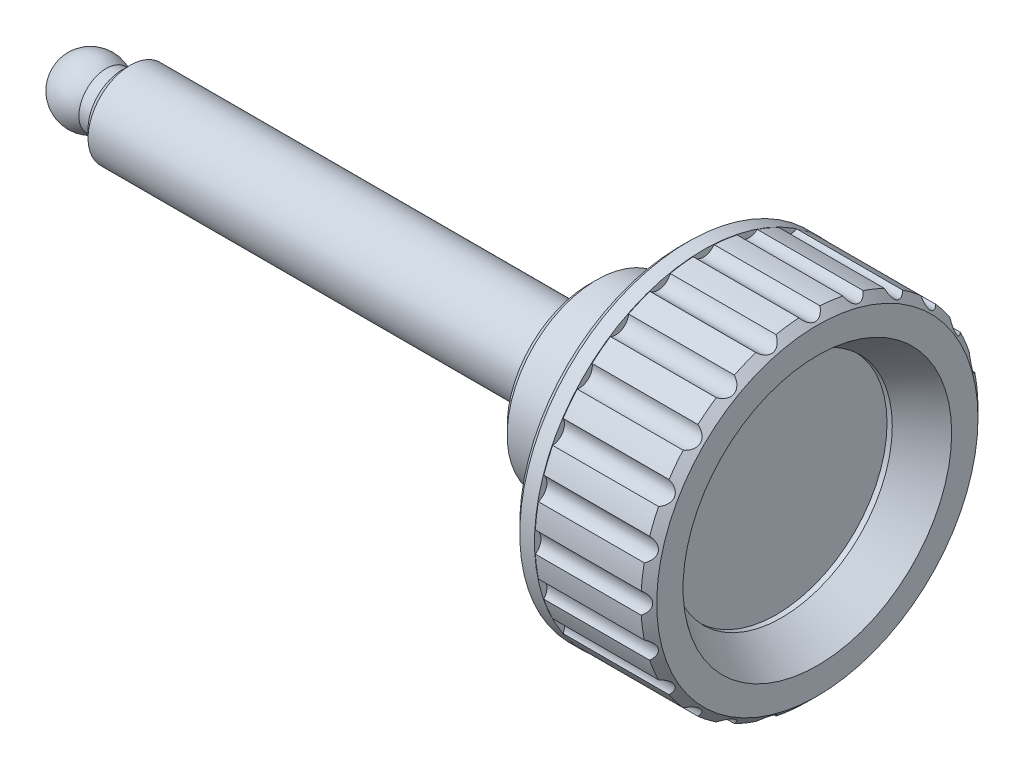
ISO-10303-21;
HEADER;
FILE_DESCRIPTION(('STEP AP214'),'2;1');
FILE_NAME('part.step','',(''),(''),'','','');
FILE_SCHEMA(('AUTOMOTIVE_DESIGN { 1 0 10303 214 1 1 1 1 }'));
ENDSEC;
DATA;
#1=APPLICATION_CONTEXT('core data for automotive mechanical design processes');
#2=APPLICATION_PROTOCOL_DEFINITION('international standard','automotive_design',2000,#1);
#3=PRODUCT_CONTEXT('',#1,'mechanical');
#4=PRODUCT('Part','Part','',(#3));
#5=PRODUCT_RELATED_PRODUCT_CATEGORY('part','',(#4));
#6=PRODUCT_DEFINITION_FORMATION('','',#4);
#7=PRODUCT_DEFINITION_CONTEXT('part definition',#1,'design');
#8=PRODUCT_DEFINITION('design','',#6,#7);
#9=PRODUCT_DEFINITION_SHAPE('','',#8);
#10=(LENGTH_UNIT() NAMED_UNIT(*) SI_UNIT(.MILLI.,.METRE.));
#11=(NAMED_UNIT(*) PLANE_ANGLE_UNIT() SI_UNIT($,.RADIAN.));
#12=(NAMED_UNIT(*) SI_UNIT($,.STERADIAN.) SOLID_ANGLE_UNIT());
#13=UNCERTAINTY_MEASURE_WITH_UNIT(LENGTH_MEASURE(1.E-05),#10,'distance_accuracy_value','');
#14=(GEOMETRIC_REPRESENTATION_CONTEXT(3) GLOBAL_UNCERTAINTY_ASSIGNED_CONTEXT((#13)) GLOBAL_UNIT_ASSIGNED_CONTEXT((#10,
#11,#12)) REPRESENTATION_CONTEXT('',''));
#15=CARTESIAN_POINT('',(0.,0.,0.));
#16=DIRECTION('',(0.,0.,1.));
#17=DIRECTION('',(1.,0.,0.));
#18=AXIS2_PLACEMENT_3D('',#15,#16,#17);
#19=CARTESIAN_POINT('',(11.2,15.3,0.));
#20=DIRECTION('',(1.,0.,0.));
#21=DIRECTION('',(0.,0.,-1.));
#22=AXIS2_PLACEMENT_3D('',#19,#20,#21);
#23=PLANE('',#22);
#24=CARTESIAN_POINT('',(11.2,16.64,0.));
#25=DIRECTION('',(1.,0.,0.));
#26=DIRECTION('',(0.,0.,-1.));
#27=AXIS2_PLACEMENT_3D('',#24,#25,#26);
#28=CIRCLE('',#27,1.2);
#29=CARTESIAN_POINT('',(11.2,15.9690384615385,0.994892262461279));
#30=VERTEX_POINT('',#29);
#31=CARTESIAN_POINT('',(11.2,15.9690384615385,-0.994892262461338));
#32=VERTEX_POINT('',#31);
#33=EDGE_CURVE('E423',#30,#32,#28,.T.);
#34=ORIENTED_EDGE('',*,*,#33,.T.);
#35=CARTESIAN_POINT('',(11.2,0.,0.));
#36=DIRECTION('',(1.,0.,0.));
#37=DIRECTION('',(0.,0.,-1.));
#38=AXIS2_PLACEMENT_3D('',#35,#36,#37);
#39=CIRCLE('',#38,16.);
#40=CARTESIAN_POINT('',(11.2,15.6824037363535,-3.17209915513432));
#41=VERTEX_POINT('',#40);
#42=EDGE_CURVE('E420',#41,#32,#39,.T.);
#43=ORIENTED_EDGE('',*,*,#42,.F.);
#44=CARTESIAN_POINT('',(11.2,16.07300574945,-4.30674891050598));
#45=DIRECTION('',(1.,0.,0.));
#46=DIRECTION('',(0.,0.,-1.));
#47=AXIS2_PLACEMENT_3D('',#44,#45,#46);
#48=CIRCLE('',#47,1.2);
#49=CARTESIAN_POINT('',(11.2,15.1674096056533,-5.09408341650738));
#50=VERTEX_POINT('',#49);
#51=EDGE_CURVE('E417',#41,#50,#48,.T.);
#52=ORIENTED_EDGE('',*,*,#51,.T.);
#53=CARTESIAN_POINT('',(11.2,6.78276879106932E-13,-2.72351585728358E-13));
#54=DIRECTION('',(1.,0.,0.));
#55=DIRECTION('',(0.,0.,-1.));
#56=AXIS2_PLACEMENT_3D('',#53,#54,#55);
#57=CIRCLE('',#56,15.9999999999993);
#58=CARTESIAN_POINT('',(11.2,14.3270391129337,-7.12291725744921));
#59=VERTEX_POINT('',#58);
#60=EDGE_CURVE('E415',#59,#50,#57,.T.);
#61=ORIENTED_EDGE('',*,*,#60,.F.);
#62=CARTESIAN_POINT('',(11.2,14.410662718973,-8.32));
#63=DIRECTION('',(1.,0.,0.));
#64=DIRECTION('',(0.,0.,-1.));
#65=AXIS2_PLACEMENT_3D('',#62,#63,#64);
#66=CIRCLE('',#65,1.2);
#67=CARTESIAN_POINT('',(11.2,13.3321468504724,-8.84612120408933));
#68=VERTEX_POINT('',#67);
#69=EDGE_CURVE('E412',#59,#68,#66,.T.);
#70=ORIENTED_EDGE('',*,*,#69,.T.);
#71=CARTESIAN_POINT('',(11.2,-4.68375338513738E-13,3.43475248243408E-13));
#72=DIRECTION('',(1.,0.,0.));
#73=DIRECTION('',(0.,0.,-1.));
#74=AXIS2_PLACEMENT_3D('',#71,#72,#73);
#75=CIRCLE('',#74,16.0000000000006);
#76=CARTESIAN_POINT('',(11.2,11.995310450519,-10.5883203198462));
#77=VERTEX_POINT('',#76);
#78=EDGE_CURVE('E410',#77,#68,#75,.T.);
#79=ORIENTED_EDGE('',*,*,#78,.F.);
#80=CARTESIAN_POINT('',(11.2,11.7662568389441,-11.7662568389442));
#81=DIRECTION('',(1.,0.,0.));
#82=DIRECTION('',(0.,0.,-1.));
#83=AXIS2_PLACEMENT_3D('',#80,#81,#82);
#84=CIRCLE('',#83,1.2);
#85=CARTESIAN_POINT('',(11.2,10.5883203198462,-11.995310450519));
#86=VERTEX_POINT('',#85);
#87=EDGE_CURVE('E407',#77,#86,#84,.T.);
#88=ORIENTED_EDGE('',*,*,#87,.T.);
#89=CARTESIAN_POINT('',(11.2,-7.07767178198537E-13,9.15933995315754E-13));
#90=DIRECTION('',(1.,0.,0.));
#91=DIRECTION('',(0.,0.,-1.));
#92=AXIS2_PLACEMENT_3D('',#89,#90,#91);
#93=CIRCLE('',#92,16.0000000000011);
#94=CARTESIAN_POINT('',(11.2,8.84612120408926,-13.3321468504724));
#95=VERTEX_POINT('',#94);
#96=EDGE_CURVE('E405',#95,#86,#93,.T.);
#97=ORIENTED_EDGE('',*,*,#96,.F.);
#98=CARTESIAN_POINT('',(11.2,8.32,-14.4106627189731));
#99=DIRECTION('',(1.,0.,0.));
#100=DIRECTION('',(0.,0.,-1.));
#101=AXIS2_PLACEMENT_3D('',#98,#99,#100);
#102=CIRCLE('',#101,1.2);
#103=CARTESIAN_POINT('',(11.2,7.12291725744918,-14.3270391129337));
#104=VERTEX_POINT('',#103);
#105=EDGE_CURVE('E402',#95,#104,#102,.T.);
#106=ORIENTED_EDGE('',*,*,#105,.T.);
#107=CARTESIAN_POINT('',(11.2,-3.23525928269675E-13,7.84095011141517E-13));
#108=DIRECTION('',(1.,0.,0.));
#109=DIRECTION('',(0.,0.,-1.));
#110=AXIS2_PLACEMENT_3D('',#107,#108,#109);
#111=CIRCLE('',#110,16.0000000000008);
#112=CARTESIAN_POINT('',(11.2,5.09408341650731,-15.1674096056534));
#113=VERTEX_POINT('',#112);
#114=EDGE_CURVE('E400',#113,#104,#111,.T.);
#115=ORIENTED_EDGE('',*,*,#114,.F.);
#116=CARTESIAN_POINT('',(11.2,4.30674891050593,-16.0730057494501));
#117=DIRECTION('',(1.,0.,0.));
#118=DIRECTION('',(0.,0.,-1.));
#119=AXIS2_PLACEMENT_3D('',#116,#117,#118);
#120=CIRCLE('',#119,1.2);
#121=CARTESIAN_POINT('',(11.2,3.17209915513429,-15.6824037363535));
#122=VERTEX_POINT('',#121);
#123=EDGE_CURVE('E397',#113,#122,#120,.T.);
#124=ORIENTED_EDGE('',*,*,#123,.T.);
#125=CARTESIAN_POINT('',(11.2,0.,0.));
#126=DIRECTION('',(1.,0.,0.));
#127=DIRECTION('',(0.,0.,-1.));
#128=AXIS2_PLACEMENT_3D('',#125,#126,#127);
#129=CIRCLE('',#128,16.);
#130=CARTESIAN_POINT('',(11.2,0.994892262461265,-15.9690384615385));
#131=VERTEX_POINT('',#130);
#132=EDGE_CURVE('E395',#131,#122,#129,.T.);
#133=ORIENTED_EDGE('',*,*,#132,.F.);
#134=CARTESIAN_POINT('',(11.2,0.,-16.64));
#135=DIRECTION('',(1.,0.,0.));
#136=DIRECTION('',(0.,0.,-1.));
#137=AXIS2_PLACEMENT_3D('',#134,#135,#136);
#138=CIRCLE('',#137,1.2);
#139=CARTESIAN_POINT('',(11.2,-0.994892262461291,-15.9690384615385));
#140=VERTEX_POINT('',#139);
#141=EDGE_CURVE('E392',#131,#140,#138,.T.);
#142=ORIENTED_EDGE('',*,*,#141,.T.);
#143=CARTESIAN_POINT('',(11.2,-1.39645239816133E-13,-1.10328413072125E-12));
#144=DIRECTION('',(1.,0.,0.));
#145=DIRECTION('',(0.,0.,-1.));
#146=AXIS2_PLACEMENT_3D('',#143,#144,#145);
#147=CIRCLE('',#146,15.9999999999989);
#148=CARTESIAN_POINT('',(11.2,-3.17209915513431,-15.6824037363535));
#149=VERTEX_POINT('',#148);
#150=EDGE_CURVE('E390',#149,#140,#147,.T.);
#151=ORIENTED_EDGE('',*,*,#150,.F.);
#152=CARTESIAN_POINT('',(11.2,-4.30674891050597,-16.07300574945));
#153=DIRECTION('',(1.,0.,0.));
#154=DIRECTION('',(0.,0.,-1.));
#155=AXIS2_PLACEMENT_3D('',#152,#153,#154);
#156=CIRCLE('',#155,1.2);
#157=CARTESIAN_POINT('',(11.2,-5.09408341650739,-15.1674096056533));
#158=VERTEX_POINT('',#157);
#159=EDGE_CURVE('E387',#149,#158,#156,.T.);
#160=ORIENTED_EDGE('',*,*,#159,.T.);
#161=CARTESIAN_POINT('',(11.2,4.2934406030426E-13,1.02522157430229E-12));
#162=DIRECTION('',(1.,0.,0.));
#163=DIRECTION('',(0.,0.,-1.));
#164=AXIS2_PLACEMENT_3D('',#161,#162,#163);
#165=CIRCLE('',#164,16.0000000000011);
#166=CARTESIAN_POINT('',(11.2,-7.1229172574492,-14.3270391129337));
#167=VERTEX_POINT('',#166);
#168=EDGE_CURVE('E385',#167,#158,#165,.T.);
#169=ORIENTED_EDGE('',*,*,#168,.F.);
#170=CARTESIAN_POINT('',(11.2,-8.32,-14.410662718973));
#171=DIRECTION('',(1.,0.,0.));
#172=DIRECTION('',(0.,0.,-1.));
#173=AXIS2_PLACEMENT_3D('',#170,#171,#172);
#174=CIRCLE('',#173,1.2);
#175=CARTESIAN_POINT('',(11.2,-8.84612120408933,-13.3321468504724));
#176=VERTEX_POINT('',#175);
#177=EDGE_CURVE('E382',#167,#176,#174,.T.);
#178=ORIENTED_EDGE('',*,*,#177,.T.);
#179=CARTESIAN_POINT('',(11.2,0.,0.));
#180=DIRECTION('',(1.,0.,0.));
#181=DIRECTION('',(0.,0.,-1.));
#182=AXIS2_PLACEMENT_3D('',#179,#180,#181);
#183=CIRCLE('',#182,16.);
#184=CARTESIAN_POINT('',(11.2,-10.5883203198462,-11.995310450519));
#185=VERTEX_POINT('',#184);
#186=EDGE_CURVE('E380',#185,#176,#183,.T.);
#187=ORIENTED_EDGE('',*,*,#186,.F.);
#188=CARTESIAN_POINT('',(11.2,-11.7662568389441,-11.7662568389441));
#189=DIRECTION('',(1.,0.,0.));
#190=DIRECTION('',(0.,0.,-1.));
#191=AXIS2_PLACEMENT_3D('',#188,#189,#190);
#192=CIRCLE('',#191,1.2);
#193=CARTESIAN_POINT('',(11.2,-11.9953104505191,-10.5883203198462));
#194=VERTEX_POINT('',#193);
#195=EDGE_CURVE('E377',#185,#194,#192,.T.);
#196=ORIENTED_EDGE('',*,*,#195,.T.);
#197=CARTESIAN_POINT('',(11.2,6.26235174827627E-13,4.54497550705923E-13));
#198=DIRECTION('',(1.,0.,0.));
#199=DIRECTION('',(0.,0.,-1.));
#200=AXIS2_PLACEMENT_3D('',#197,#198,#199);
#201=CIRCLE('',#200,16.0000000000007);
#202=CARTESIAN_POINT('',(11.2,-13.3321468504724,-8.84612120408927));
#203=VERTEX_POINT('',#202);
#204=EDGE_CURVE('E375',#203,#194,#201,.T.);
#205=ORIENTED_EDGE('',*,*,#204,.F.);
#206=CARTESIAN_POINT('',(11.2,-14.410662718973,-8.32));
#207=DIRECTION('',(1.,0.,0.));
#208=DIRECTION('',(0.,0.,-1.));
#209=AXIS2_PLACEMENT_3D('',#206,#207,#208);
#210=CIRCLE('',#209,1.2);
#211=CARTESIAN_POINT('',(11.2,-14.3270391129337,-7.12291725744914));
#212=VERTEX_POINT('',#211);
#213=EDGE_CURVE('E372',#203,#212,#210,.T.);
#214=ORIENTED_EDGE('',*,*,#213,.T.);
#215=CARTESIAN_POINT('',(11.2,8.76035355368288E-13,3.33934269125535E-13));
#216=DIRECTION('',(1.,0.,0.));
#217=DIRECTION('',(0.,0.,-1.));
#218=AXIS2_PLACEMENT_3D('',#215,#216,#217);
#219=CIRCLE('',#218,16.000000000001);
#220=CARTESIAN_POINT('',(11.2,-15.1674096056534,-5.09408341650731));
#221=VERTEX_POINT('',#220);
#222=EDGE_CURVE('E370',#221,#212,#219,.T.);
#223=ORIENTED_EDGE('',*,*,#222,.F.);
#224=CARTESIAN_POINT('',(11.2,-16.07300574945,-4.3067489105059));
#225=DIRECTION('',(1.,0.,0.));
#226=DIRECTION('',(0.,0.,-1.));
#227=AXIS2_PLACEMENT_3D('',#224,#225,#226);
#228=CIRCLE('',#227,1.2);
#229=CARTESIAN_POINT('',(11.2,-15.6824037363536,-3.17209915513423));
#230=VERTEX_POINT('',#229);
#231=EDGE_CURVE('E367',#221,#230,#228,.T.);
#232=ORIENTED_EDGE('',*,*,#231,.T.);
#233=CARTESIAN_POINT('',(11.2,-4.78783679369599E-13,0.));
#234=DIRECTION('',(1.,0.,0.));
#235=DIRECTION('',(0.,0.,-1.));
#236=AXIS2_PLACEMENT_3D('',#233,#234,#235);
#237=CIRCLE('',#236,15.9999999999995);
#238=CARTESIAN_POINT('',(11.2,-15.9690384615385,-0.994892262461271));
#239=VERTEX_POINT('',#238);
#240=EDGE_CURVE('E365',#239,#230,#237,.T.);
#241=ORIENTED_EDGE('',*,*,#240,.F.);
#242=CARTESIAN_POINT('',(11.2,-16.64,0.));
#243=DIRECTION('',(1.,0.,0.));
#244=DIRECTION('',(0.,0.,-1.));
#245=AXIS2_PLACEMENT_3D('',#242,#243,#244);
#246=CIRCLE('',#245,1.2);
#247=CARTESIAN_POINT('',(11.2,-15.9690384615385,0.994892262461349));
#248=VERTEX_POINT('',#247);
#249=EDGE_CURVE('E362',#239,#248,#246,.T.);
#250=ORIENTED_EDGE('',*,*,#249,.T.);
#251=CARTESIAN_POINT('',(11.2,7.0082828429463E-13,-1.27068494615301E-13));
#252=DIRECTION('',(1.,0.,0.));
#253=DIRECTION('',(0.,0.,-1.));
#254=AXIS2_PLACEMENT_3D('',#251,#252,#253);
#255=CIRCLE('',#254,16.0000000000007);
#256=CARTESIAN_POINT('',(11.2,-15.6824037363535,3.17209915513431));
#257=VERTEX_POINT('',#256);
#258=EDGE_CURVE('E360',#257,#248,#255,.T.);
#259=ORIENTED_EDGE('',*,*,#258,.F.);
#260=CARTESIAN_POINT('',(11.2,-16.07300574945,4.30674891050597));
#261=DIRECTION('',(1.,0.,0.));
#262=DIRECTION('',(0.,0.,-1.));
#263=AXIS2_PLACEMENT_3D('',#260,#261,#262);
#264=CIRCLE('',#263,1.2);
#265=CARTESIAN_POINT('',(11.2,-15.1674096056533,5.09408341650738));
#266=VERTEX_POINT('',#265);
#267=EDGE_CURVE('E357',#257,#266,#264,.T.);
#268=ORIENTED_EDGE('',*,*,#267,.T.);
#269=CARTESIAN_POINT('',(11.2,0.,0.));
#270=DIRECTION('',(1.,0.,0.));
#271=DIRECTION('',(0.,0.,-1.));
#272=AXIS2_PLACEMENT_3D('',#269,#270,#271);
#273=CIRCLE('',#272,16.);
#274=CARTESIAN_POINT('',(11.2,-14.3270391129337,7.1229172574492));
#275=VERTEX_POINT('',#274);
#276=EDGE_CURVE('E355',#275,#266,#273,.T.);
#277=ORIENTED_EDGE('',*,*,#276,.F.);
#278=CARTESIAN_POINT('',(11.2,-14.410662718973,8.32));
#279=DIRECTION('',(1.,0.,0.));
#280=DIRECTION('',(0.,0.,-1.));
#281=AXIS2_PLACEMENT_3D('',#278,#279,#280);
#282=CIRCLE('',#281,1.2);
#283=CARTESIAN_POINT('',(11.2,-13.3321468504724,8.84612120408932));
#284=VERTEX_POINT('',#283);
#285=EDGE_CURVE('E352',#275,#284,#282,.T.);
#286=ORIENTED_EDGE('',*,*,#285,.T.);
#287=CARTESIAN_POINT('',(11.2,-1.83880688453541E-13,1.17961196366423E-13));
#288=DIRECTION('',(1.,0.,0.));
#289=DIRECTION('',(0.,0.,-1.));
#290=AXIS2_PLACEMENT_3D('',#287,#288,#289);
#291=CIRCLE('',#290,16.);
#292=CARTESIAN_POINT('',(11.2,-11.995310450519,10.5883203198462));
#293=VERTEX_POINT('',#292);
#294=EDGE_CURVE('E350',#293,#284,#291,.T.);
#295=ORIENTED_EDGE('',*,*,#294,.F.);
#296=CARTESIAN_POINT('',(11.2,-11.7662568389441,11.7662568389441));
#297=DIRECTION('',(1.,0.,0.));
#298=DIRECTION('',(0.,0.,-1.));
#299=AXIS2_PLACEMENT_3D('',#296,#297,#298);
#300=CIRCLE('',#299,1.2);
#301=CARTESIAN_POINT('',(11.2,-10.5883203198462,11.9953104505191));
#302=VERTEX_POINT('',#301);
#303=EDGE_CURVE('E347',#293,#302,#300,.T.);
#304=ORIENTED_EDGE('',*,*,#303,.T.);
#305=CARTESIAN_POINT('',(11.2,-2.4459601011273E-13,3.43475248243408E-13));
#306=DIRECTION('',(1.,0.,0.));
#307=DIRECTION('',(0.,0.,-1.));
#308=AXIS2_PLACEMENT_3D('',#305,#306,#307);
#309=CIRCLE('',#308,15.9999999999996);
#310=CARTESIAN_POINT('',(11.2,-8.84612120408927,13.3321468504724));
#311=VERTEX_POINT('',#310);
#312=EDGE_CURVE('E345',#311,#302,#309,.T.);
#313=ORIENTED_EDGE('',*,*,#312,.F.);
#314=CARTESIAN_POINT('',(11.2,-8.32,14.4106627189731));
#315=DIRECTION('',(1.,0.,0.));
#316=DIRECTION('',(0.,0.,-1.));
#317=AXIS2_PLACEMENT_3D('',#314,#315,#316);
#318=CIRCLE('',#317,1.2);
#319=CARTESIAN_POINT('',(11.2,-7.12291725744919,14.3270391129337));
#320=VERTEX_POINT('',#319);
#321=EDGE_CURVE('E342',#311,#320,#318,.T.);
#322=ORIENTED_EDGE('',*,*,#321,.T.);
#323=CARTESIAN_POINT('',(11.2,-1.20563281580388E-13,2.8275992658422E-13));
#324=DIRECTION('',(1.,0.,0.));
#325=DIRECTION('',(0.,0.,-1.));
#326=AXIS2_PLACEMENT_3D('',#323,#324,#325);
#327=CIRCLE('',#326,15.9999999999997);
#328=CARTESIAN_POINT('',(11.2,-5.09408341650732,15.1674096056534));
#329=VERTEX_POINT('',#328);
#330=EDGE_CURVE('E338',#329,#320,#327,.T.);
#331=ORIENTED_EDGE('',*,*,#330,.F.);
#332=CARTESIAN_POINT('',(11.2,-4.30674891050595,16.0730057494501));
#333=DIRECTION('',(1.,0.,0.));
#334=DIRECTION('',(0.,0.,-1.));
#335=AXIS2_PLACEMENT_3D('',#332,#333,#334);
#336=CIRCLE('',#335,1.2);
#337=CARTESIAN_POINT('',(11.2,-3.1720991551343,15.6824037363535));
#338=VERTEX_POINT('',#337);
#339=EDGE_CURVE('E336',#329,#338,#336,.T.);
#340=ORIENTED_EDGE('',*,*,#339,.T.);
#341=CARTESIAN_POINT('',(11.2,-1.42897846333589E-13,1.03389519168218E-12));
#342=DIRECTION('',(1.,0.,0.));
#343=DIRECTION('',(0.,0.,-1.));
#344=AXIS2_PLACEMENT_3D('',#341,#342,#343);
#345=CIRCLE('',#344,15.9999999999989);
#346=CARTESIAN_POINT('',(11.2,-0.994892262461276,15.9690384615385));
#347=VERTEX_POINT('',#346);
#348=EDGE_CURVE('E321',#347,#338,#345,.T.);
#349=ORIENTED_EDGE('',*,*,#348,.F.);
#350=CARTESIAN_POINT('',(11.2,0.,16.64));
#351=DIRECTION('',(1.,0.,0.));
#352=DIRECTION('',(0.,0.,-1.));
#353=AXIS2_PLACEMENT_3D('',#350,#351,#352);
#354=CIRCLE('',#353,1.2);
#355=CARTESIAN_POINT('',(11.2,0.994892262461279,15.9690384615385));
#356=VERTEX_POINT('',#355);
#357=EDGE_CURVE('E316',#347,#356,#354,.T.);
#358=ORIENTED_EDGE('',*,*,#357,.T.);
#359=CARTESIAN_POINT('',(11.2,0.,7.94503351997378E-13));
#360=DIRECTION('',(1.,0.,0.));
#361=DIRECTION('',(0.,0.,-1.));
#362=AXIS2_PLACEMENT_3D('',#359,#360,#361);
#363=CIRCLE('',#362,15.9999999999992);
#364=CARTESIAN_POINT('',(11.2,3.17209915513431,15.6824037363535));
#365=VERTEX_POINT('',#364);
#366=EDGE_CURVE('E450',#365,#356,#363,.T.);
#367=ORIENTED_EDGE('',*,*,#366,.F.);
#368=CARTESIAN_POINT('',(11.2,4.30674891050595,16.0730057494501));
#369=DIRECTION('',(1.,0.,0.));
#370=DIRECTION('',(0.,0.,-1.));
#371=AXIS2_PLACEMENT_3D('',#368,#369,#370);
#372=CIRCLE('',#371,1.2);
#373=CARTESIAN_POINT('',(11.2,5.09408341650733,15.1674096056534));
#374=VERTEX_POINT('',#373);
#375=EDGE_CURVE('E447',#365,#374,#372,.T.);
#376=ORIENTED_EDGE('',*,*,#375,.T.);
#377=CARTESIAN_POINT('',(11.2,-1.74339709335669E-13,-3.78169717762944E-13));
#378=DIRECTION('',(1.,0.,0.));
#379=DIRECTION('',(0.,0.,-1.));
#380=AXIS2_PLACEMENT_3D('',#377,#378,#379);
#381=CIRCLE('',#380,16.0000000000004);
#382=CARTESIAN_POINT('',(11.2,7.12291725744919,14.3270391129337));
#383=VERTEX_POINT('',#382);
#384=EDGE_CURVE('E445',#383,#374,#381,.T.);
#385=ORIENTED_EDGE('',*,*,#384,.F.);
#386=CARTESIAN_POINT('',(11.2,8.32,14.4106627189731));
#387=DIRECTION('',(1.,0.,0.));
#388=DIRECTION('',(0.,0.,-1.));
#389=AXIS2_PLACEMENT_3D('',#386,#387,#388);
#390=CIRCLE('',#389,1.2);
#391=CARTESIAN_POINT('',(11.2,8.84612120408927,13.3321468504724));
#392=VERTEX_POINT('',#391);
#393=EDGE_CURVE('E442',#383,#392,#390,.T.);
#394=ORIENTED_EDGE('',*,*,#393,.T.);
#395=CARTESIAN_POINT('',(11.2,-2.98372437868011E-13,-3.81639164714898E-13));
#396=DIRECTION('',(1.,0.,0.));
#397=DIRECTION('',(0.,0.,-1.));
#398=AXIS2_PLACEMENT_3D('',#395,#396,#397);
#399=CIRCLE('',#398,16.0000000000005);
#400=CARTESIAN_POINT('',(11.2,10.5883203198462,11.995310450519));
#401=VERTEX_POINT('',#400);
#402=EDGE_CURVE('E440',#401,#392,#399,.T.);
#403=ORIENTED_EDGE('',*,*,#402,.F.);
#404=CARTESIAN_POINT('',(11.2,11.7662568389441,11.7662568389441));
#405=DIRECTION('',(1.,0.,0.));
#406=DIRECTION('',(0.,0.,-1.));
#407=AXIS2_PLACEMENT_3D('',#404,#405,#406);
#408=CIRCLE('',#407,1.2);
#409=CARTESIAN_POINT('',(11.2,11.995310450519,10.5883203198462));
#410=VERTEX_POINT('',#409);
#411=EDGE_CURVE('E437',#401,#410,#408,.T.);
#412=ORIENTED_EDGE('',*,*,#411,.T.);
#413=CARTESIAN_POINT('',(11.2,-4.19803081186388E-13,-3.26128013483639E-13));
#414=DIRECTION('',(1.,0.,0.));
#415=DIRECTION('',(0.,0.,-1.));
#416=AXIS2_PLACEMENT_3D('',#413,#414,#415);
#417=CIRCLE('',#416,16.0000000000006);
#418=CARTESIAN_POINT('',(11.2,13.3321468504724,8.84612120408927));
#419=VERTEX_POINT('',#418);
#420=EDGE_CURVE('E435',#419,#410,#417,.T.);
#421=ORIENTED_EDGE('',*,*,#420,.F.);
#422=CARTESIAN_POINT('',(11.2,14.4106627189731,8.32));
#423=DIRECTION('',(1.,0.,0.));
#424=DIRECTION('',(0.,0.,-1.));
#425=AXIS2_PLACEMENT_3D('',#422,#423,#424);
#426=CIRCLE('',#425,1.2);
#427=CARTESIAN_POINT('',(11.2,14.3270391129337,7.12291725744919));
#428=VERTEX_POINT('',#427);
#429=EDGE_CURVE('E432',#419,#428,#426,.T.);
#430=ORIENTED_EDGE('',*,*,#429,.T.);
#431=CARTESIAN_POINT('',(11.2,-2.63677968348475E-13,-1.07552855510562E-13));
#432=DIRECTION('',(1.,0.,0.));
#433=DIRECTION('',(0.,0.,-1.));
#434=AXIS2_PLACEMENT_3D('',#431,#432,#433);
#435=CIRCLE('',#434,16.0000000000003);
#436=CARTESIAN_POINT('',(11.2,15.1674096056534,5.09408341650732));
#437=VERTEX_POINT('',#436);
#438=EDGE_CURVE('E430',#437,#428,#435,.T.);
#439=ORIENTED_EDGE('',*,*,#438,.F.);
#440=CARTESIAN_POINT('',(11.2,16.07300574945,4.30674891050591));
#441=DIRECTION('',(1.,0.,0.));
#442=DIRECTION('',(0.,0.,-1.));
#443=AXIS2_PLACEMENT_3D('',#440,#441,#442);
#444=CIRCLE('',#443,1.2);
#445=CARTESIAN_POINT('',(11.2,15.6824037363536,3.17209915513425));
#446=VERTEX_POINT('',#445);
#447=EDGE_CURVE('E427',#437,#446,#444,.T.);
#448=ORIENTED_EDGE('',*,*,#447,.T.);
#449=CARTESIAN_POINT('',(11.2,-6.31439345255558E-13,0.));
#450=DIRECTION('',(1.,0.,0.));
#451=DIRECTION('',(0.,0.,-1.));
#452=AXIS2_PLACEMENT_3D('',#449,#450,#451);
#453=CIRCLE('',#452,16.0000000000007);
#454=EDGE_CURVE('E425',#30,#446,#453,.T.);
#455=ORIENTED_EDGE('',*,*,#454,.F.);
#456=EDGE_LOOP('',(#34,#43,#52,#61,#70,#79,#88,#97,#106,#115,#124,#133,#142,#151,#160,#169,#178,
#187,#196,#205,#214,#223,#232,#241,#250,#259,#268,#277,#286,#295,#304,#313,#322,#331,#340,#349,
#358,#367,#376,#385,#394,#403,#412,#421,#430,#439,#448,#455));
#457=FACE_BOUND('',#456,.T.);
#458=CARTESIAN_POINT('',(11.2,0.,0.));
#459=DIRECTION('',(1.,0.,0.));
#460=DIRECTION('',(0.,0.,-1.));
#461=AXIS2_PLACEMENT_3D('',#458,#459,#460);
#462=CIRCLE('',#461,15.3);
#463=CARTESIAN_POINT('',(11.2,0.,-15.3));
#464=VERTEX_POINT('',#463);
#465=EDGE_CURVE('E464',#464,#464,#462,.T.);
#466=ORIENTED_EDGE('',*,*,#465,.T.);
#467=EDGE_LOOP('',(#466));
#468=FACE_BOUND('',#467,.T.);
#469=ADVANCED_FACE('F14',(#457,#468),#23,.F.);
#470=CARTESIAN_POINT('',(0.,0.,0.));
#471=DIRECTION('',(1.,0.,0.));
#472=DIRECTION('',(0.,0.,-1.));
#473=AXIS2_PLACEMENT_3D('',#470,#471,#472);
#474=PLANE('',#473);
#475=CARTESIAN_POINT('',(0.,0.,0.));
#476=DIRECTION('',(1.,0.,0.));
#477=DIRECTION('',(0.,0.,-1.));
#478=AXIS2_PLACEMENT_3D('',#475,#476,#477);
#479=CIRCLE('',#478,4.70588235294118);
#480=CARTESIAN_POINT('',(0.,0.,-4.70588235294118));
#481=VERTEX_POINT('',#480);
#482=EDGE_CURVE('E503',#481,#481,#479,.T.);
#483=ORIENTED_EDGE('',*,*,#482,.F.);
#484=EDGE_LOOP('',(#483));
#485=FACE_BOUND('',#484,.T.);
#486=CARTESIAN_POINT('',(0.,0.,0.));
#487=DIRECTION('',(1.,0.,0.));
#488=DIRECTION('',(0.,0.,-1.));
#489=AXIS2_PLACEMENT_3D('',#486,#487,#488);
#490=CIRCLE('',#489,4.);
#491=CARTESIAN_POINT('',(0.,0.,-4.));
#492=VERTEX_POINT('',#491);
#493=EDGE_CURVE('E9',#492,#492,#490,.F.);
#494=ORIENTED_EDGE('',*,*,#493,.F.);
#495=EDGE_LOOP('',(#494));
#496=FACE_BOUND('',#495,.T.);
#497=ADVANCED_FACE('F16',(#485,#496),#474,.F.);
#498=CARTESIAN_POINT('',(22.,0.,0.));
#499=DIRECTION('',(1.,0.,0.));
#500=DIRECTION('',(0.,0.,-1.));
#501=AXIS2_PLACEMENT_3D('',#498,#499,#500);
#502=CYLINDRICAL_SURFACE('',#501,4.70588235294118);
#503=CARTESIAN_POINT('',(0.3,0.,0.));
#504=DIRECTION('',(1.,0.,0.));
#505=DIRECTION('',(0.,0.,-1.));
#506=AXIS2_PLACEMENT_3D('',#503,#504,#505);
#507=CIRCLE('',#506,4.70588235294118);
#508=CARTESIAN_POINT('',(0.3,0.,-4.70588235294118));
#509=VERTEX_POINT('',#508);
#510=EDGE_CURVE('E500',#509,#509,#507,.T.);
#511=ORIENTED_EDGE('',*,*,#510,.F.);
#512=EDGE_LOOP('',(#511));
#513=FACE_BOUND('',#512,.T.);
#514=ORIENTED_EDGE('',*,*,#482,.T.);
#515=EDGE_LOOP('',(#514));
#516=FACE_BOUND('',#515,.T.);
#517=ADVANCED_FACE('F550',(#513,#516),#502,.T.);
#518=CARTESIAN_POINT('',(0.3,4.70588235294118,0.));
#519=DIRECTION('',(1.,0.,0.));
#520=DIRECTION('',(0.,0.,-1.));
#521=AXIS2_PLACEMENT_3D('',#518,#519,#520);
#522=PLANE('',#521);
#523=CARTESIAN_POINT('',(0.3,0.,0.));
#524=DIRECTION('',(1.,0.,0.));
#525=DIRECTION('',(0.,0.,-1.));
#526=AXIS2_PLACEMENT_3D('',#523,#524,#525);
#527=CIRCLE('',#526,7.75);
#528=CARTESIAN_POINT('',(0.3,0.,-7.75));
#529=VERTEX_POINT('',#528);
#530=EDGE_CURVE('E497',#529,#529,#527,.T.);
#531=ORIENTED_EDGE('',*,*,#530,.F.);
#532=EDGE_LOOP('',(#531));
#533=FACE_BOUND('',#532,.T.);
#534=ORIENTED_EDGE('',*,*,#510,.T.);
#535=EDGE_LOOP('',(#534));
#536=FACE_BOUND('',#535,.T.);
#537=ADVANCED_FACE('F597',(#533,#536),#522,.F.);
#538=CARTESIAN_POINT('',(0.3,0.,0.));
#539=DIRECTION('',(1.,0.,0.));
#540=DIRECTION('',(0.,0.,-1.));
#541=AXIS2_PLACEMENT_3D('',#538,#539,#540);
#542=CONICAL_SURFACE('',#541,7.75,0.78539816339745);
#543=CARTESIAN_POINT('',(1.05,0.,0.));
#544=DIRECTION('',(1.,0.,0.));
#545=DIRECTION('',(0.,0.,-1.));
#546=AXIS2_PLACEMENT_3D('',#543,#544,#545);
#547=CIRCLE('',#546,8.5);
#548=CARTESIAN_POINT('',(1.05,0.,-8.5));
#549=VERTEX_POINT('',#548);
#550=EDGE_CURVE('E494',#549,#549,#547,.T.);
#551=ORIENTED_EDGE('',*,*,#550,.F.);
#552=EDGE_LOOP('',(#551));
#553=FACE_BOUND('',#552,.T.);
#554=ORIENTED_EDGE('',*,*,#530,.T.);
#555=EDGE_LOOP('',(#554));
#556=FACE_BOUND('',#555,.T.);
#557=ADVANCED_FACE('F593',(#553,#556),#542,.T.);
#558=CARTESIAN_POINT('',(22.,0.,0.));
#559=DIRECTION('',(1.,0.,0.));
#560=DIRECTION('',(0.,0.,-1.));
#561=AXIS2_PLACEMENT_3D('',#558,#559,#560);
#562=CYLINDRICAL_SURFACE('',#561,8.5);
#563=CARTESIAN_POINT('',(9.,0.,0.));
#564=DIRECTION('',(1.,0.,0.));
#565=DIRECTION('',(0.,0.,-1.));
#566=AXIS2_PLACEMENT_3D('',#563,#564,#565);
#567=CIRCLE('',#566,8.5);
#568=CARTESIAN_POINT('',(9.,0.,-8.5));
#569=VERTEX_POINT('',#568);
#570=EDGE_CURVE('E491',#569,#569,#567,.T.);
#571=ORIENTED_EDGE('',*,*,#570,.F.);
#572=EDGE_LOOP('',(#571));
#573=FACE_BOUND('',#572,.T.);
#574=ORIENTED_EDGE('',*,*,#550,.T.);
#575=EDGE_LOOP('',(#574));
#576=FACE_BOUND('',#575,.T.);
#577=ADVANCED_FACE('F589',(#573,#576),#562,.T.);
#578=CARTESIAN_POINT('',(9.,8.5,0.));
#579=DIRECTION('',(1.,0.,0.));
#580=DIRECTION('',(0.,0.,-1.));
#581=AXIS2_PLACEMENT_3D('',#578,#579,#580);
#582=PLANE('',#581);
#583=CARTESIAN_POINT('',(9.,0.,0.));
#584=DIRECTION('',(1.,0.,0.));
#585=DIRECTION('',(0.,0.,-1.));
#586=AXIS2_PLACEMENT_3D('',#583,#584,#585);
#587=CIRCLE('',#586,9.44444444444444);
#588=CARTESIAN_POINT('',(9.,0.,-9.44444444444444));
#589=VERTEX_POINT('',#588);
#590=EDGE_CURVE('E488',#589,#589,#587,.T.);
#591=ORIENTED_EDGE('',*,*,#590,.F.);
#592=EDGE_LOOP('',(#591));
#593=FACE_BOUND('',#592,.T.);
#594=ORIENTED_EDGE('',*,*,#570,.T.);
#595=EDGE_LOOP('',(#594));
#596=FACE_BOUND('',#595,.T.);
#597=ADVANCED_FACE('F585',(#593,#596),#582,.F.);
#598=CARTESIAN_POINT('',(22.,0.,0.));
#599=DIRECTION('',(1.,0.,0.));
#600=DIRECTION('',(0.,0.,-1.));
#601=AXIS2_PLACEMENT_3D('',#598,#599,#600);
#602=CYLINDRICAL_SURFACE('',#601,9.44444444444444);
#603=CARTESIAN_POINT('',(15.5,0.,0.));
#604=DIRECTION('',(1.,0.,0.));
#605=DIRECTION('',(0.,0.,-1.));
#606=AXIS2_PLACEMENT_3D('',#603,#604,#605);
#607=CIRCLE('',#606,9.44444444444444);
#608=CARTESIAN_POINT('',(15.5,0.,-9.44444444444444));
#609=VERTEX_POINT('',#608);
#610=EDGE_CURVE('E485',#609,#609,#607,.T.);
#611=ORIENTED_EDGE('',*,*,#610,.F.);
#612=EDGE_LOOP('',(#611));
#613=FACE_BOUND('',#612,.T.);
#614=ORIENTED_EDGE('',*,*,#590,.T.);
#615=EDGE_LOOP('',(#614));
#616=FACE_BOUND('',#615,.T.);
#617=ADVANCED_FACE('F581',(#613,#616),#602,.T.);
#618=CARTESIAN_POINT('',(15.5,9.44444444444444,0.));
#619=DIRECTION('',(1.,0.,0.));
#620=DIRECTION('',(0.,0.,-1.));
#621=AXIS2_PLACEMENT_3D('',#618,#619,#620);
#622=PLANE('',#621);
#623=CARTESIAN_POINT('',(15.5,0.,0.));
#624=DIRECTION('',(1.,0.,0.));
#625=DIRECTION('',(0.,0.,-1.));
#626=AXIS2_PLACEMENT_3D('',#623,#624,#625);
#627=CIRCLE('',#626,13.9130434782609);
#628=CARTESIAN_POINT('',(15.5,0.,-13.9130434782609));
#629=VERTEX_POINT('',#628);
#630=EDGE_CURVE('E482',#629,#629,#627,.T.);
#631=ORIENTED_EDGE('',*,*,#630,.F.);
#632=EDGE_LOOP('',(#631));
#633=FACE_BOUND('',#632,.T.);
#634=ORIENTED_EDGE('',*,*,#610,.T.);
#635=EDGE_LOOP('',(#634));
#636=FACE_BOUND('',#635,.T.);
#637=ADVANCED_FACE('F577',(#633,#636),#622,.F.);
#638=CARTESIAN_POINT('',(22.,0.,0.));
#639=DIRECTION('',(1.,0.,0.));
#640=DIRECTION('',(0.,0.,-1.));
#641=AXIS2_PLACEMENT_3D('',#638,#639,#640);
#642=CYLINDRICAL_SURFACE('',#641,13.9130434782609);
#643=CARTESIAN_POINT('',(9.,0.,0.));
#644=DIRECTION('',(1.,0.,0.));
#645=DIRECTION('',(0.,0.,-1.));
#646=AXIS2_PLACEMENT_3D('',#643,#644,#645);
#647=CIRCLE('',#646,13.9130434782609);
#648=CARTESIAN_POINT('',(9.,0.,-13.9130434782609));
#649=VERTEX_POINT('',#648);
#650=EDGE_CURVE('E479',#649,#649,#647,.T.);
#651=ORIENTED_EDGE('',*,*,#650,.F.);
#652=EDGE_LOOP('',(#651));
#653=FACE_BOUND('',#652,.T.);
#654=ORIENTED_EDGE('',*,*,#630,.T.);
#655=EDGE_LOOP('',(#654));
#656=FACE_BOUND('',#655,.T.);
#657=ADVANCED_FACE('F573',(#653,#656),#642,.F.);
#658=CARTESIAN_POINT('',(9.,13.9130434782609,0.));
#659=DIRECTION('',(1.,0.,0.));
#660=DIRECTION('',(0.,0.,-1.));
#661=AXIS2_PLACEMENT_3D('',#658,#659,#660);
#662=PLANE('',#661);
#663=CARTESIAN_POINT('',(9.,0.,0.));
#664=DIRECTION('',(1.,0.,0.));
#665=DIRECTION('',(0.,0.,-1.));
#666=AXIS2_PLACEMENT_3D('',#663,#664,#665);
#667=CIRCLE('',#666,15.25);
#668=CARTESIAN_POINT('',(9.,0.,-15.25));
#669=VERTEX_POINT('',#668);
#670=EDGE_CURVE('E476',#669,#669,#667,.T.);
#671=ORIENTED_EDGE('',*,*,#670,.F.);
#672=EDGE_LOOP('',(#671));
#673=FACE_BOUND('',#672,.T.);
#674=ORIENTED_EDGE('',*,*,#650,.T.);
#675=EDGE_LOOP('',(#674));
#676=FACE_BOUND('',#675,.T.);
#677=ADVANCED_FACE('F569',(#673,#676),#662,.F.);
#678=CARTESIAN_POINT('',(9.,0.,0.));
#679=DIRECTION('',(1.,0.,0.));
#680=DIRECTION('',(0.,0.,-1.));
#681=AXIS2_PLACEMENT_3D('',#678,#679,#680);
#682=CONICAL_SURFACE('',#681,15.25,0.785398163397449);
#683=CARTESIAN_POINT('',(9.75,0.,0.));
#684=DIRECTION('',(1.,0.,0.));
#685=DIRECTION('',(0.,0.,-1.));
#686=AXIS2_PLACEMENT_3D('',#683,#684,#685);
#687=CIRCLE('',#686,16.);
#688=CARTESIAN_POINT('',(9.75,0.,-16.));
#689=VERTEX_POINT('',#688);
#690=EDGE_CURVE('E473',#689,#689,#687,.T.);
#691=ORIENTED_EDGE('',*,*,#690,.F.);
#692=EDGE_LOOP('',(#691));
#693=FACE_BOUND('',#692,.T.);
#694=ORIENTED_EDGE('',*,*,#670,.T.);
#695=EDGE_LOOP('',(#694));
#696=FACE_BOUND('',#695,.T.);
#697=ADVANCED_FACE('F565',(#693,#696),#682,.T.);
#698=CARTESIAN_POINT('',(22.,0.,0.));
#699=DIRECTION('',(1.,0.,0.));
#700=DIRECTION('',(0.,0.,-1.));
#701=AXIS2_PLACEMENT_3D('',#698,#699,#700);
#702=CYLINDRICAL_SURFACE('',#701,16.);
#703=CARTESIAN_POINT('',(11.15,0.,0.));
#704=DIRECTION('',(1.,0.,0.));
#705=DIRECTION('',(0.,0.,-1.));
#706=AXIS2_PLACEMENT_3D('',#703,#704,#705);
#707=CIRCLE('',#706,16.);
#708=CARTESIAN_POINT('',(11.15,0.,-16.));
#709=VERTEX_POINT('',#708);
#710=EDGE_CURVE('E470',#709,#709,#707,.T.);
#711=ORIENTED_EDGE('',*,*,#710,.F.);
#712=EDGE_LOOP('',(#711));
#713=FACE_BOUND('',#712,.T.);
#714=ORIENTED_EDGE('',*,*,#690,.T.);
#715=EDGE_LOOP('',(#714));
#716=FACE_BOUND('',#715,.T.);
#717=ADVANCED_FACE('F561',(#713,#716),#702,.T.);
#718=CARTESIAN_POINT('',(11.15,16.,0.));
#719=DIRECTION('',(-1.,0.,0.));
#720=DIRECTION('',(0.,0.,1.));
#721=AXIS2_PLACEMENT_3D('',#718,#719,#720);
#722=PLANE('',#721);
#723=CARTESIAN_POINT('',(11.15,0.,0.));
#724=DIRECTION('',(1.,0.,0.));
#725=DIRECTION('',(0.,0.,-1.));
#726=AXIS2_PLACEMENT_3D('',#723,#724,#725);
#727=CIRCLE('',#726,15.3);
#728=CARTESIAN_POINT('',(11.15,0.,-15.3));
#729=VERTEX_POINT('',#728);
#730=EDGE_CURVE('E467',#729,#729,#727,.T.);
#731=ORIENTED_EDGE('',*,*,#730,.F.);
#732=EDGE_LOOP('',(#731));
#733=FACE_BOUND('',#732,.T.);
#734=ORIENTED_EDGE('',*,*,#710,.T.);
#735=EDGE_LOOP('',(#734));
#736=FACE_BOUND('',#735,.T.);
#737=ADVANCED_FACE('F557',(#733,#736),#722,.F.);
#738=CARTESIAN_POINT('',(22.,0.,0.));
#739=DIRECTION('',(1.,0.,0.));
#740=DIRECTION('',(0.,0.,-1.));
#741=AXIS2_PLACEMENT_3D('',#738,#739,#740);
#742=CYLINDRICAL_SURFACE('',#741,15.3);
#743=ORIENTED_EDGE('',*,*,#465,.F.);
#744=EDGE_LOOP('',(#743));
#745=FACE_BOUND('',#744,.T.);
#746=ORIENTED_EDGE('',*,*,#730,.T.);
#747=EDGE_LOOP('',(#746));
#748=FACE_BOUND('',#747,.T.);
#749=ADVANCED_FACE('F553',(#745,#748),#742,.T.);
#750=CARTESIAN_POINT('',(11.199,0.,7.94503351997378E-13));
#751=DIRECTION('',(1.,0.,0.));
#752=DIRECTION('',(0.,0.,-1.));
#753=AXIS2_PLACEMENT_3D('',#750,#751,#752);
#754=CYLINDRICAL_SURFACE('',#753,15.9999999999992);
#755=ORIENTED_EDGE('',*,*,#366,.T.);
#756=DIRECTION('',(1.,0.,0.));
#757=VECTOR('',#756,1.);
#758=CARTESIAN_POINT('',(11.199,0.994892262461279,15.9690384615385));
#759=LINE('',#758,#757);
#760=CARTESIAN_POINT('',(21.25,0.994892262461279,15.9690384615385));
#761=VERTEX_POINT('',#760);
#762=EDGE_CURVE('E29',#356,#761,#759,.T.);
#763=ORIENTED_EDGE('',*,*,#762,.T.);
#764=CARTESIAN_POINT('',(21.2500000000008,0.,0.));
#765=DIRECTION('',(-1.,0.,0.));
#766=DIRECTION('',(0.,0.,1.));
#767=AXIS2_PLACEMENT_3D('',#764,#765,#766);
#768=CIRCLE('',#767,15.9999999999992);
#769=CARTESIAN_POINT('',(21.25,3.17209915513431,15.6824037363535));
#770=VERTEX_POINT('',#769);
#771=EDGE_CURVE('E768',#761,#770,#768,.T.);
#772=ORIENTED_EDGE('',*,*,#771,.T.);
#773=DIRECTION('',(1.,0.,0.));
#774=VECTOR('',#773,1.);
#775=CARTESIAN_POINT('',(11.199,3.17209915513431,15.6824037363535));
#776=LINE('',#775,#774);
#777=EDGE_CURVE('E322',#365,#770,#776,.T.);
#778=ORIENTED_EDGE('',*,*,#777,.F.);
#779=EDGE_LOOP('',(#755,#763,#772,#778));
#780=FACE_BOUND('',#779,.T.);
#781=ADVANCED_FACE('F556',(#780),#754,.T.);
#782=CARTESIAN_POINT('',(11.199,4.30674891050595,16.0730057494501));
#783=DIRECTION('',(1.,0.,0.));
#784=DIRECTION('',(0.,0.,-1.));
#785=AXIS2_PLACEMENT_3D('',#782,#783,#784);
#786=CYLINDRICAL_SURFACE('',#785,1.2);
#787=ORIENTED_EDGE('',*,*,#777,.T.);
#788=CARTESIAN_POINT('',(21.249771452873,5.09428341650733,15.167583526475));
#789=CARTESIAN_POINT('',(21.28283782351,5.06533887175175,15.1424210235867));
#790=CARTESIAN_POINT('',(21.3153818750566,5.03482366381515,15.1183044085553));
#791=CARTESIAN_POINT('',(21.3791366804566,4.97045656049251,15.0724726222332));
#792=CARTESIAN_POINT('',(21.4103416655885,4.93659197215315,15.0507673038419));
#793=CARTESIAN_POINT('',(21.471267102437,4.8650827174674,15.0100017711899));
#794=CARTESIAN_POINT('',(21.5009620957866,4.82739352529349,14.9909808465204));
#795=CARTESIAN_POINT('',(21.5577621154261,4.74867597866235,14.9565184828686));
#796=CARTESIAN_POINT('',(21.5848717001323,4.70765374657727,14.9410706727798));
#797=CARTESIAN_POINT('',(21.6384000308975,4.61796199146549,14.9130184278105));
#798=CARTESIAN_POINT('',(21.6644707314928,4.56893874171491,14.9008604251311));
#799=CARTESIAN_POINT('',(21.7112855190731,4.46750595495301,14.8827125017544));
#800=CARTESIAN_POINT('',(21.7320499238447,4.41511032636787,14.8766987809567));
#801=CARTESIAN_POINT('',(21.7671615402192,4.30710893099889,14.871776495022));
#802=CARTESIAN_POINT('',(21.7814284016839,4.25147208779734,14.8729544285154));
#803=CARTESIAN_POINT('',(21.801780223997,4.13943007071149,14.8834020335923));
#804=CARTESIAN_POINT('',(21.8078710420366,4.08302547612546,14.8926659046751));
#805=CARTESIAN_POINT('',(21.8109503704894,3.98000815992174,14.9173113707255));
#806=CARTESIAN_POINT('',(21.8091352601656,3.933165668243,14.9316055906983));
#807=CARTESIAN_POINT('',(21.7992144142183,3.84216282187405,14.9655234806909));
#808=CARTESIAN_POINT('',(21.7911082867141,3.79800263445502,14.9851474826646));
#809=CARTESIAN_POINT('',(21.7697036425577,3.71522670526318,15.0279287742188));
#810=CARTESIAN_POINT('',(21.7566329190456,3.67645745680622,15.0509070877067));
#811=CARTESIAN_POINT('',(21.7260979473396,3.60293424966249,15.1000703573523));
#812=CARTESIAN_POINT('',(21.7086332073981,3.5681807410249,15.1262556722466));
#813=CARTESIAN_POINT('',(21.6605202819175,3.48659891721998,15.1946950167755));
#814=CARTESIAN_POINT('',(21.6276350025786,3.44235993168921,15.2384644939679));
#815=CARTESIAN_POINT('',(21.556043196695,3.36288514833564,15.32950322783));
#816=CARTESIAN_POINT('',(21.5173136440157,3.32768652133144,15.3767859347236));
#817=CARTESIAN_POINT('',(21.4411147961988,3.26975288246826,15.467087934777));
#818=CARTESIAN_POINT('',(21.4041255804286,3.24599652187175,15.5098720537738));
#819=CARTESIAN_POINT('',(21.3282589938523,3.20464315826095,15.5959254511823));
#820=CARTESIAN_POINT('',(21.2894030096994,3.18698954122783,15.6391862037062));
#821=CARTESIAN_POINT('',(21.2498176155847,3.17203032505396,15.6826037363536));
#822=B_SPLINE_CURVE_WITH_KNOTS('',3,(#788,#789,#790,#791,#792,#793,#794,#795,#796,#797,#798,
#799,#800,#801,#802,#803,#804,#805,#806,#807,#808,#809,#810,#811,#812,#813,#814,#815,#816,#817,
#818,#819,#820,#821),.UNSPECIFIED.,.F.,.F.,(4,2,2,2,2,2,2,2,2,2,2,2,2,2,2,2,4),(0.,
0.151934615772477,0.304468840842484,0.459044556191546,0.613342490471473,0.783267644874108,
0.952532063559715,1.12383631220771,1.29501777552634,1.44127043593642,1.5875322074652,
1.72776532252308,1.86801413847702,2.07800454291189,2.28884501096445,2.47253167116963,
2.65446545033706),.UNSPECIFIED.);
#823=CARTESIAN_POINT('',(21.2499999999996,5.09408341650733,15.1674096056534));
#824=VERTEX_POINT('',#823);
#825=EDGE_CURVE('E22',#824,#770,#822,.T.);
#826=ORIENTED_EDGE('',*,*,#825,.F.);
#827=DIRECTION('',(1.,0.,0.));
#828=VECTOR('',#827,1.);
#829=CARTESIAN_POINT('',(11.199,5.09408341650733,15.1674096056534));
#830=LINE('',#829,#828);
#831=EDGE_CURVE('E632',#374,#824,#830,.T.);
#832=ORIENTED_EDGE('',*,*,#831,.F.);
#833=ORIENTED_EDGE('',*,*,#375,.F.);
#834=EDGE_LOOP('',(#787,#826,#832,#833));
#835=FACE_BOUND('',#834,.T.);
#836=ADVANCED_FACE('F1438',(#835),#786,.F.);
#837=CARTESIAN_POINT('',(11.199,-1.74339709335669E-13,-3.78169717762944E-13));
#838=DIRECTION('',(1.,0.,0.));
#839=DIRECTION('',(0.,0.,-1.));
#840=AXIS2_PLACEMENT_3D('',#837,#838,#839);
#841=CYLINDRICAL_SURFACE('',#840,16.0000000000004);
#842=ORIENTED_EDGE('',*,*,#384,.T.);
#843=ORIENTED_EDGE('',*,*,#831,.T.);
#844=CARTESIAN_POINT('',(21.2499999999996,0.,0.));
#845=DIRECTION('',(-1.,0.,0.));
#846=DIRECTION('',(0.,0.,1.));
#847=AXIS2_PLACEMENT_3D('',#844,#845,#846);
#848=CIRCLE('',#847,16.0000000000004);
#849=CARTESIAN_POINT('',(21.25,7.12291725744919,14.3270391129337));
#850=VERTEX_POINT('',#849);
#851=EDGE_CURVE('E1673',#824,#850,#848,.T.);
#852=ORIENTED_EDGE('',*,*,#851,.T.);
#853=DIRECTION('',(1.,0.,0.));
#854=VECTOR('',#853,1.);
#855=CARTESIAN_POINT('',(11.199,7.12291725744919,14.3270391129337));
#856=LINE('',#855,#854);
#857=EDGE_CURVE('E635',#383,#850,#856,.T.);
#858=ORIENTED_EDGE('',*,*,#857,.F.);
#859=EDGE_LOOP('',(#842,#843,#852,#858));
#860=FACE_BOUND('',#859,.T.);
#861=ADVANCED_FACE('F1447',(#860),#841,.T.);
#862=CARTESIAN_POINT('',(11.199,8.32,14.4106627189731));
#863=DIRECTION('',(1.,0.,0.));
#864=DIRECTION('',(0.,0.,-1.));
#865=AXIS2_PLACEMENT_3D('',#862,#863,#864);
#866=CYLINDRICAL_SURFACE('',#865,1.2);
#867=ORIENTED_EDGE('',*,*,#857,.T.);
#868=CARTESIAN_POINT('',(21.2498081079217,8.84632120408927,13.3322444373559));
#869=CARTESIAN_POINT('',(21.2828741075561,8.81184943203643,13.3154317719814));
#870=CARTESIAN_POINT('',(21.3154177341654,8.77613120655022,13.3000359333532));
#871=CARTESIAN_POINT('',(21.3791715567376,8.70209328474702,13.2724276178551));
#872=CARTESIAN_POINT('',(21.410375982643,8.66376387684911,13.2602279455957));
#873=CARTESIAN_POINT('',(21.4713001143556,8.58413837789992,13.2393621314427));
#874=CARTESIAN_POINT('',(21.5009943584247,8.54280944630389,13.2307454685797));
#875=CARTESIAN_POINT('',(21.5577926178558,8.45785270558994,13.2178341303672));
#876=CARTESIAN_POINT('',(21.5849011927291,8.41422916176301,13.2135317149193));
#877=CARTESIAN_POINT('',(21.6384260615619,8.32033306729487,13.2096531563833));
#878=CARTESIAN_POINT('',(21.6644944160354,8.26983449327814,13.2105996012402));
#879=CARTESIAN_POINT('',(21.7113044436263,8.16716328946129,13.219326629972));
#880=CARTESIAN_POINT('',(21.7320664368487,8.11499793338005,13.2270806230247));
#881=CARTESIAN_POINT('',(21.7671732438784,8.00940595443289,13.2502821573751));
#882=CARTESIAN_POINT('',(21.7814377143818,7.95597170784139,13.2658212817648));
#883=CARTESIAN_POINT('',(21.8017850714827,7.85045577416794,13.3049138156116));
#884=CARTESIAN_POINT('',(21.8078738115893,7.79837314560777,13.3284614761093));
#885=CARTESIAN_POINT('',(21.8109498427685,7.70524868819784,13.3789312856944));
#886=CARTESIAN_POINT('',(21.8091333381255,7.66370349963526,13.4048627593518));
#887=CARTESIAN_POINT('',(21.7992100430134,7.58458330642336,13.461178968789));
#888=CARTESIAN_POINT('',(21.7911028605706,7.54700854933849,13.4915639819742));
#889=CARTESIAN_POINT('',(21.7696962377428,7.47812798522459,13.5543123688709));
#890=CARTESIAN_POINT('',(21.7566244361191,7.44662770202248,13.58654269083));
#891=CARTESIAN_POINT('',(21.7260874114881,7.38833563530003,13.6530613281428));
#892=CARTESIAN_POINT('',(21.7086216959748,7.36154438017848,13.687349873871));
#893=CARTESIAN_POINT('',(21.6605058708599,7.30045706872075,13.7745745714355));
#894=CARTESIAN_POINT('',(21.6276185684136,7.26905458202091,13.8283043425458));
#895=CARTESIAN_POINT('',(21.5560227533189,7.21585222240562,13.9368139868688));
#896=CARTESIAN_POINT('',(21.5172912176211,7.1940917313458,13.9915972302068));
#897=CARTESIAN_POINT('',(21.441095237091,7.16150913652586,14.0938106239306));
#898=CARTESIAN_POINT('',(21.4041114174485,7.14963837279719,14.1412780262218));
#899=CARTESIAN_POINT('',(21.3282562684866,7.13196995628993,14.2350876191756));
#900=CARTESIAN_POINT('',(21.2894063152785,7.12611543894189,14.2814362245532));
#901=CARTESIAN_POINT('',(21.2498271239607,7.1229033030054,14.3272391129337));
#902=B_SPLINE_CURVE_WITH_KNOTS('',3,(#868,#869,#870,#871,#872,#873,#874,#875,#876,#877,#878,
#879,#880,#881,#882,#883,#884,#885,#886,#887,#888,#889,#890,#891,#892,#893,#894,#895,#896,#897,
#898,#899,#900,#901),.UNSPECIFIED.,.F.,.F.,(4,2,2,2,2,2,2,2,2,2,2,2,2,2,2,2,4),(0.,
0.151934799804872,0.304469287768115,0.459045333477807,0.613343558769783,0.783263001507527,
0.952521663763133,1.1238199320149,1.29499549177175,1.44124530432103,1.5875042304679,
1.72773838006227,1.86798825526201,2.07798464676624,2.28883101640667,2.47248911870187,
2.65439488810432),.UNSPECIFIED.);
#903=CARTESIAN_POINT('',(21.2499999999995,8.84612120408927,13.3321468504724));
#904=VERTEX_POINT('',#903);
#905=EDGE_CURVE('E1665',#904,#850,#902,.T.);
#906=ORIENTED_EDGE('',*,*,#905,.F.);
#907=DIRECTION('',(1.,0.,0.));
#908=VECTOR('',#907,1.);
#909=CARTESIAN_POINT('',(11.199,8.84612120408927,13.3321468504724));
#910=LINE('',#909,#908);
#911=EDGE_CURVE('E638',#392,#904,#910,.T.);
#912=ORIENTED_EDGE('',*,*,#911,.F.);
#913=ORIENTED_EDGE('',*,*,#393,.F.);
#914=EDGE_LOOP('',(#867,#906,#912,#913));
#915=FACE_BOUND('',#914,.T.);
#916=ADVANCED_FACE('F1453',(#915),#866,.F.);
#917=CARTESIAN_POINT('',(11.199,-2.98372437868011E-13,-3.81639164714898E-13));
#918=DIRECTION('',(1.,0.,0.));
#919=DIRECTION('',(0.,0.,-1.));
#920=AXIS2_PLACEMENT_3D('',#917,#918,#919);
#921=CYLINDRICAL_SURFACE('',#920,16.0000000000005);
#922=ORIENTED_EDGE('',*,*,#402,.T.);
#923=ORIENTED_EDGE('',*,*,#911,.T.);
#924=CARTESIAN_POINT('',(21.2499999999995,0.,0.));
#925=DIRECTION('',(-1.,0.,0.));
#926=DIRECTION('',(0.,0.,1.));
#927=AXIS2_PLACEMENT_3D('',#924,#925,#926);
#928=CIRCLE('',#927,16.0000000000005);
#929=CARTESIAN_POINT('',(21.25,10.5883203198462,11.995310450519));
#930=VERTEX_POINT('',#929);
#931=EDGE_CURVE('E1674',#904,#930,#928,.T.);
#932=ORIENTED_EDGE('',*,*,#931,.T.);
#933=DIRECTION('',(1.,0.,0.));
#934=VECTOR('',#933,1.);
#935=CARTESIAN_POINT('',(11.199,10.5883203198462,11.995310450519));
#936=LINE('',#935,#934);
#937=EDGE_CURVE('E641',#401,#930,#936,.T.);
#938=ORIENTED_EDGE('',*,*,#937,.F.);
#939=EDGE_LOOP('',(#922,#923,#932,#938));
#940=FACE_BOUND('',#939,.T.);
#941=ADVANCED_FACE('F1458',(#940),#921,.T.);
#942=CARTESIAN_POINT('',(11.199,11.7662568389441,11.7662568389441));
#943=DIRECTION('',(1.,0.,0.));
#944=DIRECTION('',(0.,0.,-1.));
#945=AXIS2_PLACEMENT_3D('',#942,#943,#944);
#946=CYLINDRICAL_SURFACE('',#945,1.2);
#947=ORIENTED_EDGE('',*,*,#937,.T.);
#948=CARTESIAN_POINT('',(21.2498243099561,11.995510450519,10.5883592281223));
#949=CARTESIAN_POINT('',(21.2828901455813,11.95786155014,10.5810419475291));
#950=CARTESIAN_POINT('',(21.3154335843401,11.9193753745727,10.575415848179));
#951=CARTESIAN_POINT('',(21.3791869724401,11.8407141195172,10.5679119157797));
#952=CARTESIAN_POINT('',(21.4103911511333,11.8005329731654,10.5660489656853));
#953=CARTESIAN_POINT('',(21.4713147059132,11.7182196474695,10.5665041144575));
#954=CARTESIAN_POINT('',(21.5010086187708,11.6760685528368,10.5688785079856));
#955=CARTESIAN_POINT('',(21.5578061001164,11.5906644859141,10.578397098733));
#956=CARTESIAN_POINT('',(21.5849142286,11.5474136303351,10.5855327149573));
#957=CARTESIAN_POINT('',(21.638437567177,11.4557135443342,10.6060900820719));
#958=CARTESIAN_POINT('',(21.6645048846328,11.4071812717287,10.6200750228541));
#959=CARTESIAN_POINT('',(21.7113128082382,11.3102686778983,10.6550793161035));
#960=CARTESIAN_POINT('',(21.7320737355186,11.2618884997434,10.6760711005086));
#961=CARTESIAN_POINT('',(21.7671784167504,11.1659012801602,10.7258122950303));
#962=CARTESIAN_POINT('',(21.7814418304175,11.1183105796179,10.7546521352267));
#963=CARTESIAN_POINT('',(21.8017872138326,11.0265100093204,10.8197226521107));
#964=CARTESIAN_POINT('',(21.8078750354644,10.9822977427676,10.8559480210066));
#965=CARTESIAN_POINT('',(21.8109496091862,10.9054107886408,10.928800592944));
#966=CARTESIAN_POINT('',(21.8091324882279,10.8719935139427,10.9646012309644));
#967=CARTESIAN_POINT('',(21.7992081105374,10.8101464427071,11.0394762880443));
#968=CARTESIAN_POINT('',(21.7911004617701,10.7817169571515,11.078550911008));
#969=CARTESIAN_POINT('',(21.7696929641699,10.7314249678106,11.1569889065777));
#970=CARTESIAN_POINT('',(21.7566206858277,10.7093402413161,11.1962741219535));
#971=CARTESIAN_POINT('',(21.7260827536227,10.6702515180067,11.2756136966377));
#972=CARTESIAN_POINT('',(21.7086166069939,10.6532480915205,11.3156681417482));
#973=CARTESIAN_POINT('',(21.660499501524,10.6168185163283,11.4157321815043));
#974=CARTESIAN_POINT('',(21.6276113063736,10.6003928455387,11.4757594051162));
#975=CARTESIAN_POINT('',(21.5560137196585,10.5770888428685,11.5943426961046));
#976=CARTESIAN_POINT('',(21.5172813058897,10.570249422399,11.6528918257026));
#977=CARTESIAN_POINT('',(21.4410855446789,10.5652332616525,11.7600537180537));
#978=CARTESIAN_POINT('',(21.4041029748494,10.5660528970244,11.8089739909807));
#979=CARTESIAN_POINT('',(21.3282505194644,10.5732666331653,11.9041560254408));
#980=CARTESIAN_POINT('',(21.2894020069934,10.5796074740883,11.9504386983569));
#981=CARTESIAN_POINT('',(21.2498243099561,10.5883592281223,11.995510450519));
#982=B_SPLINE_CURVE_WITH_KNOTS('',3,(#948,#949,#950,#951,#952,#953,#954,#955,#956,#957,#958,
#959,#960,#961,#962,#963,#964,#965,#966,#967,#968,#969,#970,#971,#972,#973,#974,#975,#976,#977,
#978,#979,#980,#981),.UNSPECIFIED.,.F.,.F.,(4,2,2,2,2,2,2,2,2,2,2,2,2,2,2,2,4),(0.,
0.151934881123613,0.304469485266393,0.459045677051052,0.61334403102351,0.783260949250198,
0.952517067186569,1.12381269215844,1.2949856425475,1.44123419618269,1.58749186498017,
1.72772647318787,1.86797681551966,2.07797584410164,2.28882483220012,2.4724757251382,
2.6543744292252),.UNSPECIFIED.);
#983=CARTESIAN_POINT('',(21.2499999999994,11.995310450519,10.5883203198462));
#984=VERTEX_POINT('',#983);
#985=EDGE_CURVE('E1687',#984,#930,#982,.T.);
#986=ORIENTED_EDGE('',*,*,#985,.F.);
#987=DIRECTION('',(1.,0.,0.));
#988=VECTOR('',#987,1.);
#989=CARTESIAN_POINT('',(11.199,11.995310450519,10.5883203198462));
#990=LINE('',#989,#988);
#991=EDGE_CURVE('E644',#410,#984,#990,.T.);
#992=ORIENTED_EDGE('',*,*,#991,.F.);
#993=ORIENTED_EDGE('',*,*,#411,.F.);
#994=EDGE_LOOP('',(#947,#986,#992,#993));
#995=FACE_BOUND('',#994,.T.);
#996=ADVANCED_FACE('F1467',(#995),#946,.F.);
#997=CARTESIAN_POINT('',(11.199,-4.19803081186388E-13,-3.26128013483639E-13));
#998=DIRECTION('',(1.,0.,0.));
#999=DIRECTION('',(0.,0.,-1.));
#1000=AXIS2_PLACEMENT_3D('',#997,#998,#999);
#1001=CYLINDRICAL_SURFACE('',#1000,16.0000000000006);
#1002=ORIENTED_EDGE('',*,*,#420,.T.);
#1003=ORIENTED_EDGE('',*,*,#991,.T.);
#1004=CARTESIAN_POINT('',(21.2499999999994,0.,0.));
#1005=DIRECTION('',(-1.,0.,0.));
#1006=DIRECTION('',(0.,0.,1.));
#1007=AXIS2_PLACEMENT_3D('',#1004,#1005,#1006);
#1008=CIRCLE('',#1007,16.0000000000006);
#1009=CARTESIAN_POINT('',(21.25,13.3321468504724,8.84612120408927));
#1010=VERTEX_POINT('',#1009);
#1011=EDGE_CURVE('E1689',#984,#1010,#1008,.T.);
#1012=ORIENTED_EDGE('',*,*,#1011,.T.);
#1013=DIRECTION('',(1.,0.,0.));
#1014=VECTOR('',#1013,1.);
#1015=CARTESIAN_POINT('',(11.199,13.3321468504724,8.84612120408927));
#1016=LINE('',#1015,#1014);
#1017=EDGE_CURVE('E647',#419,#1010,#1016,.T.);
#1018=ORIENTED_EDGE('',*,*,#1017,.F.);
#1019=EDGE_LOOP('',(#1002,#1003,#1012,#1018));
#1020=FACE_BOUND('',#1019,.T.);
#1021=ADVANCED_FACE('F1476',(#1020),#1001,.T.);
#1022=CARTESIAN_POINT('',(11.199,14.4106627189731,8.32));
#1023=DIRECTION('',(1.,0.,0.));
#1024=DIRECTION('',(0.,0.,-1.));
#1025=AXIS2_PLACEMENT_3D('',#1022,#1023,#1024);
#1026=CYLINDRICAL_SURFACE('',#1025,1.2);
#1027=ORIENTED_EDGE('',*,*,#1017,.T.);
#1028=CARTESIAN_POINT('',(21.2498271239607,14.3272391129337,7.1229033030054));
#1029=CARTESIAN_POINT('',(21.2828929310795,14.2889791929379,7.12557971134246));
#1030=CARTESIAN_POINT('',(21.3154363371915,14.2503482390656,7.13010638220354));
#1031=CARTESIAN_POINT('',(21.3791896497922,14.1724251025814,7.14321740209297));
#1032=CARTESIAN_POINT('',(21.4103937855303,14.1331309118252,7.15181769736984));
#1033=CARTESIAN_POINT('',(21.4713172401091,14.0537401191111,7.17356184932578));
#1034=CARTESIAN_POINT('',(21.5010110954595,14.013639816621,7.18676497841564));
#1035=CARTESIAN_POINT('',(21.5578084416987,13.933609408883,7.21806371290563));
#1036=CARTESIAN_POINT('',(21.5849164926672,13.8936791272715,7.23615048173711));
#1037=CARTESIAN_POINT('',(21.6384395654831,13.8104244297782,7.2797413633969));
#1038=CARTESIAN_POINT('',(21.6645067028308,13.7671655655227,7.30581095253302));
#1039=CARTESIAN_POINT('',(21.7113142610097,13.6826152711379,7.36470549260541));
#1040=CARTESIAN_POINT('',(21.7320750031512,13.6413168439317,7.39750377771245));
#1041=CARTESIAN_POINT('',(21.7671793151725,13.5614746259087,7.47039349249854));
#1042=CARTESIAN_POINT('',(21.7814425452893,13.5229700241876,7.51056804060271));
#1043=CARTESIAN_POINT('',(21.8017875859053,13.4511393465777,7.59718105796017));
#1044=CARTESIAN_POINT('',(21.8078752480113,13.4178095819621,7.64361502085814));
#1045=CARTESIAN_POINT('',(21.810949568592,13.3623984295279,7.73388494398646));
#1046=CARTESIAN_POINT('',(21.8091323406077,13.3393858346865,7.77711471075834));
#1047=CARTESIAN_POINT('',(21.7992077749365,13.2990254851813,7.86544559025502));
#1048=CARTESIAN_POINT('',(21.7911000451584,13.2816780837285,7.91054681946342));
#1049=CARTESIAN_POINT('',(21.7696923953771,13.2534011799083,7.99932860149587));
#1050=CARTESIAN_POINT('',(21.7566200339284,13.2422368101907,8.04299117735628));
#1051=CARTESIAN_POINT('',(21.7260819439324,13.2250147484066,8.12974426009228));
#1052=CARTESIAN_POINT('',(21.7086157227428,13.2189576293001,8.17283470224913));
#1053=CARTESIAN_POINT('',(21.6604983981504,13.2096680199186,8.27891791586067));
#1054=CARTESIAN_POINT('',(21.6276100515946,13.2093383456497,8.34115112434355));
#1055=CARTESIAN_POINT('',(21.5560121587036,13.217520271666,8.46172546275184));
#1056=CARTESIAN_POINT('',(21.51727958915,13.2260676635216,8.52004981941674));
#1057=CARTESIAN_POINT('',(21.4410815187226,13.2489588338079,8.6248614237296));
#1058=CARTESIAN_POINT('',(21.4040966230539,13.2624130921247,8.67190526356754));
#1059=CARTESIAN_POINT('',(21.3282393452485,13.2940185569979,8.76198176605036));
#1060=CARTESIAN_POINT('',(21.2893883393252,13.312123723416,8.80504841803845));
#1061=CARTESIAN_POINT('',(21.2498081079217,13.3322444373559,8.84632120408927));
#1062=B_SPLINE_CURVE_WITH_KNOTS('',3,(#1028,#1029,#1030,#1031,#1032,#1033,#1034,#1035,#1036,
#1037,#1038,#1039,#1040,#1041,#1042,#1043,#1044,#1045,#1046,#1047,#1048,#1049,#1050,#1051,#1052,
#1053,#1054,#1055,#1056,#1057,#1058,#1059,#1060,#1061),.UNSPECIFIED.,.F.,.F.,(4,2,2,2,2,2,2,2,2,
2,2,2,2,2,2,2,4),(0.,0.151934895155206,0.304469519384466,0.459045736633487,0.613344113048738,
0.783260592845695,0.952516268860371,1.12381143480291,1.29498393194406,1.44123226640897,
1.58748971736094,1.72772440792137,1.86797482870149,2.07797429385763,2.28882375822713,
2.47248552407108,2.65439490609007),.UNSPECIFIED.);
#1063=CARTESIAN_POINT('',(21.2499999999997,14.3270391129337,7.12291725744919));
#1064=VERTEX_POINT('',#1063);
#1065=EDGE_CURVE('E1690',#1064,#1010,#1062,.T.);
#1066=ORIENTED_EDGE('',*,*,#1065,.F.);
#1067=DIRECTION('',(1.,0.,0.));
#1068=VECTOR('',#1067,1.);
#1069=CARTESIAN_POINT('',(11.199,14.3270391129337,7.12291725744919));
#1070=LINE('',#1069,#1068);
#1071=EDGE_CURVE('E650',#428,#1064,#1070,.T.);
#1072=ORIENTED_EDGE('',*,*,#1071,.F.);
#1073=ORIENTED_EDGE('',*,*,#429,.F.);
#1074=EDGE_LOOP('',(#1027,#1066,#1072,#1073));
#1075=FACE_BOUND('',#1074,.T.);
#1076=ADVANCED_FACE('F1482',(#1075),#1026,.F.);
#1077=CARTESIAN_POINT('',(11.199,-2.63677968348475E-13,-1.07552855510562E-13));
#1078=DIRECTION('',(1.,0.,0.));
#1079=DIRECTION('',(0.,0.,-1.));
#1080=AXIS2_PLACEMENT_3D('',#1077,#1078,#1079);
#1081=CYLINDRICAL_SURFACE('',#1080,16.0000000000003);
#1082=ORIENTED_EDGE('',*,*,#438,.T.);
#1083=ORIENTED_EDGE('',*,*,#1071,.T.);
#1084=CARTESIAN_POINT('',(21.2499999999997,0.,0.));
#1085=DIRECTION('',(-1.,0.,0.));
#1086=DIRECTION('',(0.,0.,1.));
#1087=AXIS2_PLACEMENT_3D('',#1084,#1085,#1086);
#1088=CIRCLE('',#1087,16.0000000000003);
#1089=CARTESIAN_POINT('',(21.25,15.1674096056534,5.09408341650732));
#1090=VERTEX_POINT('',#1089);
#1091=EDGE_CURVE('E794',#1064,#1090,#1088,.T.);
#1092=ORIENTED_EDGE('',*,*,#1091,.T.);
#1093=DIRECTION('',(1.,0.,0.));
#1094=VECTOR('',#1093,1.);
#1095=CARTESIAN_POINT('',(11.199,15.1674096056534,5.09408341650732));
#1096=LINE('',#1095,#1094);
#1097=EDGE_CURVE('E653',#437,#1090,#1096,.T.);
#1098=ORIENTED_EDGE('',*,*,#1097,.F.);
#1099=EDGE_LOOP('',(#1082,#1083,#1092,#1098));
#1100=FACE_BOUND('',#1099,.T.);
#1101=ADVANCED_FACE('F802',(#1100),#1081,.T.);
#1102=CARTESIAN_POINT('',(11.199,16.07300574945,4.30674891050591));
#1103=DIRECTION('',(1.,0.,0.));
#1104=DIRECTION('',(0.,0.,-1.));
#1105=AXIS2_PLACEMENT_3D('',#1102,#1103,#1104);
#1106=CYLINDRICAL_SURFACE('',#1105,1.2);
#1107=ORIENTED_EDGE('',*,*,#1097,.T.);
#1108=CARTESIAN_POINT('',(21.2498176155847,15.6826037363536,3.17203032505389));
#1109=CARTESIAN_POINT('',(21.2828835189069,15.6463401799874,3.18451756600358));
#1110=CARTESIAN_POINT('',(21.3154270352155,15.6101971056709,3.19888804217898));
#1111=CARTESIAN_POINT('',(21.3791806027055,15.5383224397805,3.23171951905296));
#1112=CARTESIAN_POINT('',(21.410384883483,15.5025930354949,3.25019644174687));
#1113=CARTESIAN_POINT('',(21.4713086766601,15.4315350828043,3.29174667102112));
#1114=CARTESIAN_POINT('',(21.5010027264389,15.3962183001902,3.31487818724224));
#1115=CARTESIAN_POINT('',(21.5578005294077,15.3270153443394,3.36582290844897));
#1116=CARTESIAN_POINT('',(21.5849088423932,15.2931267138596,3.39362762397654));
#1117=CARTESIAN_POINT('',(21.6384328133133,15.2239902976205,3.45728035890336));
#1118=CARTESIAN_POINT('',(21.6645005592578,15.1889522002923,3.493657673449));
#1119=CARTESIAN_POINT('',(21.7113093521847,15.1225247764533,3.57242838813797));
#1120=CARTESIAN_POINT('',(21.7320707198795,15.0911217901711,3.61479784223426));
#1121=CARTESIAN_POINT('',(21.7671762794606,15.0328641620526,3.70586859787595));
#1122=CARTESIAN_POINT('',(21.7814401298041,15.0060688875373,3.75464004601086));
#1123=CARTESIAN_POINT('',(21.8017863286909,14.9591016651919,3.85689330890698));
#1124=CARTESIAN_POINT('',(21.8078745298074,14.938924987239,3.91037172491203));
#1125=CARTESIAN_POINT('',(21.810949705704,14.9087645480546,4.0119077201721));
#1126=CARTESIAN_POINT('',(21.8091328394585,14.8977243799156,4.05962074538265));
#1127=CARTESIAN_POINT('',(21.7992089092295,14.8816002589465,4.15538829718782));
#1128=CARTESIAN_POINT('',(21.7911014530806,14.8765166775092,4.20344284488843));
#1129=CARTESIAN_POINT('',(21.7696943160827,14.872181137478,4.29651831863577));
#1130=CARTESIAN_POINT('',(21.7566222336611,14.8726976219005,4.34158267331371));
#1131=CARTESIAN_POINT('',(21.7260846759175,14.8785152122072,4.42983714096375));
#1132=CARTESIAN_POINT('',(21.7086187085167,14.8838168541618,4.473027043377));
#1133=CARTESIAN_POINT('',(21.6605021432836,14.9022994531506,4.5778996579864));
#1134=CARTESIAN_POINT('',(21.6276143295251,14.9180876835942,4.63809743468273));
#1135=CARTESIAN_POINT('',(21.5560174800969,14.9571967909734,4.75244537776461));
#1136=CARTESIAN_POINT('',(21.5172854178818,14.9805479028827,4.80657007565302));
#1137=CARTESIAN_POINT('',(21.4410814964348,15.029789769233,4.90189406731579));
#1138=CARTESIAN_POINT('',(21.4040896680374,15.0549662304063,4.94386027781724));
#1139=CARTESIAN_POINT('',(21.3282179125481,15.108819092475,5.02270068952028));
#1140=CARTESIAN_POINT('',(21.2893593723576,15.1374598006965,5.05961966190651));
#1141=CARTESIAN_POINT('',(21.249771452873,15.167583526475,5.09428341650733));
#1142=B_SPLINE_CURVE_WITH_KNOTS('',3,(#1108,#1109,#1110,#1111,#1112,#1113,#1114,#1115,#1116,
#1117,#1118,#1119,#1120,#1121,#1122,#1123,#1124,#1125,#1126,#1127,#1128,#1129,#1130,#1131,#1132,
#1133,#1134,#1135,#1136,#1137,#1138,#1139,#1140,#1141),.UNSPECIFIED.,.F.,.F.,(4,2,2,2,2,2,2,2,2,
2,2,2,2,2,2,2,4),(0.,0.15193484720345,0.304469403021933,0.459045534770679,0.613343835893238,
0.783261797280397,0.952518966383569,1.1238156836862,1.29498971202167,1.44123878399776,
1.58749697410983,1.7277314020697,1.86798154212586,2.07797940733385,2.28882738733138,
2.4725229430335,2.65446549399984),.UNSPECIFIED.);
#1143=CARTESIAN_POINT('',(21.2499999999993,15.6824037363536,3.17209915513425));
#1144=VERTEX_POINT('',#1143);
#1145=EDGE_CURVE('E776',#1144,#1090,#1142,.T.);
#1146=ORIENTED_EDGE('',*,*,#1145,.F.);
#1147=DIRECTION('',(1.,0.,0.));
#1148=VECTOR('',#1147,1.);
#1149=CARTESIAN_POINT('',(11.199,15.6824037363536,3.17209915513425));
#1150=LINE('',#1149,#1148);
#1151=EDGE_CURVE('E656',#446,#1144,#1150,.T.);
#1152=ORIENTED_EDGE('',*,*,#1151,.F.);
#1153=ORIENTED_EDGE('',*,*,#447,.F.);
#1154=EDGE_LOOP('',(#1107,#1146,#1152,#1153));
#1155=FACE_BOUND('',#1154,.T.);
#1156=ADVANCED_FACE('F796',(#1155),#1106,.F.);
#1157=CARTESIAN_POINT('',(11.199,-6.31439345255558E-13,0.));
#1158=DIRECTION('',(1.,0.,0.));
#1159=DIRECTION('',(0.,0.,-1.));
#1160=AXIS2_PLACEMENT_3D('',#1157,#1158,#1159);
#1161=CYLINDRICAL_SURFACE('',#1160,16.0000000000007);
#1162=ORIENTED_EDGE('',*,*,#454,.T.);
#1163=ORIENTED_EDGE('',*,*,#1151,.T.);
#1164=CARTESIAN_POINT('',(21.2499999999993,0.,0.));
#1165=DIRECTION('',(-1.,0.,0.));
#1166=DIRECTION('',(0.,0.,1.));
#1167=AXIS2_PLACEMENT_3D('',#1164,#1165,#1166);
#1168=CIRCLE('',#1167,16.0000000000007);
#1169=CARTESIAN_POINT('',(21.25,15.9690384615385,0.994892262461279));
#1170=VERTEX_POINT('',#1169);
#1171=EDGE_CURVE('E772',#1144,#1170,#1168,.T.);
#1172=ORIENTED_EDGE('',*,*,#1171,.T.);
#1173=DIRECTION('',(1.,0.,0.));
#1174=VECTOR('',#1173,1.);
#1175=CARTESIAN_POINT('',(11.199,15.9690384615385,0.994892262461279));
#1176=LINE('',#1175,#1174);
#1177=EDGE_CURVE('E659',#30,#1170,#1176,.T.);
#1178=ORIENTED_EDGE('',*,*,#1177,.F.);
#1179=EDGE_LOOP('',(#1162,#1163,#1172,#1178));
#1180=FACE_BOUND('',#1179,.T.);
#1181=ADVANCED_FACE('F801',(#1180),#1161,.T.);
#1182=CARTESIAN_POINT('',(11.199,16.64,0.));
#1183=DIRECTION('',(1.,0.,0.));
#1184=DIRECTION('',(0.,0.,-1.));
#1185=AXIS2_PLACEMENT_3D('',#1182,#1183,#1184);
#1186=CYLINDRICAL_SURFACE('',#1185,1.2);
#1187=ORIENTED_EDGE('',*,*,#1177,.T.);
#1188=CARTESIAN_POINT('',(21.2497920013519,15.9692384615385,-0.99502711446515));
#1189=CARTESIAN_POINT('',(21.2828581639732,15.9374421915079,-0.973580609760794));
#1190=CARTESIAN_POINT('',(21.3154019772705,15.9062496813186,-0.950346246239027));
#1191=CARTESIAN_POINT('',(21.3791562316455,15.8453207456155,-0.900032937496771));
#1192=CARTESIAN_POINT('',(21.4103609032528,15.8155905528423,-0.872939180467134));
#1193=CARTESIAN_POINT('',(21.4712856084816,15.7577068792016,-0.814415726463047));
#1194=CARTESIAN_POINT('',(21.5009801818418,15.7295798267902,-0.782932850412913));
#1195=CARTESIAN_POINT('',(21.5577792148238,15.6759191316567,-0.715815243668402));
#1196=CARTESIAN_POINT('',(21.5848882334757,15.650380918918,-0.680188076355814));
#1197=CARTESIAN_POINT('',(21.6384146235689,15.6000724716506,-0.600811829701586));
#1198=CARTESIAN_POINT('',(21.6644840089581,15.5756418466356,-0.556605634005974));
#1199=CARTESIAN_POINT('',(21.711296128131,15.531862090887,-0.463326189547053));
#1200=CARTESIAN_POINT('',(21.7320591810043,15.5124935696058,-0.414272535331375));
#1201=CARTESIAN_POINT('',(21.7671681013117,15.4797887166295,-0.311225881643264));
#1202=CARTESIAN_POINT('',(21.7814336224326,15.466527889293,-0.257180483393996));
#1203=CARTESIAN_POINT('',(21.8017829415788,15.4476232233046,-0.146253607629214));
#1204=CARTESIAN_POINT('',(21.8078725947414,15.4419739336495,-0.0893741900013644));
#1205=CARTESIAN_POINT('',(21.8109500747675,15.4391184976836,0.0165100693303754));
#1206=CARTESIAN_POINT('',(21.8091341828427,15.4408026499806,0.0654554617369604));
#1207=CARTESIAN_POINT('',(21.7992119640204,15.4500128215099,0.162134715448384));
#1208=CARTESIAN_POINT('',(21.7911052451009,15.4575392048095,0.20986850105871));
#1209=CARTESIAN_POINT('',(21.7696994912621,15.4774398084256,0.300895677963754));
#1210=CARTESIAN_POINT('',(21.7566281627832,15.4896015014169,0.344290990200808));
#1211=CARTESIAN_POINT('',(21.7260920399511,15.5180614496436,0.428032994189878));
#1212=CARTESIAN_POINT('',(21.7086267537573,15.5343601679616,0.468379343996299));
#1213=CARTESIAN_POINT('',(21.6605122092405,15.5793541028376,0.56489479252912));
#1214=CARTESIAN_POINT('',(21.627625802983,15.6101833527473,0.618954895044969));
#1215=CARTESIAN_POINT('',(21.5560317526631,15.6775525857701,0.719284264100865));
#1216=CARTESIAN_POINT('',(21.5173010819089,15.7141151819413,0.765521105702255));
#1217=CARTESIAN_POINT('',(21.4410992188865,15.7863488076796,0.844853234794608));
#1218=CARTESIAN_POINT('',(21.4041080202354,15.8215284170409,0.878874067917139));
#1219=CARTESIAN_POINT('',(21.3282374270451,15.8939504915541,0.941091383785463));
#1220=CARTESIAN_POINT('',(21.2893794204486,15.9311700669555,0.969340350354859));
#1221=CARTESIAN_POINT('',(21.2497920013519,15.9692384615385,0.995027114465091));
#1222=B_SPLINE_CURVE_WITH_KNOTS('',3,(#1188,#1189,#1190,#1191,#1192,#1193,#1194,#1195,#1196,
#1197,#1198,#1199,#1200,#1201,#1202,#1203,#1204,#1205,#1206,#1207,#1208,#1209,#1210,#1211,#1212,
#1213,#1214,#1215,#1216,#1217,#1218,#1219,#1220,#1221),.UNSPECIFIED.,.F.,.F.,(4,2,2,2,2,2,2,2,2,
2,2,2,2,2,2,2,4),(0.,0.151934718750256,0.304469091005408,0.459044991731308,0.613343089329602,
0.783265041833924,0.95252623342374,1.12382712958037,1.29500528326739,1.44125634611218,
1.58751652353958,1.72775022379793,1.86799962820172,2.07799334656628,2.28883716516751,
2.47253169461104,2.65447321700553),.UNSPECIFIED.);
#1223=CARTESIAN_POINT('',(21.25,15.9690384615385,-0.994892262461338));
#1224=VERTEX_POINT('',#1223);
#1225=EDGE_CURVE('E773',#1224,#1170,#1222,.T.);
#1226=ORIENTED_EDGE('',*,*,#1225,.F.);
#1227=DIRECTION('',(1.,0.,0.));
#1228=VECTOR('',#1227,1.);
#1229=CARTESIAN_POINT('',(11.199,15.9690384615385,-0.994892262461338));
#1230=LINE('',#1229,#1228);
#1231=EDGE_CURVE('E662',#32,#1224,#1230,.T.);
#1232=ORIENTED_EDGE('',*,*,#1231,.F.);
#1233=ORIENTED_EDGE('',*,*,#33,.F.);
#1234=EDGE_LOOP('',(#1187,#1226,#1232,#1233));
#1235=FACE_BOUND('',#1234,.T.);
#1236=ADVANCED_FACE('F806',(#1235),#1186,.F.);
#1237=CARTESIAN_POINT('',(11.199,0.,0.));
#1238=DIRECTION('',(1.,0.,0.));
#1239=DIRECTION('',(0.,0.,-1.));
#1240=AXIS2_PLACEMENT_3D('',#1237,#1238,#1239);
#1241=CYLINDRICAL_SURFACE('',#1240,16.);
#1242=ORIENTED_EDGE('',*,*,#42,.T.);
#1243=ORIENTED_EDGE('',*,*,#1231,.T.);
#1244=CARTESIAN_POINT('',(21.25,0.,0.));
#1245=DIRECTION('',(-1.,0.,0.));
#1246=DIRECTION('',(0.,0.,1.));
#1247=AXIS2_PLACEMENT_3D('',#1244,#1245,#1246);
#1248=CIRCLE('',#1247,16.);
#1249=CARTESIAN_POINT('',(21.25,15.6824037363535,-3.17209915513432));
#1250=VERTEX_POINT('',#1249);
#1251=EDGE_CURVE('E778',#1224,#1250,#1248,.T.);
#1252=ORIENTED_EDGE('',*,*,#1251,.T.);
#1253=DIRECTION('',(1.,0.,0.));
#1254=VECTOR('',#1253,1.);
#1255=CARTESIAN_POINT('',(11.199,15.6824037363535,-3.17209915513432));
#1256=LINE('',#1255,#1254);
#1257=EDGE_CURVE('E665',#41,#1250,#1256,.T.);
#1258=ORIENTED_EDGE('',*,*,#1257,.F.);
#1259=EDGE_LOOP('',(#1242,#1243,#1252,#1258));
#1260=FACE_BOUND('',#1259,.T.);
#1261=ADVANCED_FACE('F811',(#1260),#1241,.T.);
#1262=CARTESIAN_POINT('',(11.199,16.07300574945,-4.30674891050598));
#1263=DIRECTION('',(1.,0.,0.));
#1264=DIRECTION('',(0.,0.,-1.));
#1265=AXIS2_PLACEMENT_3D('',#1262,#1263,#1264);
#1266=CYLINDRICAL_SURFACE('',#1265,1.2);
#1267=ORIENTED_EDGE('',*,*,#1257,.T.);
#1268=CARTESIAN_POINT('',(21.249771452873,15.167583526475,-5.09428341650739));
#1269=CARTESIAN_POINT('',(21.28283782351,15.1424210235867,-5.06533887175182));
#1270=CARTESIAN_POINT('',(21.3153818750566,15.1183044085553,-5.03482366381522));
#1271=CARTESIAN_POINT('',(21.3791366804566,15.0724726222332,-4.97045656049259));
#1272=CARTESIAN_POINT('',(21.4103416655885,15.0507673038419,-4.93659197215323));
#1273=CARTESIAN_POINT('',(21.471267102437,15.0100017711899,-4.86508271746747));
#1274=CARTESIAN_POINT('',(21.5009620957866,14.9909808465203,-4.82739352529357));
#1275=CARTESIAN_POINT('',(21.5577621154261,14.9565184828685,-4.74867597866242));
#1276=CARTESIAN_POINT('',(21.5848717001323,14.9410706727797,-4.70765374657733));
#1277=CARTESIAN_POINT('',(21.6384000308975,14.9130184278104,-4.61796199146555));
#1278=CARTESIAN_POINT('',(21.6644707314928,14.900860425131,-4.56893874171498));
#1279=CARTESIAN_POINT('',(21.7112855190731,14.8827125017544,-4.46750595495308));
#1280=CARTESIAN_POINT('',(21.7320499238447,14.8766987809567,-4.41511032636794));
#1281=CARTESIAN_POINT('',(21.7671615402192,14.871776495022,-4.30710893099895));
#1282=CARTESIAN_POINT('',(21.781428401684,14.8729544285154,-4.2514720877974));
#1283=CARTESIAN_POINT('',(21.8017802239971,14.8834020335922,-4.13943007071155));
#1284=CARTESIAN_POINT('',(21.8078710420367,14.892665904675,-4.08302547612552));
#1285=CARTESIAN_POINT('',(21.8109503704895,14.9173113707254,-3.9800081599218));
#1286=CARTESIAN_POINT('',(21.8091352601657,14.9316055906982,-3.93316566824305));
#1287=CARTESIAN_POINT('',(21.7992144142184,14.9655234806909,-3.8421628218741));
#1288=CARTESIAN_POINT('',(21.7911082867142,14.9851474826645,-3.79800263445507));
#1289=CARTESIAN_POINT('',(21.7697036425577,15.0279287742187,-3.71522670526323));
#1290=CARTESIAN_POINT('',(21.7566329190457,15.0509070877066,-3.67645745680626));
#1291=CARTESIAN_POINT('',(21.7260979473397,15.1000703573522,-3.60293424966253));
#1292=CARTESIAN_POINT('',(21.7086332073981,15.1262556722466,-3.56818074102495));
#1293=CARTESIAN_POINT('',(21.6605202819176,15.1946950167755,-3.48659891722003));
#1294=CARTESIAN_POINT('',(21.6276350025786,15.2384644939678,-3.44235993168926));
#1295=CARTESIAN_POINT('',(21.556043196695,15.3295032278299,-3.36288514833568));
#1296=CARTESIAN_POINT('',(21.5173136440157,15.3767859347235,-3.32768652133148));
#1297=CARTESIAN_POINT('',(21.4411147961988,15.4670879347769,-3.2697528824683));
#1298=CARTESIAN_POINT('',(21.4041255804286,15.5098720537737,-3.24599652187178));
#1299=CARTESIAN_POINT('',(21.3282589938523,15.5959254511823,-3.20464315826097));
#1300=CARTESIAN_POINT('',(21.2894030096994,15.6391862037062,-3.18698954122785));
#1301=CARTESIAN_POINT('',(21.2498176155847,15.6826037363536,-3.17203032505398));
#1302=B_SPLINE_CURVE_WITH_KNOTS('',3,(#1268,#1269,#1270,#1271,#1272,#1273,#1274,#1275,#1276,
#1277,#1278,#1279,#1280,#1281,#1282,#1283,#1284,#1285,#1286,#1287,#1288,#1289,#1290,#1291,#1292,
#1293,#1294,#1295,#1296,#1297,#1298,#1299,#1300,#1301),.UNSPECIFIED.,.F.,.F.,(4,2,2,2,2,2,2,2,2,
2,2,2,2,2,2,2,4),(0.,0.151934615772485,0.304468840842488,0.459044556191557,0.613342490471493,
0.783267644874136,0.952532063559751,1.12383631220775,1.29501777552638,1.44127043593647,
1.58753220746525,1.72776532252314,1.86801413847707,2.07800454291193,2.28884501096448,
2.47253167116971,2.65446545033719),.UNSPECIFIED.);
#1303=CARTESIAN_POINT('',(21.2500000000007,15.1674096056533,-5.09408341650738));
#1304=VERTEX_POINT('',#1303);
#1305=EDGE_CURVE('E824',#1304,#1250,#1302,.T.);
#1306=ORIENTED_EDGE('',*,*,#1305,.F.);
#1307=DIRECTION('',(1.,0.,0.));
#1308=VECTOR('',#1307,1.);
#1309=CARTESIAN_POINT('',(11.199,15.1674096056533,-5.09408341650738));
#1310=LINE('',#1309,#1308);
#1311=EDGE_CURVE('E668',#50,#1304,#1310,.T.);
#1312=ORIENTED_EDGE('',*,*,#1311,.F.);
#1313=ORIENTED_EDGE('',*,*,#51,.F.);
#1314=EDGE_LOOP('',(#1267,#1306,#1312,#1313));
#1315=FACE_BOUND('',#1314,.T.);
#1316=ADVANCED_FACE('F815',(#1315),#1266,.F.);
#1317=CARTESIAN_POINT('',(11.199,6.78276879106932E-13,-2.72351585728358E-13));
#1318=DIRECTION('',(1.,0.,0.));
#1319=DIRECTION('',(0.,0.,-1.));
#1320=AXIS2_PLACEMENT_3D('',#1317,#1318,#1319);
#1321=CYLINDRICAL_SURFACE('',#1320,15.9999999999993);
#1322=ORIENTED_EDGE('',*,*,#60,.T.);
#1323=ORIENTED_EDGE('',*,*,#1311,.T.);
#1324=CARTESIAN_POINT('',(21.2500000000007,0.,0.));
#1325=DIRECTION('',(-1.,0.,0.));
#1326=DIRECTION('',(0.,0.,1.));
#1327=AXIS2_PLACEMENT_3D('',#1324,#1325,#1326);
#1328=CIRCLE('',#1327,15.9999999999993);
#1329=CARTESIAN_POINT('',(21.25,14.3270391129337,-7.12291725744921));
#1330=VERTEX_POINT('',#1329);
#1331=EDGE_CURVE('E831',#1304,#1330,#1328,.T.);
#1332=ORIENTED_EDGE('',*,*,#1331,.T.);
#1333=DIRECTION('',(1.,0.,0.));
#1334=VECTOR('',#1333,1.);
#1335=CARTESIAN_POINT('',(11.199,14.3270391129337,-7.12291725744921));
#1336=LINE('',#1335,#1334);
#1337=EDGE_CURVE('E671',#59,#1330,#1336,.T.);
#1338=ORIENTED_EDGE('',*,*,#1337,.F.);
#1339=EDGE_LOOP('',(#1322,#1323,#1332,#1338));
#1340=FACE_BOUND('',#1339,.T.);
#1341=ADVANCED_FACE('F820',(#1340),#1321,.T.);
#1342=CARTESIAN_POINT('',(11.199,14.410662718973,-8.32));
#1343=DIRECTION('',(1.,0.,0.));
#1344=DIRECTION('',(0.,0.,-1.));
#1345=AXIS2_PLACEMENT_3D('',#1342,#1343,#1344);
#1346=CYLINDRICAL_SURFACE('',#1345,1.2);
#1347=ORIENTED_EDGE('',*,*,#1337,.T.);
#1348=CARTESIAN_POINT('',(21.2498081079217,13.3322444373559,-8.84632120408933));
#1349=CARTESIAN_POINT('',(21.2828741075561,13.3154317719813,-8.81184943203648));
#1350=CARTESIAN_POINT('',(21.3154177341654,13.3000359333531,-8.77613120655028));
#1351=CARTESIAN_POINT('',(21.3791715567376,13.2724276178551,-8.70209328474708));
#1352=CARTESIAN_POINT('',(21.410375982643,13.2602279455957,-8.66376387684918));
#1353=CARTESIAN_POINT('',(21.4713001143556,13.2393621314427,-8.58413837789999));
#1354=CARTESIAN_POINT('',(21.5009943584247,13.2307454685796,-8.54280944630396));
#1355=CARTESIAN_POINT('',(21.5577926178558,13.2178341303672,-8.45785270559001));
#1356=CARTESIAN_POINT('',(21.5849011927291,13.2135317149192,-8.41422916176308));
#1357=CARTESIAN_POINT('',(21.6384260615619,13.2096531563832,-8.32033306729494));
#1358=CARTESIAN_POINT('',(21.6644944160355,13.2105996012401,-8.26983449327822));
#1359=CARTESIAN_POINT('',(21.7113044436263,13.219326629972,-8.16716328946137));
#1360=CARTESIAN_POINT('',(21.7320664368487,13.2270806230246,-8.11499793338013));
#1361=CARTESIAN_POINT('',(21.7671732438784,13.250282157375,-8.00940595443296));
#1362=CARTESIAN_POINT('',(21.7814377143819,13.2658212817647,-7.95597170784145));
#1363=CARTESIAN_POINT('',(21.8017850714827,13.3049138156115,-7.850455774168));
#1364=CARTESIAN_POINT('',(21.8078738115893,13.3284614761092,-7.79837314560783));
#1365=CARTESIAN_POINT('',(21.8109498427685,13.3789312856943,-7.70524868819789));
#1366=CARTESIAN_POINT('',(21.8091333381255,13.4048627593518,-7.66370349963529));
#1367=CARTESIAN_POINT('',(21.7992100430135,13.4611789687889,-7.5845833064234));
#1368=CARTESIAN_POINT('',(21.7911028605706,13.4915639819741,-7.54700854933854));
#1369=CARTESIAN_POINT('',(21.7696962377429,13.5543123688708,-7.47812798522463));
#1370=CARTESIAN_POINT('',(21.7566244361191,13.5865426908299,-7.44662770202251));
#1371=CARTESIAN_POINT('',(21.7260874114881,13.6530613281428,-7.38833563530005));
#1372=CARTESIAN_POINT('',(21.7086216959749,13.6873498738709,-7.36154438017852));
#1373=CARTESIAN_POINT('',(21.66050587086,13.7745745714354,-7.3004570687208));
#1374=CARTESIAN_POINT('',(21.6276185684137,13.8283043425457,-7.26905458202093));
#1375=CARTESIAN_POINT('',(21.556022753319,13.9368139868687,-7.21585222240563));
#1376=CARTESIAN_POINT('',(21.5172912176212,13.9915972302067,-7.19409173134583));
#1377=CARTESIAN_POINT('',(21.4410952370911,14.0938106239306,-7.16150913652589));
#1378=CARTESIAN_POINT('',(21.4041114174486,14.1412780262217,-7.1496383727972));
#1379=CARTESIAN_POINT('',(21.3282562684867,14.2350876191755,-7.13196995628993));
#1380=CARTESIAN_POINT('',(21.2894063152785,14.2814362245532,-7.12611543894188));
#1381=CARTESIAN_POINT('',(21.2498271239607,14.3272391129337,-7.12290330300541));
#1382=B_SPLINE_CURVE_WITH_KNOTS('',3,(#1348,#1349,#1350,#1351,#1352,#1353,#1354,#1355,#1356,
#1357,#1358,#1359,#1360,#1361,#1362,#1363,#1364,#1365,#1366,#1367,#1368,#1369,#1370,#1371,#1372,
#1373,#1374,#1375,#1376,#1377,#1378,#1379,#1380,#1381),.UNSPECIFIED.,.F.,.F.,(4,2,2,2,2,2,2,2,2,
2,2,2,2,2,2,2,4),(0.,0.151934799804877,0.304469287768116,0.459045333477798,0.613343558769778,
0.783263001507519,0.952521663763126,1.12381993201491,1.29499549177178,1.44124530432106,
1.58750423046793,1.7277383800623,1.86798825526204,2.07798464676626,2.28883101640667,
2.47248911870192,2.65439488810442),.UNSPECIFIED.);
#1383=CARTESIAN_POINT('',(21.2499999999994,13.3321468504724,-8.84612120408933));
#1384=VERTEX_POINT('',#1383);
#1385=EDGE_CURVE('E841',#1384,#1330,#1382,.T.);
#1386=ORIENTED_EDGE('',*,*,#1385,.F.);
#1387=DIRECTION('',(1.,0.,0.));
#1388=VECTOR('',#1387,1.);
#1389=CARTESIAN_POINT('',(11.199,13.3321468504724,-8.84612120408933));
#1390=LINE('',#1389,#1388);
#1391=EDGE_CURVE('E674',#68,#1384,#1390,.T.);
#1392=ORIENTED_EDGE('',*,*,#1391,.F.);
#1393=ORIENTED_EDGE('',*,*,#69,.F.);
#1394=EDGE_LOOP('',(#1347,#1386,#1392,#1393));
#1395=FACE_BOUND('',#1394,.T.);
#1396=ADVANCED_FACE('F852',(#1395),#1346,.F.);
#1397=CARTESIAN_POINT('',(11.199,-4.68375338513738E-13,3.43475248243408E-13));
#1398=DIRECTION('',(1.,0.,0.));
#1399=DIRECTION('',(0.,0.,-1.));
#1400=AXIS2_PLACEMENT_3D('',#1397,#1398,#1399);
#1401=CYLINDRICAL_SURFACE('',#1400,16.0000000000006);
#1402=ORIENTED_EDGE('',*,*,#78,.T.);
#1403=ORIENTED_EDGE('',*,*,#1391,.T.);
#1404=CARTESIAN_POINT('',(21.2499999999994,0.,0.));
#1405=DIRECTION('',(-1.,0.,0.));
#1406=DIRECTION('',(0.,0.,1.));
#1407=AXIS2_PLACEMENT_3D('',#1404,#1405,#1406);
#1408=CIRCLE('',#1407,16.0000000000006);
#1409=CARTESIAN_POINT('',(21.25,11.995310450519,-10.5883203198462));
#1410=VERTEX_POINT('',#1409);
#1411=EDGE_CURVE('E844',#1384,#1410,#1408,.T.);
#1412=ORIENTED_EDGE('',*,*,#1411,.T.);
#1413=DIRECTION('',(1.,0.,0.));
#1414=VECTOR('',#1413,1.);
#1415=CARTESIAN_POINT('',(11.199,11.995310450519,-10.5883203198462));
#1416=LINE('',#1415,#1414);
#1417=EDGE_CURVE('E677',#77,#1410,#1416,.T.);
#1418=ORIENTED_EDGE('',*,*,#1417,.F.);
#1419=EDGE_LOOP('',(#1402,#1403,#1412,#1418));
#1420=FACE_BOUND('',#1419,.T.);
#1421=ADVANCED_FACE('F856',(#1420),#1401,.T.);
#1422=CARTESIAN_POINT('',(11.199,11.7662568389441,-11.7662568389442));
#1423=DIRECTION('',(1.,0.,0.));
#1424=DIRECTION('',(0.,0.,-1.));
#1425=AXIS2_PLACEMENT_3D('',#1422,#1423,#1424);
#1426=CYLINDRICAL_SURFACE('',#1425,1.2);
#1427=ORIENTED_EDGE('',*,*,#1417,.T.);
#1428=CARTESIAN_POINT('',(21.2498243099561,10.5883592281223,-11.995510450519));
#1429=CARTESIAN_POINT('',(21.2828901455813,10.5810419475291,-11.95786155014));
#1430=CARTESIAN_POINT('',(21.3154335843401,10.575415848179,-11.9193753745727));
#1431=CARTESIAN_POINT('',(21.3791869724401,10.5679119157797,-11.8407141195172));
#1432=CARTESIAN_POINT('',(21.4103911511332,10.5660489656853,-11.8005329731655));
#1433=CARTESIAN_POINT('',(21.4713147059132,10.5665041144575,-11.7182196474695));
#1434=CARTESIAN_POINT('',(21.5010086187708,10.5688785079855,-11.6760685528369));
#1435=CARTESIAN_POINT('',(21.5578061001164,10.578397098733,-11.5906644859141));
#1436=CARTESIAN_POINT('',(21.5849142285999,10.5855327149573,-11.5474136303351));
#1437=CARTESIAN_POINT('',(21.638437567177,10.6060900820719,-11.4557135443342));
#1438=CARTESIAN_POINT('',(21.6645048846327,10.6200750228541,-11.4071812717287));
#1439=CARTESIAN_POINT('',(21.7113128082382,10.6550793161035,-11.3102686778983));
#1440=CARTESIAN_POINT('',(21.7320737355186,10.6760711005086,-11.2618884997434));
#1441=CARTESIAN_POINT('',(21.7671784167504,10.7258122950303,-11.1659012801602));
#1442=CARTESIAN_POINT('',(21.7814418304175,10.7546521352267,-11.1183105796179));
#1443=CARTESIAN_POINT('',(21.8017872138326,10.8197226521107,-11.0265100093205));
#1444=CARTESIAN_POINT('',(21.8078750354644,10.8559480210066,-10.9822977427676));
#1445=CARTESIAN_POINT('',(21.8109496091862,10.928800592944,-10.9054107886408));
#1446=CARTESIAN_POINT('',(21.8091324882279,10.9646012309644,-10.8719935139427));
#1447=CARTESIAN_POINT('',(21.7992081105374,11.0394762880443,-10.8101464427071));
#1448=CARTESIAN_POINT('',(21.7911004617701,11.078550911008,-10.7817169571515));
#1449=CARTESIAN_POINT('',(21.76969296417,11.1569889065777,-10.7314249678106));
#1450=CARTESIAN_POINT('',(21.7566206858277,11.1962741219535,-10.7093402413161));
#1451=CARTESIAN_POINT('',(21.7260827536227,11.2756136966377,-10.6702515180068));
#1452=CARTESIAN_POINT('',(21.7086166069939,11.3156681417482,-10.6532480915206));
#1453=CARTESIAN_POINT('',(21.660499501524,11.4157321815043,-10.6168185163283));
#1454=CARTESIAN_POINT('',(21.6276113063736,11.4757594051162,-10.6003928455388));
#1455=CARTESIAN_POINT('',(21.5560137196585,11.5943426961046,-10.5770888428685));
#1456=CARTESIAN_POINT('',(21.5172813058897,11.6528918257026,-10.570249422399));
#1457=CARTESIAN_POINT('',(21.4410855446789,11.7600537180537,-10.5652332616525));
#1458=CARTESIAN_POINT('',(21.4041029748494,11.8089739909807,-10.5660528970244));
#1459=CARTESIAN_POINT('',(21.3282505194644,11.9041560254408,-10.5732666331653));
#1460=CARTESIAN_POINT('',(21.2894020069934,11.9504386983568,-10.5796074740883));
#1461=CARTESIAN_POINT('',(21.2498243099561,11.995510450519,-10.5883592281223));
#1462=B_SPLINE_CURVE_WITH_KNOTS('',3,(#1428,#1429,#1430,#1431,#1432,#1433,#1434,#1435,#1436,
#1437,#1438,#1439,#1440,#1441,#1442,#1443,#1444,#1445,#1446,#1447,#1448,#1449,#1450,#1451,#1452,
#1453,#1454,#1455,#1456,#1457,#1458,#1459,#1460,#1461),.UNSPECIFIED.,.F.,.F.,(4,2,2,2,2,2,2,2,2,
2,2,2,2,2,2,2,4),(0.,0.151934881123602,0.304469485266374,0.459045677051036,0.613344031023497,
0.783260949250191,0.952517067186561,1.12381269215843,1.29498564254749,1.44123419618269,
1.58749186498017,1.72772647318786,1.86797681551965,2.07797584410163,2.28882483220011,
2.47247572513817,2.65437442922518),.UNSPECIFIED.);
#1463=CARTESIAN_POINT('',(21.2499999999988,10.5883203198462,-11.995310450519));
#1464=VERTEX_POINT('',#1463);
#1465=EDGE_CURVE('E845',#1464,#1410,#1462,.T.);
#1466=ORIENTED_EDGE('',*,*,#1465,.F.);
#1467=DIRECTION('',(1.,0.,0.));
#1468=VECTOR('',#1467,1.);
#1469=CARTESIAN_POINT('',(11.199,10.5883203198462,-11.995310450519));
#1470=LINE('',#1469,#1468);
#1471=EDGE_CURVE('E680',#86,#1464,#1470,.T.);
#1472=ORIENTED_EDGE('',*,*,#1471,.F.);
#1473=ORIENTED_EDGE('',*,*,#87,.F.);
#1474=EDGE_LOOP('',(#1427,#1466,#1472,#1473));
#1475=FACE_BOUND('',#1474,.T.);
#1476=ADVANCED_FACE('F860',(#1475),#1426,.F.);
#1477=CARTESIAN_POINT('',(11.199,-7.07767178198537E-13,9.15933995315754E-13));
#1478=DIRECTION('',(1.,0.,0.));
#1479=DIRECTION('',(0.,0.,-1.));
#1480=AXIS2_PLACEMENT_3D('',#1477,#1478,#1479);
#1481=CYLINDRICAL_SURFACE('',#1480,16.0000000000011);
#1482=ORIENTED_EDGE('',*,*,#96,.T.);
#1483=ORIENTED_EDGE('',*,*,#1471,.T.);
#1484=CARTESIAN_POINT('',(21.2499999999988,0.,0.));
#1485=DIRECTION('',(-1.,0.,0.));
#1486=DIRECTION('',(0.,0.,1.));
#1487=AXIS2_PLACEMENT_3D('',#1484,#1485,#1486);
#1488=CIRCLE('',#1487,16.0000000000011);
#1489=CARTESIAN_POINT('',(21.25,8.84612120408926,-13.3321468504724));
#1490=VERTEX_POINT('',#1489);
#1491=EDGE_CURVE('E874',#1464,#1490,#1488,.T.);
#1492=ORIENTED_EDGE('',*,*,#1491,.T.);
#1493=DIRECTION('',(1.,0.,0.));
#1494=VECTOR('',#1493,1.);
#1495=CARTESIAN_POINT('',(11.199,8.84612120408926,-13.3321468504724));
#1496=LINE('',#1495,#1494);
#1497=EDGE_CURVE('E683',#95,#1490,#1496,.T.);
#1498=ORIENTED_EDGE('',*,*,#1497,.F.);
#1499=EDGE_LOOP('',(#1482,#1483,#1492,#1498));
#1500=FACE_BOUND('',#1499,.T.);
#1501=ADVANCED_FACE('F865',(#1500),#1481,.T.);
#1502=CARTESIAN_POINT('',(11.199,8.32,-14.4106627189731));
#1503=DIRECTION('',(1.,0.,0.));
#1504=DIRECTION('',(0.,0.,-1.));
#1505=AXIS2_PLACEMENT_3D('',#1502,#1503,#1504);
#1506=CYLINDRICAL_SURFACE('',#1505,1.2);
#1507=ORIENTED_EDGE('',*,*,#1497,.T.);
#1508=CARTESIAN_POINT('',(21.2498271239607,7.12290330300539,-14.3272391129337));
#1509=CARTESIAN_POINT('',(21.2828929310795,7.12557971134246,-14.2889791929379));
#1510=CARTESIAN_POINT('',(21.3154363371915,7.13010638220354,-14.2503482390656));
#1511=CARTESIAN_POINT('',(21.3791896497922,7.14321740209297,-14.1724251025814));
#1512=CARTESIAN_POINT('',(21.4103937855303,7.15181769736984,-14.1331309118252));
#1513=CARTESIAN_POINT('',(21.4713172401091,7.17356184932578,-14.0537401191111));
#1514=CARTESIAN_POINT('',(21.5010110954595,7.18676497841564,-14.013639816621));
#1515=CARTESIAN_POINT('',(21.5578084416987,7.21806371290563,-13.933609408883));
#1516=CARTESIAN_POINT('',(21.5849164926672,7.23615048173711,-13.8936791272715));
#1517=CARTESIAN_POINT('',(21.6384395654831,7.2797413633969,-13.8104244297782));
#1518=CARTESIAN_POINT('',(21.6645067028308,7.30581095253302,-13.7671655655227));
#1519=CARTESIAN_POINT('',(21.7113142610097,7.36470549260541,-13.682615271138));
#1520=CARTESIAN_POINT('',(21.7320750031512,7.39750377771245,-13.6413168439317));
#1521=CARTESIAN_POINT('',(21.7671793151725,7.47039349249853,-13.5614746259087));
#1522=CARTESIAN_POINT('',(21.7814425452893,7.5105680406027,-13.5229700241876));
#1523=CARTESIAN_POINT('',(21.8017875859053,7.59718105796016,-13.4511393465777));
#1524=CARTESIAN_POINT('',(21.8078752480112,7.64361502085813,-13.4178095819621));
#1525=CARTESIAN_POINT('',(21.810949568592,7.73388494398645,-13.362398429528));
#1526=CARTESIAN_POINT('',(21.8091323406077,7.77711471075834,-13.3393858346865));
#1527=CARTESIAN_POINT('',(21.7992077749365,7.86544559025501,-13.2990254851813));
#1528=CARTESIAN_POINT('',(21.7911000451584,7.91054681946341,-13.2816780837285));
#1529=CARTESIAN_POINT('',(21.7696923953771,7.99932860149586,-13.2534011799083));
#1530=CARTESIAN_POINT('',(21.7566200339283,8.04299117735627,-13.2422368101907));
#1531=CARTESIAN_POINT('',(21.7260819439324,8.12974426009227,-13.2250147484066));
#1532=CARTESIAN_POINT('',(21.7086157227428,8.17283470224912,-13.2189576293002));
#1533=CARTESIAN_POINT('',(21.6604983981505,8.27891791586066,-13.2096680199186));
#1534=CARTESIAN_POINT('',(21.6276100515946,8.34115112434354,-13.2093383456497));
#1535=CARTESIAN_POINT('',(21.5560121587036,8.46172546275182,-13.217520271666));
#1536=CARTESIAN_POINT('',(21.51727958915,8.52004981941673,-13.2260676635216));
#1537=CARTESIAN_POINT('',(21.4410815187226,8.62486142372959,-13.2489588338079));
#1538=CARTESIAN_POINT('',(21.4040966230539,8.67190526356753,-13.2624130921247));
#1539=CARTESIAN_POINT('',(21.3282393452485,8.76198176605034,-13.2940185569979));
#1540=CARTESIAN_POINT('',(21.2893883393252,8.80504841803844,-13.312123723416));
#1541=CARTESIAN_POINT('',(21.2498081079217,8.84632120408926,-13.332244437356));
#1542=B_SPLINE_CURVE_WITH_KNOTS('',3,(#1508,#1509,#1510,#1511,#1512,#1513,#1514,#1515,#1516,
#1517,#1518,#1519,#1520,#1521,#1522,#1523,#1524,#1525,#1526,#1527,#1528,#1529,#1530,#1531,#1532,
#1533,#1534,#1535,#1536,#1537,#1538,#1539,#1540,#1541),.UNSPECIFIED.,.F.,.F.,(4,2,2,2,2,2,2,2,2,
2,2,2,2,2,2,2,4),(0.,0.151934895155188,0.304469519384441,0.459045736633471,0.613344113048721,
0.783260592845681,0.952516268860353,1.12381143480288,1.29498393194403,1.44123226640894,
1.58748971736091,1.72772440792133,1.86797482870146,2.07797429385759,2.28882375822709,
2.47248552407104,2.65439490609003),.UNSPECIFIED.);
#1543=CARTESIAN_POINT('',(21.2499999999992,7.12291725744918,-14.3270391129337));
#1544=VERTEX_POINT('',#1543);
#1545=EDGE_CURVE('E876',#1544,#1490,#1542,.T.);
#1546=ORIENTED_EDGE('',*,*,#1545,.F.);
#1547=DIRECTION('',(1.,0.,0.));
#1548=VECTOR('',#1547,1.);
#1549=CARTESIAN_POINT('',(11.199,7.12291725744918,-14.3270391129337));
#1550=LINE('',#1549,#1548);
#1551=EDGE_CURVE('E686',#104,#1544,#1550,.T.);
#1552=ORIENTED_EDGE('',*,*,#1551,.F.);
#1553=ORIENTED_EDGE('',*,*,#105,.F.);
#1554=EDGE_LOOP('',(#1507,#1546,#1552,#1553));
#1555=FACE_BOUND('',#1554,.T.);
#1556=ADVANCED_FACE('F885',(#1555),#1506,.F.);
#1557=CARTESIAN_POINT('',(11.199,-3.23525928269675E-13,7.84095011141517E-13));
#1558=DIRECTION('',(1.,0.,0.));
#1559=DIRECTION('',(0.,0.,-1.));
#1560=AXIS2_PLACEMENT_3D('',#1557,#1558,#1559);
#1561=CYLINDRICAL_SURFACE('',#1560,16.0000000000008);
#1562=ORIENTED_EDGE('',*,*,#114,.T.);
#1563=ORIENTED_EDGE('',*,*,#1551,.T.);
#1564=CARTESIAN_POINT('',(21.2499999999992,0.,0.));
#1565=DIRECTION('',(-1.,0.,0.));
#1566=DIRECTION('',(0.,0.,1.));
#1567=AXIS2_PLACEMENT_3D('',#1564,#1565,#1566);
#1568=CIRCLE('',#1567,16.0000000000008);
#1569=CARTESIAN_POINT('',(21.25,5.09408341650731,-15.1674096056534));
#1570=VERTEX_POINT('',#1569);
#1571=EDGE_CURVE('E883',#1544,#1570,#1568,.T.);
#1572=ORIENTED_EDGE('',*,*,#1571,.T.);
#1573=DIRECTION('',(1.,0.,0.));
#1574=VECTOR('',#1573,1.);
#1575=CARTESIAN_POINT('',(11.199,5.09408341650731,-15.1674096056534));
#1576=LINE('',#1575,#1574);
#1577=EDGE_CURVE('E689',#113,#1570,#1576,.T.);
#1578=ORIENTED_EDGE('',*,*,#1577,.F.);
#1579=EDGE_LOOP('',(#1562,#1563,#1572,#1578));
#1580=FACE_BOUND('',#1579,.T.);
#1581=ADVANCED_FACE('F889',(#1580),#1561,.T.);
#1582=CARTESIAN_POINT('',(11.199,4.30674891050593,-16.0730057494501));
#1583=DIRECTION('',(1.,0.,0.));
#1584=DIRECTION('',(0.,0.,-1.));
#1585=AXIS2_PLACEMENT_3D('',#1582,#1583,#1584);
#1586=CYLINDRICAL_SURFACE('',#1585,1.2);
#1587=ORIENTED_EDGE('',*,*,#1577,.T.);
#1588=CARTESIAN_POINT('',(21.2498176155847,3.17203032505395,-15.6826037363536));
#1589=CARTESIAN_POINT('',(21.2828835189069,3.18451756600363,-15.6463401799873));
#1590=CARTESIAN_POINT('',(21.3154270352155,3.19888804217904,-15.6101971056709));
#1591=CARTESIAN_POINT('',(21.3791806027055,3.23171951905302,-15.5383224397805));
#1592=CARTESIAN_POINT('',(21.410384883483,3.25019644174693,-15.5025930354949));
#1593=CARTESIAN_POINT('',(21.4713086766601,3.29174667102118,-15.4315350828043));
#1594=CARTESIAN_POINT('',(21.5010027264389,3.3148781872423,-15.3962183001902));
#1595=CARTESIAN_POINT('',(21.5578005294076,3.36582290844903,-15.3270153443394));
#1596=CARTESIAN_POINT('',(21.5849088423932,3.39362762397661,-15.2931267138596));
#1597=CARTESIAN_POINT('',(21.6384328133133,3.45728035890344,-15.2239902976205));
#1598=CARTESIAN_POINT('',(21.6645005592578,3.49365767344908,-15.1889522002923));
#1599=CARTESIAN_POINT('',(21.7113093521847,3.57242838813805,-15.1225247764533));
#1600=CARTESIAN_POINT('',(21.7320707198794,3.61479784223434,-15.0911217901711));
#1601=CARTESIAN_POINT('',(21.7671762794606,3.70586859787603,-15.0328641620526));
#1602=CARTESIAN_POINT('',(21.7814401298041,3.75464004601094,-15.0060688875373));
#1603=CARTESIAN_POINT('',(21.8017863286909,3.85689330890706,-14.9591016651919));
#1604=CARTESIAN_POINT('',(21.8078745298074,3.9103717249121,-14.9389249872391));
#1605=CARTESIAN_POINT('',(21.8109497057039,4.01190772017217,-14.9087645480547));
#1606=CARTESIAN_POINT('',(21.8091328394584,4.05962074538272,-14.8977243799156));
#1607=CARTESIAN_POINT('',(21.7992089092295,4.15538829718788,-14.8816002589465));
#1608=CARTESIAN_POINT('',(21.7911014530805,4.20344284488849,-14.8765166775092));
#1609=CARTESIAN_POINT('',(21.7696943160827,4.29651831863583,-14.872181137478));
#1610=CARTESIAN_POINT('',(21.756622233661,4.34158267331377,-14.8726976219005));
#1611=CARTESIAN_POINT('',(21.7260846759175,4.42983714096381,-14.8785152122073));
#1612=CARTESIAN_POINT('',(21.7086187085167,4.47302704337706,-14.8838168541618));
#1613=CARTESIAN_POINT('',(21.6605021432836,4.57789965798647,-14.9022994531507));
#1614=CARTESIAN_POINT('',(21.6276143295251,4.63809743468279,-14.9180876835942));
#1615=CARTESIAN_POINT('',(21.5560174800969,4.75244537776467,-14.9571967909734));
#1616=CARTESIAN_POINT('',(21.5172854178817,4.80657007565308,-14.9805479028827));
#1617=CARTESIAN_POINT('',(21.4410814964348,4.90189406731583,-15.029789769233));
#1618=CARTESIAN_POINT('',(21.4040896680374,4.94386027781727,-15.0549662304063));
#1619=CARTESIAN_POINT('',(21.328217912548,5.02270068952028,-15.108819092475));
#1620=CARTESIAN_POINT('',(21.2893593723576,5.0596196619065,-15.1374598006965));
#1621=CARTESIAN_POINT('',(21.249771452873,5.09428341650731,-15.167583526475));
#1622=B_SPLINE_CURVE_WITH_KNOTS('',3,(#1588,#1589,#1590,#1591,#1592,#1593,#1594,#1595,#1596,
#1597,#1598,#1599,#1600,#1601,#1602,#1603,#1604,#1605,#1606,#1607,#1608,#1609,#1610,#1611,#1612,
#1613,#1614,#1615,#1616,#1617,#1618,#1619,#1620,#1621),.UNSPECIFIED.,.F.,.F.,(4,2,2,2,2,2,2,2,2,
2,2,2,2,2,2,2,4),(0.,0.151934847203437,0.304469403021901,0.459045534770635,0.613343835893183,
0.783261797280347,0.952518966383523,1.12381568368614,1.2949897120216,1.44123878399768,
1.58749697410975,1.72773140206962,1.86798154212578,2.07797940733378,2.28882738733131,
2.47252294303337,2.65446549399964),.UNSPECIFIED.);
#1623=CARTESIAN_POINT('',(21.25,3.17209915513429,-15.6824037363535));
#1624=VERTEX_POINT('',#1623);
#1625=EDGE_CURVE('E901',#1624,#1570,#1622,.T.);
#1626=ORIENTED_EDGE('',*,*,#1625,.F.);
#1627=DIRECTION('',(1.,0.,0.));
#1628=VECTOR('',#1627,1.);
#1629=CARTESIAN_POINT('',(11.199,3.17209915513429,-15.6824037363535));
#1630=LINE('',#1629,#1628);
#1631=EDGE_CURVE('E692',#122,#1624,#1630,.T.);
#1632=ORIENTED_EDGE('',*,*,#1631,.F.);
#1633=ORIENTED_EDGE('',*,*,#123,.F.);
#1634=EDGE_LOOP('',(#1587,#1626,#1632,#1633));
#1635=FACE_BOUND('',#1634,.T.);
#1636=ADVANCED_FACE('F893',(#1635),#1586,.F.);
#1637=CARTESIAN_POINT('',(11.199,0.,0.));
#1638=DIRECTION('',(1.,0.,0.));
#1639=DIRECTION('',(0.,0.,-1.));
#1640=AXIS2_PLACEMENT_3D('',#1637,#1638,#1639);
#1641=CYLINDRICAL_SURFACE('',#1640,16.);
#1642=ORIENTED_EDGE('',*,*,#132,.T.);
#1643=ORIENTED_EDGE('',*,*,#1631,.T.);
#1644=CARTESIAN_POINT('',(21.25,0.,0.));
#1645=DIRECTION('',(-1.,0.,0.));
#1646=DIRECTION('',(0.,0.,1.));
#1647=AXIS2_PLACEMENT_3D('',#1644,#1645,#1646);
#1648=CIRCLE('',#1647,16.);
#1649=CARTESIAN_POINT('',(21.25,0.994892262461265,-15.9690384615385));
#1650=VERTEX_POINT('',#1649);
#1651=EDGE_CURVE('E908',#1624,#1650,#1648,.T.);
#1652=ORIENTED_EDGE('',*,*,#1651,.T.);
#1653=DIRECTION('',(1.,0.,0.));
#1654=VECTOR('',#1653,1.);
#1655=CARTESIAN_POINT('',(11.199,0.994892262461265,-15.9690384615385));
#1656=LINE('',#1655,#1654);
#1657=EDGE_CURVE('E695',#131,#1650,#1656,.T.);
#1658=ORIENTED_EDGE('',*,*,#1657,.F.);
#1659=EDGE_LOOP('',(#1642,#1643,#1652,#1658));
#1660=FACE_BOUND('',#1659,.T.);
#1661=ADVANCED_FACE('F898',(#1660),#1641,.T.);
#1662=CARTESIAN_POINT('',(11.199,0.,-16.64));
#1663=DIRECTION('',(1.,0.,0.));
#1664=DIRECTION('',(0.,0.,-1.));
#1665=AXIS2_PLACEMENT_3D('',#1662,#1663,#1664);
#1666=CYLINDRICAL_SURFACE('',#1665,1.2);
#1667=ORIENTED_EDGE('',*,*,#1657,.T.);
#1668=CARTESIAN_POINT('',(21.2497920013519,-0.995027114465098,-15.9692384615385));
#1669=CARTESIAN_POINT('',(21.2828581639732,-0.973580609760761,-15.9374421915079));
#1670=CARTESIAN_POINT('',(21.3154019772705,-0.950346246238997,-15.9062496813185));
#1671=CARTESIAN_POINT('',(21.3791562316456,-0.90003293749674,-15.8453207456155));
#1672=CARTESIAN_POINT('',(21.4103609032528,-0.872939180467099,-15.8155905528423));
#1673=CARTESIAN_POINT('',(21.4712856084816,-0.814415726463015,-15.7577068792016));
#1674=CARTESIAN_POINT('',(21.5009801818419,-0.782932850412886,-15.7295798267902));
#1675=CARTESIAN_POINT('',(21.5577792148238,-0.715815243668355,-15.6759191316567));
#1676=CARTESIAN_POINT('',(21.5848882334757,-0.68018807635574,-15.650380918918));
#1677=CARTESIAN_POINT('',(21.6384146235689,-0.600811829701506,-15.6000724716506));
#1678=CARTESIAN_POINT('',(21.6644840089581,-0.55660563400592,-15.5756418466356));
#1679=CARTESIAN_POINT('',(21.711296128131,-0.463326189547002,-15.531862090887));
#1680=CARTESIAN_POINT('',(21.7320591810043,-0.414272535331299,-15.5124935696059));
#1681=CARTESIAN_POINT('',(21.7671681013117,-0.311225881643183,-15.4797887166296));
#1682=CARTESIAN_POINT('',(21.7814336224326,-0.257180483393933,-15.466527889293));
#1683=CARTESIAN_POINT('',(21.8017829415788,-0.14625360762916,-15.4476232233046));
#1684=CARTESIAN_POINT('',(21.8078725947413,-0.0893741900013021,-15.4419739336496));
#1685=CARTESIAN_POINT('',(21.8109500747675,0.0165100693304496,-15.4391184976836));
#1686=CARTESIAN_POINT('',(21.8091341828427,0.0654554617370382,-15.4408026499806));
#1687=CARTESIAN_POINT('',(21.7992119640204,0.162134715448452,-15.4500128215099));
#1688=CARTESIAN_POINT('',(21.7911052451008,0.209868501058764,-15.4575392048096));
#1689=CARTESIAN_POINT('',(21.769699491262,0.300895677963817,-15.4774398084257));
#1690=CARTESIAN_POINT('',(21.7566281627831,0.344290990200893,-15.489601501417));
#1691=CARTESIAN_POINT('',(21.7260920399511,0.428032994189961,-15.5180614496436));
#1692=CARTESIAN_POINT('',(21.7086267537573,0.468379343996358,-15.5343601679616));
#1693=CARTESIAN_POINT('',(21.6605122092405,0.564894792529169,-15.5793541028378));
#1694=CARTESIAN_POINT('',(21.6276258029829,0.618954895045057,-15.6101833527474));
#1695=CARTESIAN_POINT('',(21.5560317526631,0.71928426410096,-15.6775525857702));
#1696=CARTESIAN_POINT('',(21.5173010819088,0.765521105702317,-15.7141151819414));
#1697=CARTESIAN_POINT('',(21.4410992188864,0.844853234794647,-15.7863488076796));
#1698=CARTESIAN_POINT('',(21.4041080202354,0.878874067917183,-15.8215284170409));
#1699=CARTESIAN_POINT('',(21.3282374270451,0.941091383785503,-15.8939504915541));
#1700=CARTESIAN_POINT('',(21.2893794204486,0.969340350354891,-15.9311700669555));
#1701=CARTESIAN_POINT('',(21.2497920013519,0.995027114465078,-15.9692384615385));
#1702=B_SPLINE_CURVE_WITH_KNOTS('',3,(#1668,#1669,#1670,#1671,#1672,#1673,#1674,#1675,#1676,
#1677,#1678,#1679,#1680,#1681,#1682,#1683,#1684,#1685,#1686,#1687,#1688,#1689,#1690,#1691,#1692,
#1693,#1694,#1695,#1696,#1697,#1698,#1699,#1700,#1701),.UNSPECIFIED.,.F.,.F.,(4,2,2,2,2,2,2,2,2,
2,2,2,2,2,2,2,4),(0.,0.151934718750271,0.304469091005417,0.459044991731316,0.613343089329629,
0.783265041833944,0.952526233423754,1.12382712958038,1.29500528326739,1.44125634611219,
1.58751652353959,1.72775022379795,1.86799962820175,2.07799334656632,2.28883716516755,
2.47253169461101,2.65447321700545),.UNSPECIFIED.);
#1703=CARTESIAN_POINT('',(21.2500000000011,-0.994892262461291,-15.9690384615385));
#1704=VERTEX_POINT('',#1703);
#1705=EDGE_CURVE('E910',#1704,#1650,#1702,.T.);
#1706=ORIENTED_EDGE('',*,*,#1705,.F.);
#1707=DIRECTION('',(1.,0.,0.));
#1708=VECTOR('',#1707,1.);
#1709=CARTESIAN_POINT('',(11.199,-0.994892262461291,-15.9690384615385));
#1710=LINE('',#1709,#1708);
#1711=EDGE_CURVE('E698',#140,#1704,#1710,.T.);
#1712=ORIENTED_EDGE('',*,*,#1711,.F.);
#1713=ORIENTED_EDGE('',*,*,#141,.F.);
#1714=EDGE_LOOP('',(#1667,#1706,#1712,#1713));
#1715=FACE_BOUND('',#1714,.T.);
#1716=ADVANCED_FACE('F919',(#1715),#1666,.F.);
#1717=CARTESIAN_POINT('',(11.199,-1.39645239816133E-13,-1.10328413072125E-12));
#1718=DIRECTION('',(1.,0.,0.));
#1719=DIRECTION('',(0.,0.,-1.));
#1720=AXIS2_PLACEMENT_3D('',#1717,#1718,#1719);
#1721=CYLINDRICAL_SURFACE('',#1720,15.9999999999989);
#1722=ORIENTED_EDGE('',*,*,#150,.T.);
#1723=ORIENTED_EDGE('',*,*,#1711,.T.);
#1724=CARTESIAN_POINT('',(21.2500000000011,0.,0.));
#1725=DIRECTION('',(-1.,0.,0.));
#1726=DIRECTION('',(0.,0.,1.));
#1727=AXIS2_PLACEMENT_3D('',#1724,#1725,#1726);
#1728=CIRCLE('',#1727,15.9999999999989);
#1729=CARTESIAN_POINT('',(21.25,-3.17209915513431,-15.6824037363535));
#1730=VERTEX_POINT('',#1729);
#1731=EDGE_CURVE('E917',#1704,#1730,#1728,.T.);
#1732=ORIENTED_EDGE('',*,*,#1731,.T.);
#1733=DIRECTION('',(1.,0.,0.));
#1734=VECTOR('',#1733,1.);
#1735=CARTESIAN_POINT('',(11.199,-3.17209915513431,-15.6824037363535));
#1736=LINE('',#1735,#1734);
#1737=EDGE_CURVE('E701',#149,#1730,#1736,.T.);
#1738=ORIENTED_EDGE('',*,*,#1737,.F.);
#1739=EDGE_LOOP('',(#1722,#1723,#1732,#1738));
#1740=FACE_BOUND('',#1739,.T.);
#1741=ADVANCED_FACE('F923',(#1740),#1721,.T.);
#1742=CARTESIAN_POINT('',(11.199,-4.30674891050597,-16.07300574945));
#1743=DIRECTION('',(1.,0.,0.));
#1744=DIRECTION('',(0.,0.,-1.));
#1745=AXIS2_PLACEMENT_3D('',#1742,#1743,#1744);
#1746=CYLINDRICAL_SURFACE('',#1745,1.2);
#1747=ORIENTED_EDGE('',*,*,#1737,.T.);
#1748=CARTESIAN_POINT('',(21.249771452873,-5.09428341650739,-15.167583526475));
#1749=CARTESIAN_POINT('',(21.28283782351,-5.06533887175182,-15.1424210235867));
#1750=CARTESIAN_POINT('',(21.3153818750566,-5.03482366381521,-15.1183044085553));
#1751=CARTESIAN_POINT('',(21.3791366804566,-4.97045656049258,-15.0724726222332));
#1752=CARTESIAN_POINT('',(21.4103416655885,-4.93659197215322,-15.0507673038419));
#1753=CARTESIAN_POINT('',(21.471267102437,-4.86508271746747,-15.0100017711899));
#1754=CARTESIAN_POINT('',(21.5009620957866,-4.82739352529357,-14.9909808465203));
#1755=CARTESIAN_POINT('',(21.5577621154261,-4.74867597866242,-14.9565184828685));
#1756=CARTESIAN_POINT('',(21.5848717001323,-4.70765374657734,-14.9410706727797));
#1757=CARTESIAN_POINT('',(21.6384000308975,-4.61796199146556,-14.9130184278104));
#1758=CARTESIAN_POINT('',(21.6644707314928,-4.56893874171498,-14.900860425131));
#1759=CARTESIAN_POINT('',(21.7112855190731,-4.46750595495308,-14.8827125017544));
#1760=CARTESIAN_POINT('',(21.7320499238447,-4.41511032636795,-14.8766987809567));
#1761=CARTESIAN_POINT('',(21.7671615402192,-4.30710893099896,-14.871776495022));
#1762=CARTESIAN_POINT('',(21.781428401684,-4.2514720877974,-14.8729544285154));
#1763=CARTESIAN_POINT('',(21.8017802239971,-4.13943007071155,-14.8834020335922));
#1764=CARTESIAN_POINT('',(21.8078710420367,-4.08302547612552,-14.892665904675));
#1765=CARTESIAN_POINT('',(21.8109503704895,-3.9800081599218,-14.9173113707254));
#1766=CARTESIAN_POINT('',(21.8091352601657,-3.93316566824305,-14.9316055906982));
#1767=CARTESIAN_POINT('',(21.7992144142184,-3.8421628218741,-14.9655234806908));
#1768=CARTESIAN_POINT('',(21.7911082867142,-3.79800263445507,-14.9851474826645));
#1769=CARTESIAN_POINT('',(21.7697036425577,-3.71522670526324,-15.0279287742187));
#1770=CARTESIAN_POINT('',(21.7566329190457,-3.67645745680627,-15.0509070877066));
#1771=CARTESIAN_POINT('',(21.7260979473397,-3.60293424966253,-15.1000703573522));
#1772=CARTESIAN_POINT('',(21.7086332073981,-3.56818074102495,-15.1262556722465));
#1773=CARTESIAN_POINT('',(21.6605202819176,-3.48659891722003,-15.1946950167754));
#1774=CARTESIAN_POINT('',(21.6276350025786,-3.44235993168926,-15.2384644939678));
#1775=CARTESIAN_POINT('',(21.5560431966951,-3.3628851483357,-15.3295032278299));
#1776=CARTESIAN_POINT('',(21.5173136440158,-3.32768652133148,-15.3767859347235));
#1777=CARTESIAN_POINT('',(21.4411147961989,-3.26975288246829,-15.4670879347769));
#1778=CARTESIAN_POINT('',(21.4041255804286,-3.24599652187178,-15.5098720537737));
#1779=CARTESIAN_POINT('',(21.3282589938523,-3.20464315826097,-15.5959254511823));
#1780=CARTESIAN_POINT('',(21.2894030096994,-3.18698954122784,-15.6391862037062));
#1781=CARTESIAN_POINT('',(21.2498176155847,-3.17203032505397,-15.6826037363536));
#1782=B_SPLINE_CURVE_WITH_KNOTS('',3,(#1748,#1749,#1750,#1751,#1752,#1753,#1754,#1755,#1756,
#1757,#1758,#1759,#1760,#1761,#1762,#1763,#1764,#1765,#1766,#1767,#1768,#1769,#1770,#1771,#1772,
#1773,#1774,#1775,#1776,#1777,#1778,#1779,#1780,#1781),.UNSPECIFIED.,.F.,.F.,(4,2,2,2,2,2,2,2,2,
2,2,2,2,2,2,2,4),(0.,0.15193461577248,0.304468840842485,0.45904455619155,0.613342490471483,
0.783267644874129,0.952532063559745,1.12383631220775,1.29501777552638,1.44127043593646,
1.58753220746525,1.72776532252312,1.86801413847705,2.0780045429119,2.28884501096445,
2.4725316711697,2.6544654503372),.UNSPECIFIED.);
#1783=CARTESIAN_POINT('',(21.2499999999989,-5.09408341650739,-15.1674096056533));
#1784=VERTEX_POINT('',#1783);
#1785=EDGE_CURVE('E935',#1784,#1730,#1782,.T.);
#1786=ORIENTED_EDGE('',*,*,#1785,.F.);
#1787=DIRECTION('',(1.,0.,0.));
#1788=VECTOR('',#1787,1.);
#1789=CARTESIAN_POINT('',(11.199,-5.09408341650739,-15.1674096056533));
#1790=LINE('',#1789,#1788);
#1791=EDGE_CURVE('E704',#158,#1784,#1790,.T.);
#1792=ORIENTED_EDGE('',*,*,#1791,.F.);
#1793=ORIENTED_EDGE('',*,*,#159,.F.);
#1794=EDGE_LOOP('',(#1747,#1786,#1792,#1793));
#1795=FACE_BOUND('',#1794,.T.);
#1796=ADVANCED_FACE('F927',(#1795),#1746,.F.);
#1797=CARTESIAN_POINT('',(11.199,4.2934406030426E-13,1.02522157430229E-12));
#1798=DIRECTION('',(1.,0.,0.));
#1799=DIRECTION('',(0.,0.,-1.));
#1800=AXIS2_PLACEMENT_3D('',#1797,#1798,#1799);
#1801=CYLINDRICAL_SURFACE('',#1800,16.0000000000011);
#1802=ORIENTED_EDGE('',*,*,#168,.T.);
#1803=ORIENTED_EDGE('',*,*,#1791,.T.);
#1804=CARTESIAN_POINT('',(21.2499999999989,0.,0.));
#1805=DIRECTION('',(-1.,0.,0.));
#1806=DIRECTION('',(0.,0.,1.));
#1807=AXIS2_PLACEMENT_3D('',#1804,#1805,#1806);
#1808=CIRCLE('',#1807,16.0000000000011);
#1809=CARTESIAN_POINT('',(21.25,-7.1229172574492,-14.3270391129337));
#1810=VERTEX_POINT('',#1809);
#1811=EDGE_CURVE('E942',#1784,#1810,#1808,.T.);
#1812=ORIENTED_EDGE('',*,*,#1811,.T.);
#1813=DIRECTION('',(1.,0.,0.));
#1814=VECTOR('',#1813,1.);
#1815=CARTESIAN_POINT('',(11.199,-7.1229172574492,-14.3270391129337));
#1816=LINE('',#1815,#1814);
#1817=EDGE_CURVE('E707',#167,#1810,#1816,.T.);
#1818=ORIENTED_EDGE('',*,*,#1817,.F.);
#1819=EDGE_LOOP('',(#1802,#1803,#1812,#1818));
#1820=FACE_BOUND('',#1819,.T.);
#1821=ADVANCED_FACE('F932',(#1820),#1801,.T.);
#1822=CARTESIAN_POINT('',(11.199,-8.32,-14.410662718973));
#1823=DIRECTION('',(1.,0.,0.));
#1824=DIRECTION('',(0.,0.,-1.));
#1825=AXIS2_PLACEMENT_3D('',#1822,#1823,#1824);
#1826=CYLINDRICAL_SURFACE('',#1825,1.2);
#1827=ORIENTED_EDGE('',*,*,#1817,.T.);
#1828=CARTESIAN_POINT('',(21.2498081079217,-8.84632120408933,-13.3322444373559));
#1829=CARTESIAN_POINT('',(21.2828741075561,-8.81184943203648,-13.3154317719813));
#1830=CARTESIAN_POINT('',(21.3154177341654,-8.77613120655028,-13.3000359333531));
#1831=CARTESIAN_POINT('',(21.3791715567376,-8.70209328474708,-13.2724276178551));
#1832=CARTESIAN_POINT('',(21.410375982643,-8.66376387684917,-13.2602279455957));
#1833=CARTESIAN_POINT('',(21.4713001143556,-8.58413837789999,-13.2393621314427));
#1834=CARTESIAN_POINT('',(21.5009943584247,-8.54280944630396,-13.2307454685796));
#1835=CARTESIAN_POINT('',(21.5577926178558,-8.45785270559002,-13.2178341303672));
#1836=CARTESIAN_POINT('',(21.5849011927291,-8.41422916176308,-13.2135317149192));
#1837=CARTESIAN_POINT('',(21.6384260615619,-8.32033306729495,-13.2096531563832));
#1838=CARTESIAN_POINT('',(21.6644944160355,-8.26983449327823,-13.2105996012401));
#1839=CARTESIAN_POINT('',(21.7113044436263,-8.16716328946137,-13.219326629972));
#1840=CARTESIAN_POINT('',(21.7320664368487,-8.11499793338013,-13.2270806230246));
#1841=CARTESIAN_POINT('',(21.7671732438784,-8.00940595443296,-13.250282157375));
#1842=CARTESIAN_POINT('',(21.7814377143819,-7.95597170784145,-13.2658212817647));
#1843=CARTESIAN_POINT('',(21.8017850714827,-7.85045577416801,-13.3049138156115));
#1844=CARTESIAN_POINT('',(21.8078738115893,-7.79837314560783,-13.3284614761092));
#1845=CARTESIAN_POINT('',(21.8109498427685,-7.70524868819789,-13.3789312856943));
#1846=CARTESIAN_POINT('',(21.8091333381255,-7.6637034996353,-13.4048627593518));
#1847=CARTESIAN_POINT('',(21.7992100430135,-7.58458330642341,-13.4611789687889));
#1848=CARTESIAN_POINT('',(21.7911028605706,-7.54700854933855,-13.4915639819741));
#1849=CARTESIAN_POINT('',(21.7696962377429,-7.47812798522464,-13.5543123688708));
#1850=CARTESIAN_POINT('',(21.7566244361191,-7.44662770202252,-13.5865426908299));
#1851=CARTESIAN_POINT('',(21.7260874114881,-7.38833563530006,-13.6530613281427));
#1852=CARTESIAN_POINT('',(21.7086216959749,-7.36154438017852,-13.6873498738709));
#1853=CARTESIAN_POINT('',(21.66050587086,-7.30045706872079,-13.7745745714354));
#1854=CARTESIAN_POINT('',(21.6276185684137,-7.26905458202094,-13.8283043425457));
#1855=CARTESIAN_POINT('',(21.556022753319,-7.21585222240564,-13.9368139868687));
#1856=CARTESIAN_POINT('',(21.5172912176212,-7.19409173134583,-13.9915972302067));
#1857=CARTESIAN_POINT('',(21.4410952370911,-7.16150913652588,-14.0938106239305));
#1858=CARTESIAN_POINT('',(21.4041114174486,-7.1496383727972,-14.1412780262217));
#1859=CARTESIAN_POINT('',(21.3282562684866,-7.13196995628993,-14.2350876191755));
#1860=CARTESIAN_POINT('',(21.2894063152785,-7.12611543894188,-14.2814362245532));
#1861=CARTESIAN_POINT('',(21.2498271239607,-7.12290330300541,-14.3272391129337));
#1862=B_SPLINE_CURVE_WITH_KNOTS('',3,(#1828,#1829,#1830,#1831,#1832,#1833,#1834,#1835,#1836,
#1837,#1838,#1839,#1840,#1841,#1842,#1843,#1844,#1845,#1846,#1847,#1848,#1849,#1850,#1851,#1852,
#1853,#1854,#1855,#1856,#1857,#1858,#1859,#1860,#1861),.UNSPECIFIED.,.F.,.F.,(4,2,2,2,2,2,2,2,2,
2,2,2,2,2,2,2,4),(0.,0.151934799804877,0.304469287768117,0.459045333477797,0.613343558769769,
0.783263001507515,0.952521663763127,1.12381993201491,1.29499549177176,1.44124530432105,
1.58750423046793,1.72773838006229,1.86798825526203,2.07798464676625,2.28883101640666,
2.47248911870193,2.65439488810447),.UNSPECIFIED.);
#1863=CARTESIAN_POINT('',(21.25,-8.84612120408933,-13.3321468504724));
#1864=VERTEX_POINT('',#1863);
#1865=EDGE_CURVE('E944',#1864,#1810,#1862,.T.);
#1866=ORIENTED_EDGE('',*,*,#1865,.F.);
#1867=DIRECTION('',(1.,0.,0.));
#1868=VECTOR('',#1867,1.);
#1869=CARTESIAN_POINT('',(11.199,-8.84612120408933,-13.3321468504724));
#1870=LINE('',#1869,#1868);
#1871=EDGE_CURVE('E710',#176,#1864,#1870,.T.);
#1872=ORIENTED_EDGE('',*,*,#1871,.F.);
#1873=ORIENTED_EDGE('',*,*,#177,.F.);
#1874=EDGE_LOOP('',(#1827,#1866,#1872,#1873));
#1875=FACE_BOUND('',#1874,.T.);
#1876=ADVANCED_FACE('F953',(#1875),#1826,.F.);
#1877=CARTESIAN_POINT('',(11.199,0.,0.));
#1878=DIRECTION('',(1.,0.,0.));
#1879=DIRECTION('',(0.,0.,-1.));
#1880=AXIS2_PLACEMENT_3D('',#1877,#1878,#1879);
#1881=CYLINDRICAL_SURFACE('',#1880,16.);
#1882=ORIENTED_EDGE('',*,*,#186,.T.);
#1883=ORIENTED_EDGE('',*,*,#1871,.T.);
#1884=CARTESIAN_POINT('',(21.25,0.,0.));
#1885=DIRECTION('',(-1.,0.,0.));
#1886=DIRECTION('',(0.,0.,1.));
#1887=AXIS2_PLACEMENT_3D('',#1884,#1885,#1886);
#1888=CIRCLE('',#1887,16.);
#1889=CARTESIAN_POINT('',(21.25,-10.5883203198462,-11.995310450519));
#1890=VERTEX_POINT('',#1889);
#1891=EDGE_CURVE('E951',#1864,#1890,#1888,.T.);
#1892=ORIENTED_EDGE('',*,*,#1891,.T.);
#1893=DIRECTION('',(1.,0.,0.));
#1894=VECTOR('',#1893,1.);
#1895=CARTESIAN_POINT('',(11.199,-10.5883203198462,-11.995310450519));
#1896=LINE('',#1895,#1894);
#1897=EDGE_CURVE('E713',#185,#1890,#1896,.T.);
#1898=ORIENTED_EDGE('',*,*,#1897,.F.);
#1899=EDGE_LOOP('',(#1882,#1883,#1892,#1898));
#1900=FACE_BOUND('',#1899,.T.);
#1901=ADVANCED_FACE('F957',(#1900),#1881,.T.);
#1902=CARTESIAN_POINT('',(11.199,-11.7662568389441,-11.7662568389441));
#1903=DIRECTION('',(1.,0.,0.));
#1904=DIRECTION('',(0.,0.,-1.));
#1905=AXIS2_PLACEMENT_3D('',#1902,#1903,#1904);
#1906=CYLINDRICAL_SURFACE('',#1905,1.2);
#1907=ORIENTED_EDGE('',*,*,#1897,.T.);
#1908=CARTESIAN_POINT('',(21.2498243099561,-11.9955104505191,-10.5883592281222));
#1909=CARTESIAN_POINT('',(21.2828901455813,-11.9578615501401,-10.5810419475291));
#1910=CARTESIAN_POINT('',(21.3154335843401,-11.9193753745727,-10.5754158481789));
#1911=CARTESIAN_POINT('',(21.3791869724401,-11.8407141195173,-10.5679119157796));
#1912=CARTESIAN_POINT('',(21.4103911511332,-11.8005329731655,-10.5660489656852));
#1913=CARTESIAN_POINT('',(21.4713147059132,-11.7182196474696,-10.5665041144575));
#1914=CARTESIAN_POINT('',(21.5010086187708,-11.6760685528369,-10.5688785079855));
#1915=CARTESIAN_POINT('',(21.5578061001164,-11.5906644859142,-10.578397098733));
#1916=CARTESIAN_POINT('',(21.5849142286,-11.5474136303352,-10.5855327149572));
#1917=CARTESIAN_POINT('',(21.638437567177,-11.4557135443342,-10.6060900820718));
#1918=CARTESIAN_POINT('',(21.6645048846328,-11.4071812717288,-10.620075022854));
#1919=CARTESIAN_POINT('',(21.7113128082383,-11.3102686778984,-10.6550793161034));
#1920=CARTESIAN_POINT('',(21.7320737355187,-11.2618884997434,-10.6760711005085));
#1921=CARTESIAN_POINT('',(21.7671784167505,-11.1659012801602,-10.7258122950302));
#1922=CARTESIAN_POINT('',(21.7814418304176,-11.1183105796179,-10.7546521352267));
#1923=CARTESIAN_POINT('',(21.8017872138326,-11.0265100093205,-10.8197226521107));
#1924=CARTESIAN_POINT('',(21.8078750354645,-10.9822977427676,-10.8559480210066));
#1925=CARTESIAN_POINT('',(21.8109496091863,-10.9054107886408,-10.9288005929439));
#1926=CARTESIAN_POINT('',(21.8091324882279,-10.8719935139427,-10.9646012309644));
#1927=CARTESIAN_POINT('',(21.7992081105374,-10.8101464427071,-11.0394762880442));
#1928=CARTESIAN_POINT('',(21.7911004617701,-10.7817169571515,-11.0785509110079));
#1929=CARTESIAN_POINT('',(21.76969296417,-10.7314249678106,-11.1569889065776));
#1930=CARTESIAN_POINT('',(21.7566206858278,-10.7093402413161,-11.1962741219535));
#1931=CARTESIAN_POINT('',(21.7260827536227,-10.6702515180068,-11.2756136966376));
#1932=CARTESIAN_POINT('',(21.7086166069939,-10.6532480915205,-11.3156681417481));
#1933=CARTESIAN_POINT('',(21.660499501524,-10.6168185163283,-11.4157321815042));
#1934=CARTESIAN_POINT('',(21.6276113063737,-10.6003928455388,-11.4757594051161));
#1935=CARTESIAN_POINT('',(21.5560137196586,-10.5770888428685,-11.5943426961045));
#1936=CARTESIAN_POINT('',(21.5172813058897,-10.570249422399,-11.6528918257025));
#1937=CARTESIAN_POINT('',(21.441085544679,-10.5652332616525,-11.7600537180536));
#1938=CARTESIAN_POINT('',(21.4041029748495,-10.5660528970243,-11.8089739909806));
#1939=CARTESIAN_POINT('',(21.3282505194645,-10.5732666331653,-11.9041560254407));
#1940=CARTESIAN_POINT('',(21.2894020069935,-10.5796074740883,-11.9504386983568));
#1941=CARTESIAN_POINT('',(21.2498243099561,-10.5883592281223,-11.995510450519));
#1942=B_SPLINE_CURVE_WITH_KNOTS('',3,(#1908,#1909,#1910,#1911,#1912,#1913,#1914,#1915,#1916,
#1917,#1918,#1919,#1920,#1921,#1922,#1923,#1924,#1925,#1926,#1927,#1928,#1929,#1930,#1931,#1932,
#1933,#1934,#1935,#1936,#1937,#1938,#1939,#1940,#1941),.UNSPECIFIED.,.F.,.F.,(4,2,2,2,2,2,2,2,2,
2,2,2,2,2,2,2,4),(0.,0.151934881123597,0.304469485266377,0.459045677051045,0.613344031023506,
0.783260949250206,0.952517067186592,1.12381269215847,1.29498564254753,1.44123419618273,
1.58749186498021,1.72772647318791,1.8679768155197,2.07797584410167,2.28882483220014,
2.47247572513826,2.65437442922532),.UNSPECIFIED.);
#1943=CARTESIAN_POINT('',(21.2499999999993,-11.9953104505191,-10.5883203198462));
#1944=VERTEX_POINT('',#1943);
#1945=EDGE_CURVE('E969',#1944,#1890,#1942,.T.);
#1946=ORIENTED_EDGE('',*,*,#1945,.F.);
#1947=DIRECTION('',(1.,0.,0.));
#1948=VECTOR('',#1947,1.);
#1949=CARTESIAN_POINT('',(11.199,-11.9953104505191,-10.5883203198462));
#1950=LINE('',#1949,#1948);
#1951=EDGE_CURVE('E716',#194,#1944,#1950,.T.);
#1952=ORIENTED_EDGE('',*,*,#1951,.F.);
#1953=ORIENTED_EDGE('',*,*,#195,.F.);
#1954=EDGE_LOOP('',(#1907,#1946,#1952,#1953));
#1955=FACE_BOUND('',#1954,.T.);
#1956=ADVANCED_FACE('F961',(#1955),#1906,.F.);
#1957=CARTESIAN_POINT('',(11.199,6.26235174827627E-13,4.54497550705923E-13));
#1958=DIRECTION('',(1.,0.,0.));
#1959=DIRECTION('',(0.,0.,-1.));
#1960=AXIS2_PLACEMENT_3D('',#1957,#1958,#1959);
#1961=CYLINDRICAL_SURFACE('',#1960,16.0000000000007);
#1962=ORIENTED_EDGE('',*,*,#204,.T.);
#1963=ORIENTED_EDGE('',*,*,#1951,.T.);
#1964=CARTESIAN_POINT('',(21.2499999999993,0.,0.));
#1965=DIRECTION('',(-1.,0.,0.));
#1966=DIRECTION('',(0.,0.,1.));
#1967=AXIS2_PLACEMENT_3D('',#1964,#1965,#1966);
#1968=CIRCLE('',#1967,16.0000000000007);
#1969=CARTESIAN_POINT('',(21.25,-13.3321468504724,-8.84612120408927));
#1970=VERTEX_POINT('',#1969);
#1971=EDGE_CURVE('E976',#1944,#1970,#1968,.T.);
#1972=ORIENTED_EDGE('',*,*,#1971,.T.);
#1973=DIRECTION('',(1.,0.,0.));
#1974=VECTOR('',#1973,1.);
#1975=CARTESIAN_POINT('',(11.199,-13.3321468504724,-8.84612120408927));
#1976=LINE('',#1975,#1974);
#1977=EDGE_CURVE('E719',#203,#1970,#1976,.T.);
#1978=ORIENTED_EDGE('',*,*,#1977,.F.);
#1979=EDGE_LOOP('',(#1962,#1963,#1972,#1978));
#1980=FACE_BOUND('',#1979,.T.);
#1981=ADVANCED_FACE('F966',(#1980),#1961,.T.);
#1982=CARTESIAN_POINT('',(11.199,-14.410662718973,-8.32));
#1983=DIRECTION('',(1.,0.,0.));
#1984=DIRECTION('',(0.,0.,-1.));
#1985=AXIS2_PLACEMENT_3D('',#1982,#1983,#1984);
#1986=CYLINDRICAL_SURFACE('',#1985,1.2);
#1987=ORIENTED_EDGE('',*,*,#1977,.T.);
#1988=CARTESIAN_POINT('',(21.2498271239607,-14.3272391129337,-7.12290330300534));
#1989=CARTESIAN_POINT('',(21.2828929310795,-14.2889791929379,-7.12557971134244));
#1990=CARTESIAN_POINT('',(21.3154363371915,-14.2503482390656,-7.13010638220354));
#1991=CARTESIAN_POINT('',(21.3791896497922,-14.1724251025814,-7.14321740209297));
#1992=CARTESIAN_POINT('',(21.4103937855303,-14.1331309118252,-7.15181769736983));
#1993=CARTESIAN_POINT('',(21.4713172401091,-14.0537401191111,-7.17356184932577));
#1994=CARTESIAN_POINT('',(21.5010110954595,-14.0136398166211,-7.18676497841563));
#1995=CARTESIAN_POINT('',(21.5578084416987,-13.933609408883,-7.21806371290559));
#1996=CARTESIAN_POINT('',(21.5849164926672,-13.8936791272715,-7.23615048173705));
#1997=CARTESIAN_POINT('',(21.6384395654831,-13.8104244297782,-7.27974136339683));
#1998=CARTESIAN_POINT('',(21.6645067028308,-13.7671655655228,-7.30581095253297));
#1999=CARTESIAN_POINT('',(21.7113142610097,-13.682615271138,-7.36470549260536));
#2000=CARTESIAN_POINT('',(21.7320750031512,-13.6413168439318,-7.39750377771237));
#2001=CARTESIAN_POINT('',(21.7671793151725,-13.5614746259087,-7.47039349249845));
#2002=CARTESIAN_POINT('',(21.7814425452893,-13.5229700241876,-7.51056804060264));
#2003=CARTESIAN_POINT('',(21.8017875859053,-13.4511393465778,-7.5971810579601));
#2004=CARTESIAN_POINT('',(21.8078752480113,-13.4178095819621,-7.64361502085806));
#2005=CARTESIAN_POINT('',(21.810949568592,-13.3623984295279,-7.73388494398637));
#2006=CARTESIAN_POINT('',(21.8091323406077,-13.3393858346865,-7.77711471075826));
#2007=CARTESIAN_POINT('',(21.7992077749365,-13.2990254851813,-7.86544559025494));
#2008=CARTESIAN_POINT('',(21.7911000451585,-13.2816780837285,-7.91054681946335));
#2009=CARTESIAN_POINT('',(21.7696923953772,-13.2534011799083,-7.99932860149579));
#2010=CARTESIAN_POINT('',(21.7566200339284,-13.2422368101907,-8.0429911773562));
#2011=CARTESIAN_POINT('',(21.7260819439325,-13.2250147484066,-8.1297442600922));
#2012=CARTESIAN_POINT('',(21.7086157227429,-13.2189576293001,-8.17283470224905));
#2013=CARTESIAN_POINT('',(21.6604983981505,-13.2096680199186,-8.27891791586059));
#2014=CARTESIAN_POINT('',(21.6276100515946,-13.2093383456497,-8.34115112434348));
#2015=CARTESIAN_POINT('',(21.5560121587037,-13.2175202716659,-8.46172546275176));
#2016=CARTESIAN_POINT('',(21.51727958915,-13.2260676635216,-8.52004981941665));
#2017=CARTESIAN_POINT('',(21.4410815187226,-13.2489588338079,-8.62486142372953));
#2018=CARTESIAN_POINT('',(21.4040966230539,-13.2624130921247,-8.67190526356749));
#2019=CARTESIAN_POINT('',(21.3282393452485,-13.2940185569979,-8.76198176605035));
#2020=CARTESIAN_POINT('',(21.2893883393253,-13.312123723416,-8.80504841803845));
#2021=CARTESIAN_POINT('',(21.2498081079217,-13.3322444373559,-8.84632120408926));
#2022=B_SPLINE_CURVE_WITH_KNOTS('',3,(#1988,#1989,#1990,#1991,#1992,#1993,#1994,#1995,#1996,
#1997,#1998,#1999,#2000,#2001,#2002,#2003,#2004,#2005,#2006,#2007,#2008,#2009,#2010,#2011,#2012,
#2013,#2014,#2015,#2016,#2017,#2018,#2019,#2020,#2021),.UNSPECIFIED.,.F.,.F.,(4,2,2,2,2,2,2,2,2,
2,2,2,2,2,2,2,4),(0.,0.151934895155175,0.30446951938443,0.459045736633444,0.613344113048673,
0.783260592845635,0.952516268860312,1.12381143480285,1.29498393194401,1.44123226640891,
1.58748971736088,1.72772440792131,1.86797482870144,2.07797429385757,2.28882375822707,
2.47248552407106,2.65439490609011),.UNSPECIFIED.);
#2023=CARTESIAN_POINT('',(21.2499999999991,-14.3270391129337,-7.12291725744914));
#2024=VERTEX_POINT('',#2023);
#2025=EDGE_CURVE('E978',#2024,#1970,#2022,.T.);
#2026=ORIENTED_EDGE('',*,*,#2025,.F.);
#2027=DIRECTION('',(1.,0.,0.));
#2028=VECTOR('',#2027,1.);
#2029=CARTESIAN_POINT('',(11.199,-14.3270391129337,-7.12291725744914));
#2030=LINE('',#2029,#2028);
#2031=EDGE_CURVE('E722',#212,#2024,#2030,.T.);
#2032=ORIENTED_EDGE('',*,*,#2031,.F.);
#2033=ORIENTED_EDGE('',*,*,#213,.F.);
#2034=EDGE_LOOP('',(#1987,#2026,#2032,#2033));
#2035=FACE_BOUND('',#2034,.T.);
#2036=ADVANCED_FACE('F987',(#2035),#1986,.F.);
#2037=CARTESIAN_POINT('',(11.199,8.76035355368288E-13,3.33934269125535E-13));
#2038=DIRECTION('',(1.,0.,0.));
#2039=DIRECTION('',(0.,0.,-1.));
#2040=AXIS2_PLACEMENT_3D('',#2037,#2038,#2039);
#2041=CYLINDRICAL_SURFACE('',#2040,16.000000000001);
#2042=ORIENTED_EDGE('',*,*,#222,.T.);
#2043=ORIENTED_EDGE('',*,*,#2031,.T.);
#2044=CARTESIAN_POINT('',(21.2499999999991,0.,0.));
#2045=DIRECTION('',(-1.,0.,0.));
#2046=DIRECTION('',(0.,0.,1.));
#2047=AXIS2_PLACEMENT_3D('',#2044,#2045,#2046);
#2048=CIRCLE('',#2047,16.000000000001);
#2049=CARTESIAN_POINT('',(21.25,-15.1674096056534,-5.09408341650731));
#2050=VERTEX_POINT('',#2049);
#2051=EDGE_CURVE('E985',#2024,#2050,#2048,.T.);
#2052=ORIENTED_EDGE('',*,*,#2051,.T.);
#2053=DIRECTION('',(1.,0.,0.));
#2054=VECTOR('',#2053,1.);
#2055=CARTESIAN_POINT('',(11.199,-15.1674096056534,-5.09408341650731));
#2056=LINE('',#2055,#2054);
#2057=EDGE_CURVE('E725',#221,#2050,#2056,.T.);
#2058=ORIENTED_EDGE('',*,*,#2057,.F.);
#2059=EDGE_LOOP('',(#2042,#2043,#2052,#2058));
#2060=FACE_BOUND('',#2059,.T.);
#2061=ADVANCED_FACE('F991',(#2060),#2041,.T.);
#2062=CARTESIAN_POINT('',(11.199,-16.07300574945,-4.3067489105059));
#2063=DIRECTION('',(1.,0.,0.));
#2064=DIRECTION('',(0.,0.,-1.));
#2065=AXIS2_PLACEMENT_3D('',#2062,#2063,#2064);
#2066=CYLINDRICAL_SURFACE('',#2065,1.2);
#2067=ORIENTED_EDGE('',*,*,#2057,.T.);
#2068=CARTESIAN_POINT('',(21.2498176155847,-15.6826037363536,-3.17203032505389));
#2069=CARTESIAN_POINT('',(21.2828835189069,-15.6463401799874,-3.18451756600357));
#2070=CARTESIAN_POINT('',(21.3154270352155,-15.6101971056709,-3.19888804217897));
#2071=CARTESIAN_POINT('',(21.3791806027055,-15.5383224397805,-3.23171951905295));
#2072=CARTESIAN_POINT('',(21.410384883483,-15.5025930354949,-3.25019644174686));
#2073=CARTESIAN_POINT('',(21.4713086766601,-15.4315350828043,-3.29174667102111));
#2074=CARTESIAN_POINT('',(21.5010027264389,-15.3962183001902,-3.31487818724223));
#2075=CARTESIAN_POINT('',(21.5578005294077,-15.3270153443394,-3.36582290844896));
#2076=CARTESIAN_POINT('',(21.5849088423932,-15.2931267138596,-3.39362762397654));
#2077=CARTESIAN_POINT('',(21.6384328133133,-15.2239902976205,-3.45728035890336));
#2078=CARTESIAN_POINT('',(21.6645005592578,-15.1889522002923,-3.493657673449));
#2079=CARTESIAN_POINT('',(21.7113093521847,-15.1225247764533,-3.57242838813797));
#2080=CARTESIAN_POINT('',(21.7320707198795,-15.0911217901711,-3.61479784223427));
#2081=CARTESIAN_POINT('',(21.7671762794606,-15.0328641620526,-3.70586859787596));
#2082=CARTESIAN_POINT('',(21.7814401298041,-15.0060688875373,-3.75464004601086));
#2083=CARTESIAN_POINT('',(21.8017863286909,-14.9591016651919,-3.85689330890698));
#2084=CARTESIAN_POINT('',(21.8078745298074,-14.9389249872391,-3.91037172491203));
#2085=CARTESIAN_POINT('',(21.810949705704,-14.9087645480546,-4.01190772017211));
#2086=CARTESIAN_POINT('',(21.8091328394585,-14.8977243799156,-4.05962074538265));
#2087=CARTESIAN_POINT('',(21.7992089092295,-14.8816002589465,-4.15538829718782));
#2088=CARTESIAN_POINT('',(21.7911014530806,-14.8765166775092,-4.20344284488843));
#2089=CARTESIAN_POINT('',(21.7696943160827,-14.872181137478,-4.29651831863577));
#2090=CARTESIAN_POINT('',(21.7566222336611,-14.8726976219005,-4.34158267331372));
#2091=CARTESIAN_POINT('',(21.7260846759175,-14.8785152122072,-4.42983714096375));
#2092=CARTESIAN_POINT('',(21.7086187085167,-14.8838168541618,-4.473027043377));
#2093=CARTESIAN_POINT('',(21.6605021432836,-14.9022994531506,-4.57789965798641));
#2094=CARTESIAN_POINT('',(21.6276143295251,-14.9180876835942,-4.63809743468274));
#2095=CARTESIAN_POINT('',(21.5560174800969,-14.9571967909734,-4.75244537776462));
#2096=CARTESIAN_POINT('',(21.5172854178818,-14.9805479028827,-4.80657007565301));
#2097=CARTESIAN_POINT('',(21.4410814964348,-15.029789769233,-4.90189406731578));
#2098=CARTESIAN_POINT('',(21.4040896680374,-15.0549662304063,-4.94386027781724));
#2099=CARTESIAN_POINT('',(21.3282179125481,-15.108819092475,-5.02270068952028));
#2100=CARTESIAN_POINT('',(21.2893593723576,-15.1374598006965,-5.05961966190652));
#2101=CARTESIAN_POINT('',(21.249771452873,-15.167583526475,-5.09428341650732));
#2102=B_SPLINE_CURVE_WITH_KNOTS('',3,(#2068,#2069,#2070,#2071,#2072,#2073,#2074,#2075,#2076,
#2077,#2078,#2079,#2080,#2081,#2082,#2083,#2084,#2085,#2086,#2087,#2088,#2089,#2090,#2091,#2092,
#2093,#2094,#2095,#2096,#2097,#2098,#2099,#2100,#2101),.UNSPECIFIED.,.F.,.F.,(4,2,2,2,2,2,2,2,2,
2,2,2,2,2,2,2,4),(0.,0.151934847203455,0.30446940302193,0.45904553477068,0.613343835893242,
0.783261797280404,0.952518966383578,1.1238156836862,1.29498971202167,1.44123878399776,
1.58749697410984,1.72773140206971,1.86798154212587,2.07797940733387,2.2888273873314,
2.47252294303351,2.65446549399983),.UNSPECIFIED.);
#2103=CARTESIAN_POINT('',(21.2500000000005,-15.6824037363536,-3.17209915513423));
#2104=VERTEX_POINT('',#2103);
#2105=EDGE_CURVE('E1003',#2104,#2050,#2102,.T.);
#2106=ORIENTED_EDGE('',*,*,#2105,.F.);
#2107=DIRECTION('',(1.,0.,0.));
#2108=VECTOR('',#2107,1.);
#2109=CARTESIAN_POINT('',(11.199,-15.6824037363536,-3.17209915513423));
#2110=LINE('',#2109,#2108);
#2111=EDGE_CURVE('E728',#230,#2104,#2110,.T.);
#2112=ORIENTED_EDGE('',*,*,#2111,.F.);
#2113=ORIENTED_EDGE('',*,*,#231,.F.);
#2114=EDGE_LOOP('',(#2067,#2106,#2112,#2113));
#2115=FACE_BOUND('',#2114,.T.);
#2116=ADVANCED_FACE('F995',(#2115),#2066,.F.);
#2117=CARTESIAN_POINT('',(11.199,-4.78783679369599E-13,0.));
#2118=DIRECTION('',(1.,0.,0.));
#2119=DIRECTION('',(0.,0.,-1.));
#2120=AXIS2_PLACEMENT_3D('',#2117,#2118,#2119);
#2121=CYLINDRICAL_SURFACE('',#2120,15.9999999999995);
#2122=ORIENTED_EDGE('',*,*,#240,.T.);
#2123=ORIENTED_EDGE('',*,*,#2111,.T.);
#2124=CARTESIAN_POINT('',(21.2500000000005,0.,0.));
#2125=DIRECTION('',(-1.,0.,0.));
#2126=DIRECTION('',(0.,0.,1.));
#2127=AXIS2_PLACEMENT_3D('',#2124,#2125,#2126);
#2128=CIRCLE('',#2127,15.9999999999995);
#2129=CARTESIAN_POINT('',(21.25,-15.9690384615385,-0.994892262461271));
#2130=VERTEX_POINT('',#2129);
#2131=EDGE_CURVE('E1010',#2104,#2130,#2128,.T.);
#2132=ORIENTED_EDGE('',*,*,#2131,.T.);
#2133=DIRECTION('',(1.,0.,0.));
#2134=VECTOR('',#2133,1.);
#2135=CARTESIAN_POINT('',(11.199,-15.9690384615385,-0.994892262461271));
#2136=LINE('',#2135,#2134);
#2137=EDGE_CURVE('E731',#239,#2130,#2136,.T.);
#2138=ORIENTED_EDGE('',*,*,#2137,.F.);
#2139=EDGE_LOOP('',(#2122,#2123,#2132,#2138));
#2140=FACE_BOUND('',#2139,.T.);
#2141=ADVANCED_FACE('F1000',(#2140),#2121,.T.);
#2142=CARTESIAN_POINT('',(11.199,-16.64,0.));
#2143=DIRECTION('',(1.,0.,0.));
#2144=DIRECTION('',(0.,0.,-1.));
#2145=AXIS2_PLACEMENT_3D('',#2142,#2143,#2144);
#2146=CYLINDRICAL_SURFACE('',#2145,1.2);
#2147=ORIENTED_EDGE('',*,*,#2137,.T.);
#2148=CARTESIAN_POINT('',(21.2497920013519,-15.9692384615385,0.995027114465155));
#2149=CARTESIAN_POINT('',(21.2828581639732,-15.9374421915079,0.973580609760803));
#2150=CARTESIAN_POINT('',(21.3154019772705,-15.9062496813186,0.950346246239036));
#2151=CARTESIAN_POINT('',(21.3791562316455,-15.8453207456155,0.900032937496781));
#2152=CARTESIAN_POINT('',(21.4103609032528,-15.8155905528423,0.872939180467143));
#2153=CARTESIAN_POINT('',(21.4712856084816,-15.7577068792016,0.814415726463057));
#2154=CARTESIAN_POINT('',(21.5009801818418,-15.7295798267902,0.782932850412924));
#2155=CARTESIAN_POINT('',(21.5577792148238,-15.6759191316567,0.71581524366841));
#2156=CARTESIAN_POINT('',(21.5848882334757,-15.650380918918,0.680188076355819));
#2157=CARTESIAN_POINT('',(21.6384146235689,-15.6000724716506,0.600811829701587));
#2158=CARTESIAN_POINT('',(21.6644840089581,-15.5756418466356,0.556605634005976));
#2159=CARTESIAN_POINT('',(21.711296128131,-15.531862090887,0.463326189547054));
#2160=CARTESIAN_POINT('',(21.7320591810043,-15.5124935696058,0.414272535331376));
#2161=CARTESIAN_POINT('',(21.7671681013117,-15.4797887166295,0.311225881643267));
#2162=CARTESIAN_POINT('',(21.7814336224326,-15.466527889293,0.257180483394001));
#2163=CARTESIAN_POINT('',(21.8017829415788,-15.4476232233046,0.146253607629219));
#2164=CARTESIAN_POINT('',(21.8078725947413,-15.4419739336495,0.0893741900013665));
#2165=CARTESIAN_POINT('',(21.8109500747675,-15.4391184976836,-0.0165100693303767));
#2166=CARTESIAN_POINT('',(21.8091341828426,-15.4408026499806,-0.0654554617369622));
#2167=CARTESIAN_POINT('',(21.7992119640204,-15.4500128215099,-0.162134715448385));
#2168=CARTESIAN_POINT('',(21.7911052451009,-15.4575392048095,-0.20986850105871));
#2169=CARTESIAN_POINT('',(21.769699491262,-15.4774398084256,-0.300895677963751));
#2170=CARTESIAN_POINT('',(21.7566281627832,-15.4896015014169,-0.344290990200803));
#2171=CARTESIAN_POINT('',(21.7260920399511,-15.5180614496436,-0.428032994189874));
#2172=CARTESIAN_POINT('',(21.7086267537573,-15.5343601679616,-0.468379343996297));
#2173=CARTESIAN_POINT('',(21.6605122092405,-15.5793541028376,-0.564894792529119));
#2174=CARTESIAN_POINT('',(21.627625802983,-15.6101833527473,-0.618954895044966));
#2175=CARTESIAN_POINT('',(21.5560317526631,-15.6775525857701,-0.719284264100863));
#2176=CARTESIAN_POINT('',(21.5173010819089,-15.7141151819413,-0.765521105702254));
#2177=CARTESIAN_POINT('',(21.4410992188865,-15.7863488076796,-0.844853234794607));
#2178=CARTESIAN_POINT('',(21.4041080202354,-15.8215284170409,-0.878874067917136));
#2179=CARTESIAN_POINT('',(21.3282374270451,-15.8939504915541,-0.941091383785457));
#2180=CARTESIAN_POINT('',(21.2893794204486,-15.9311700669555,-0.969340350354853));
#2181=CARTESIAN_POINT('',(21.2497920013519,-15.9692384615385,-0.995027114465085));
#2182=B_SPLINE_CURVE_WITH_KNOTS('',3,(#2148,#2149,#2150,#2151,#2152,#2153,#2154,#2155,#2156,
#2157,#2158,#2159,#2160,#2161,#2162,#2163,#2164,#2165,#2166,#2167,#2168,#2169,#2170,#2171,#2172,
#2173,#2174,#2175,#2176,#2177,#2178,#2179,#2180,#2181),.UNSPECIFIED.,.F.,.F.,(4,2,2,2,2,2,2,2,2,
2,2,2,2,2,2,2,4),(0.,0.151934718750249,0.304469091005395,0.459044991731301,0.613343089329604,
0.783265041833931,0.952526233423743,1.12382712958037,1.29500528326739,1.44125634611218,
1.58751652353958,1.72775022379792,1.86799962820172,2.07799334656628,2.28883716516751,
2.47253169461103,2.65447321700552),.UNSPECIFIED.);
#2183=CARTESIAN_POINT('',(21.2499999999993,-15.9690384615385,0.994892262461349));
#2184=VERTEX_POINT('',#2183);
#2185=EDGE_CURVE('E1012',#2184,#2130,#2182,.T.);
#2186=ORIENTED_EDGE('',*,*,#2185,.F.);
#2187=DIRECTION('',(1.,0.,0.));
#2188=VECTOR('',#2187,1.);
#2189=CARTESIAN_POINT('',(11.199,-15.9690384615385,0.994892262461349));
#2190=LINE('',#2189,#2188);
#2191=EDGE_CURVE('E734',#248,#2184,#2190,.T.);
#2192=ORIENTED_EDGE('',*,*,#2191,.F.);
#2193=ORIENTED_EDGE('',*,*,#249,.F.);
#2194=EDGE_LOOP('',(#2147,#2186,#2192,#2193));
#2195=FACE_BOUND('',#2194,.T.);
#2196=ADVANCED_FACE('F1021',(#2195),#2146,.F.);
#2197=CARTESIAN_POINT('',(11.199,7.0082828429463E-13,-1.27068494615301E-13));
#2198=DIRECTION('',(1.,0.,0.));
#2199=DIRECTION('',(0.,0.,-1.));
#2200=AXIS2_PLACEMENT_3D('',#2197,#2198,#2199);
#2201=CYLINDRICAL_SURFACE('',#2200,16.0000000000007);
#2202=ORIENTED_EDGE('',*,*,#258,.T.);
#2203=ORIENTED_EDGE('',*,*,#2191,.T.);
#2204=CARTESIAN_POINT('',(21.2499999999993,0.,0.));
#2205=DIRECTION('',(-1.,0.,0.));
#2206=DIRECTION('',(0.,0.,1.));
#2207=AXIS2_PLACEMENT_3D('',#2204,#2205,#2206);
#2208=CIRCLE('',#2207,16.0000000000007);
#2209=CARTESIAN_POINT('',(21.25,-15.6824037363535,3.17209915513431));
#2210=VERTEX_POINT('',#2209);
#2211=EDGE_CURVE('E1019',#2184,#2210,#2208,.T.);
#2212=ORIENTED_EDGE('',*,*,#2211,.T.);
#2213=DIRECTION('',(1.,0.,0.));
#2214=VECTOR('',#2213,1.);
#2215=CARTESIAN_POINT('',(11.199,-15.6824037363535,3.17209915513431));
#2216=LINE('',#2215,#2214);
#2217=EDGE_CURVE('E737',#257,#2210,#2216,.T.);
#2218=ORIENTED_EDGE('',*,*,#2217,.F.);
#2219=EDGE_LOOP('',(#2202,#2203,#2212,#2218));
#2220=FACE_BOUND('',#2219,.T.);
#2221=ADVANCED_FACE('F1025',(#2220),#2201,.T.);
#2222=CARTESIAN_POINT('',(11.199,-16.07300574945,4.30674891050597));
#2223=DIRECTION('',(1.,0.,0.));
#2224=DIRECTION('',(0.,0.,-1.));
#2225=AXIS2_PLACEMENT_3D('',#2222,#2223,#2224);
#2226=CYLINDRICAL_SURFACE('',#2225,1.2);
#2227=ORIENTED_EDGE('',*,*,#2217,.T.);
#2228=CARTESIAN_POINT('',(21.249771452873,-15.167583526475,5.09428341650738));
#2229=CARTESIAN_POINT('',(21.28283782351,-15.1424210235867,5.06533887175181));
#2230=CARTESIAN_POINT('',(21.3153818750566,-15.1183044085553,5.03482366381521));
#2231=CARTESIAN_POINT('',(21.3791366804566,-15.0724726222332,4.97045656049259));
#2232=CARTESIAN_POINT('',(21.4103416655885,-15.0507673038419,4.93659197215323));
#2233=CARTESIAN_POINT('',(21.471267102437,-15.0100017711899,4.86508271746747));
#2234=CARTESIAN_POINT('',(21.5009620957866,-14.9909808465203,4.82739352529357));
#2235=CARTESIAN_POINT('',(21.5577621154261,-14.9565184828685,4.74867597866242));
#2236=CARTESIAN_POINT('',(21.5848717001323,-14.9410706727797,4.70765374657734));
#2237=CARTESIAN_POINT('',(21.6384000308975,-14.9130184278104,4.61796199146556));
#2238=CARTESIAN_POINT('',(21.6644707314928,-14.900860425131,4.56893874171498));
#2239=CARTESIAN_POINT('',(21.7112855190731,-14.8827125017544,4.46750595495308));
#2240=CARTESIAN_POINT('',(21.7320499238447,-14.8766987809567,4.41511032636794));
#2241=CARTESIAN_POINT('',(21.7671615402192,-14.8717764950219,4.30710893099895));
#2242=CARTESIAN_POINT('',(21.781428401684,-14.8729544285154,4.2514720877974));
#2243=CARTESIAN_POINT('',(21.8017802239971,-14.8834020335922,4.13943007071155));
#2244=CARTESIAN_POINT('',(21.8078710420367,-14.892665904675,4.08302547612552));
#2245=CARTESIAN_POINT('',(21.8109503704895,-14.9173113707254,3.98000815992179));
#2246=CARTESIAN_POINT('',(21.8091352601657,-14.9316055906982,3.93316566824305));
#2247=CARTESIAN_POINT('',(21.7992144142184,-14.9655234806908,3.8421628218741));
#2248=CARTESIAN_POINT('',(21.7911082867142,-14.9851474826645,3.79800263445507));
#2249=CARTESIAN_POINT('',(21.7697036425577,-15.0279287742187,3.71522670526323));
#2250=CARTESIAN_POINT('',(21.7566329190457,-15.0509070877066,3.67645745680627));
#2251=CARTESIAN_POINT('',(21.7260979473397,-15.1000703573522,3.60293424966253));
#2252=CARTESIAN_POINT('',(21.7086332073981,-15.1262556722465,3.56818074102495));
#2253=CARTESIAN_POINT('',(21.6605202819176,-15.1946950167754,3.48659891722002));
#2254=CARTESIAN_POINT('',(21.6276350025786,-15.2384644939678,3.44235993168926));
#2255=CARTESIAN_POINT('',(21.5560431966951,-15.3295032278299,3.36288514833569));
#2256=CARTESIAN_POINT('',(21.5173136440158,-15.3767859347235,3.32768652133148));
#2257=CARTESIAN_POINT('',(21.4411147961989,-15.4670879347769,3.26975288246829));
#2258=CARTESIAN_POINT('',(21.4041255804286,-15.5098720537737,3.24599652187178));
#2259=CARTESIAN_POINT('',(21.3282589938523,-15.5959254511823,3.20464315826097));
#2260=CARTESIAN_POINT('',(21.2894030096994,-15.6391862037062,3.18698954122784));
#2261=CARTESIAN_POINT('',(21.2498176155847,-15.6826037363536,3.17203032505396));
#2262=B_SPLINE_CURVE_WITH_KNOTS('',3,(#2228,#2229,#2230,#2231,#2232,#2233,#2234,#2235,#2236,
#2237,#2238,#2239,#2240,#2241,#2242,#2243,#2244,#2245,#2246,#2247,#2248,#2249,#2250,#2251,#2252,
#2253,#2254,#2255,#2256,#2257,#2258,#2259,#2260,#2261),.UNSPECIFIED.,.F.,.F.,(4,2,2,2,2,2,2,2,2,
2,2,2,2,2,2,2,4),(0.,0.151934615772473,0.304468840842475,0.459044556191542,0.613342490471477,
0.783267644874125,0.952532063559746,1.12383631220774,1.29501777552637,1.44127043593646,
1.58753220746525,1.72776532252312,1.86801413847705,2.0780045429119,2.28884501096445,
2.47253167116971,2.6544654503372),.UNSPECIFIED.);
#2263=CARTESIAN_POINT('',(21.25,-15.1674096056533,5.09408341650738));
#2264=VERTEX_POINT('',#2263);
#2265=EDGE_CURVE('E1037',#2264,#2210,#2262,.T.);
#2266=ORIENTED_EDGE('',*,*,#2265,.F.);
#2267=DIRECTION('',(1.,0.,0.));
#2268=VECTOR('',#2267,1.);
#2269=CARTESIAN_POINT('',(11.199,-15.1674096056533,5.09408341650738));
#2270=LINE('',#2269,#2268);
#2271=EDGE_CURVE('E740',#266,#2264,#2270,.T.);
#2272=ORIENTED_EDGE('',*,*,#2271,.F.);
#2273=ORIENTED_EDGE('',*,*,#267,.F.);
#2274=EDGE_LOOP('',(#2227,#2266,#2272,#2273));
#2275=FACE_BOUND('',#2274,.T.);
#2276=ADVANCED_FACE('F1029',(#2275),#2226,.F.);
#2277=CARTESIAN_POINT('',(11.199,0.,0.));
#2278=DIRECTION('',(1.,0.,0.));
#2279=DIRECTION('',(0.,0.,-1.));
#2280=AXIS2_PLACEMENT_3D('',#2277,#2278,#2279);
#2281=CYLINDRICAL_SURFACE('',#2280,16.);
#2282=ORIENTED_EDGE('',*,*,#276,.T.);
#2283=ORIENTED_EDGE('',*,*,#2271,.T.);
#2284=CARTESIAN_POINT('',(21.25,0.,0.));
#2285=DIRECTION('',(-1.,0.,0.));
#2286=DIRECTION('',(0.,0.,1.));
#2287=AXIS2_PLACEMENT_3D('',#2284,#2285,#2286);
#2288=CIRCLE('',#2287,16.);
#2289=CARTESIAN_POINT('',(21.25,-14.3270391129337,7.1229172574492));
#2290=VERTEX_POINT('',#2289);
#2291=EDGE_CURVE('E1044',#2264,#2290,#2288,.T.);
#2292=ORIENTED_EDGE('',*,*,#2291,.T.);
#2293=DIRECTION('',(1.,0.,0.));
#2294=VECTOR('',#2293,1.);
#2295=CARTESIAN_POINT('',(11.199,-14.3270391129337,7.1229172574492));
#2296=LINE('',#2295,#2294);
#2297=EDGE_CURVE('E743',#275,#2290,#2296,.T.);
#2298=ORIENTED_EDGE('',*,*,#2297,.F.);
#2299=EDGE_LOOP('',(#2282,#2283,#2292,#2298));
#2300=FACE_BOUND('',#2299,.T.);
#2301=ADVANCED_FACE('F1034',(#2300),#2281,.T.);
#2302=CARTESIAN_POINT('',(11.199,-14.410662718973,8.32));
#2303=DIRECTION('',(1.,0.,0.));
#2304=DIRECTION('',(0.,0.,-1.));
#2305=AXIS2_PLACEMENT_3D('',#2302,#2303,#2304);
#2306=CYLINDRICAL_SURFACE('',#2305,1.2);
#2307=ORIENTED_EDGE('',*,*,#2297,.T.);
#2308=CARTESIAN_POINT('',(21.2498081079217,-13.3322444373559,8.84632120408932));
#2309=CARTESIAN_POINT('',(21.2828741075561,-13.3154317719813,8.81184943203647));
#2310=CARTESIAN_POINT('',(21.3154177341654,-13.3000359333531,8.77613120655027));
#2311=CARTESIAN_POINT('',(21.3791715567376,-13.2724276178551,8.70209328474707));
#2312=CARTESIAN_POINT('',(21.410375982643,-13.2602279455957,8.66376387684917));
#2313=CARTESIAN_POINT('',(21.4713001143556,-13.2393621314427,8.58413837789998));
#2314=CARTESIAN_POINT('',(21.5009943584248,-13.2307454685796,8.54280944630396));
#2315=CARTESIAN_POINT('',(21.5577926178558,-13.2178341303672,8.45785270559));
#2316=CARTESIAN_POINT('',(21.5849011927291,-13.2135317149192,8.41422916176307));
#2317=CARTESIAN_POINT('',(21.6384260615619,-13.2096531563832,8.32033306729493));
#2318=CARTESIAN_POINT('',(21.6644944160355,-13.2105996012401,8.26983449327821));
#2319=CARTESIAN_POINT('',(21.7113044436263,-13.219326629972,8.16716328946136));
#2320=CARTESIAN_POINT('',(21.7320664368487,-13.2270806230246,8.11499793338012));
#2321=CARTESIAN_POINT('',(21.7671732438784,-13.250282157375,8.00940595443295));
#2322=CARTESIAN_POINT('',(21.7814377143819,-13.2658212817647,7.95597170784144));
#2323=CARTESIAN_POINT('',(21.8017850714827,-13.3049138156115,7.85045577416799));
#2324=CARTESIAN_POINT('',(21.8078738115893,-13.3284614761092,7.79837314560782));
#2325=CARTESIAN_POINT('',(21.8109498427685,-13.3789312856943,7.70524868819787));
#2326=CARTESIAN_POINT('',(21.8091333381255,-13.4048627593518,7.66370349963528));
#2327=CARTESIAN_POINT('',(21.7992100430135,-13.4611789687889,7.58458330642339));
#2328=CARTESIAN_POINT('',(21.7911028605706,-13.4915639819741,7.54700854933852));
#2329=CARTESIAN_POINT('',(21.7696962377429,-13.5543123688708,7.47812798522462));
#2330=CARTESIAN_POINT('',(21.7566244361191,-13.5865426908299,7.4466277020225));
#2331=CARTESIAN_POINT('',(21.7260874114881,-13.6530613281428,7.38833563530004));
#2332=CARTESIAN_POINT('',(21.7086216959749,-13.6873498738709,7.36154438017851));
#2333=CARTESIAN_POINT('',(21.66050587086,-13.7745745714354,7.30045706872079));
#2334=CARTESIAN_POINT('',(21.6276185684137,-13.8283043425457,7.26905458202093));
#2335=CARTESIAN_POINT('',(21.556022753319,-13.9368139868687,7.21585222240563));
#2336=CARTESIAN_POINT('',(21.5172912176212,-13.9915972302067,7.19409173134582));
#2337=CARTESIAN_POINT('',(21.4410952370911,-14.0938106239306,7.16150913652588));
#2338=CARTESIAN_POINT('',(21.4041114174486,-14.1412780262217,7.1496383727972));
#2339=CARTESIAN_POINT('',(21.3282562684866,-14.2350876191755,7.13196995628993));
#2340=CARTESIAN_POINT('',(21.2894063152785,-14.2814362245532,7.12611543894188));
#2341=CARTESIAN_POINT('',(21.2498271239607,-14.3272391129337,7.1229033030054));
#2342=B_SPLINE_CURVE_WITH_KNOTS('',3,(#2308,#2309,#2310,#2311,#2312,#2313,#2314,#2315,#2316,
#2317,#2318,#2319,#2320,#2321,#2322,#2323,#2324,#2325,#2326,#2327,#2328,#2329,#2330,#2331,#2332,
#2333,#2334,#2335,#2336,#2337,#2338,#2339,#2340,#2341),.UNSPECIFIED.,.F.,.F.,(4,2,2,2,2,2,2,2,2,
2,2,2,2,2,2,2,4),(0.,0.151934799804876,0.30446928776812,0.459045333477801,0.61334355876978,
0.783263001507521,0.952521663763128,1.12381993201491,1.29499549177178,1.44124530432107,
1.58750423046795,1.72773838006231,1.86798825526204,2.07798464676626,2.28883101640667,
2.47248911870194,2.65439488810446),.UNSPECIFIED.);
#2343=CARTESIAN_POINT('',(21.25,-13.3321468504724,8.84612120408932));
#2344=VERTEX_POINT('',#2343);
#2345=EDGE_CURVE('E1046',#2344,#2290,#2342,.T.);
#2346=ORIENTED_EDGE('',*,*,#2345,.F.);
#2347=DIRECTION('',(1.,0.,0.));
#2348=VECTOR('',#2347,1.);
#2349=CARTESIAN_POINT('',(11.199,-13.3321468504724,8.84612120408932));
#2350=LINE('',#2349,#2348);
#2351=EDGE_CURVE('E746',#284,#2344,#2350,.T.);
#2352=ORIENTED_EDGE('',*,*,#2351,.F.);
#2353=ORIENTED_EDGE('',*,*,#285,.F.);
#2354=EDGE_LOOP('',(#2307,#2346,#2352,#2353));
#2355=FACE_BOUND('',#2354,.T.);
#2356=ADVANCED_FACE('F1055',(#2355),#2306,.F.);
#2357=CARTESIAN_POINT('',(11.199,-1.83880688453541E-13,1.17961196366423E-13));
#2358=DIRECTION('',(1.,0.,0.));
#2359=DIRECTION('',(0.,0.,-1.));
#2360=AXIS2_PLACEMENT_3D('',#2357,#2358,#2359);
#2361=CYLINDRICAL_SURFACE('',#2360,16.);
#2362=ORIENTED_EDGE('',*,*,#294,.T.);
#2363=ORIENTED_EDGE('',*,*,#2351,.T.);
#2364=CARTESIAN_POINT('',(21.25,0.,0.));
#2365=DIRECTION('',(-1.,0.,0.));
#2366=DIRECTION('',(0.,0.,1.));
#2367=AXIS2_PLACEMENT_3D('',#2364,#2365,#2366);
#2368=CIRCLE('',#2367,16.);
#2369=CARTESIAN_POINT('',(21.25,-11.995310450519,10.5883203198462));
#2370=VERTEX_POINT('',#2369);
#2371=EDGE_CURVE('E1053',#2344,#2370,#2368,.T.);
#2372=ORIENTED_EDGE('',*,*,#2371,.T.);
#2373=DIRECTION('',(1.,0.,0.));
#2374=VECTOR('',#2373,1.);
#2375=CARTESIAN_POINT('',(11.199,-11.995310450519,10.5883203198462));
#2376=LINE('',#2375,#2374);
#2377=EDGE_CURVE('E749',#293,#2370,#2376,.T.);
#2378=ORIENTED_EDGE('',*,*,#2377,.F.);
#2379=EDGE_LOOP('',(#2362,#2363,#2372,#2378));
#2380=FACE_BOUND('',#2379,.T.);
#2381=ADVANCED_FACE('F1059',(#2380),#2361,.T.);
#2382=CARTESIAN_POINT('',(11.199,-11.7662568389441,11.7662568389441));
#2383=DIRECTION('',(1.,0.,0.));
#2384=DIRECTION('',(0.,0.,-1.));
#2385=AXIS2_PLACEMENT_3D('',#2382,#2383,#2384);
#2386=CYLINDRICAL_SURFACE('',#2385,1.2);
#2387=ORIENTED_EDGE('',*,*,#2377,.T.);
#2388=CARTESIAN_POINT('',(21.2498243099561,-10.5883592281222,11.9955104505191));
#2389=CARTESIAN_POINT('',(21.2828901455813,-10.5810419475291,11.9578615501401));
#2390=CARTESIAN_POINT('',(21.3154335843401,-10.5754158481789,11.9193753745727));
#2391=CARTESIAN_POINT('',(21.3791869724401,-10.5679119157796,11.8407141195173));
#2392=CARTESIAN_POINT('',(21.4103911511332,-10.5660489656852,11.8005329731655));
#2393=CARTESIAN_POINT('',(21.4713147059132,-10.5665041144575,11.7182196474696));
#2394=CARTESIAN_POINT('',(21.5010086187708,-10.5688785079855,11.6760685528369));
#2395=CARTESIAN_POINT('',(21.5578061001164,-10.578397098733,11.5906644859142));
#2396=CARTESIAN_POINT('',(21.5849142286,-10.5855327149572,11.5474136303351));
#2397=CARTESIAN_POINT('',(21.638437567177,-10.6060900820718,11.4557135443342));
#2398=CARTESIAN_POINT('',(21.6645048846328,-10.6200750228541,11.4071812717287));
#2399=CARTESIAN_POINT('',(21.7113128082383,-10.6550793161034,11.3102686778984));
#2400=CARTESIAN_POINT('',(21.7320737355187,-10.6760711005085,11.2618884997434));
#2401=CARTESIAN_POINT('',(21.7671784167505,-10.7258122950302,11.1659012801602));
#2402=CARTESIAN_POINT('',(21.7814418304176,-10.7546521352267,11.1183105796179));
#2403=CARTESIAN_POINT('',(21.8017872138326,-10.8197226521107,11.0265100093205));
#2404=CARTESIAN_POINT('',(21.8078750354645,-10.8559480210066,10.9822977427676));
#2405=CARTESIAN_POINT('',(21.8109496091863,-10.9288005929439,10.9054107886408));
#2406=CARTESIAN_POINT('',(21.8091324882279,-10.9646012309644,10.8719935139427));
#2407=CARTESIAN_POINT('',(21.7992081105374,-11.0394762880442,10.8101464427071));
#2408=CARTESIAN_POINT('',(21.7911004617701,-11.0785509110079,10.7817169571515));
#2409=CARTESIAN_POINT('',(21.76969296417,-11.1569889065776,10.7314249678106));
#2410=CARTESIAN_POINT('',(21.7566206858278,-11.1962741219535,10.7093402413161));
#2411=CARTESIAN_POINT('',(21.7260827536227,-11.2756136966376,10.6702515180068));
#2412=CARTESIAN_POINT('',(21.7086166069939,-11.3156681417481,10.6532480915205));
#2413=CARTESIAN_POINT('',(21.660499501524,-11.4157321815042,10.6168185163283));
#2414=CARTESIAN_POINT('',(21.6276113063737,-11.4757594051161,10.6003928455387));
#2415=CARTESIAN_POINT('',(21.5560137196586,-11.5943426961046,10.5770888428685));
#2416=CARTESIAN_POINT('',(21.5172813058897,-11.6528918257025,10.570249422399));
#2417=CARTESIAN_POINT('',(21.441085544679,-11.7600537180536,10.5652332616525));
#2418=CARTESIAN_POINT('',(21.4041029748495,-11.8089739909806,10.5660528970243));
#2419=CARTESIAN_POINT('',(21.3282505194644,-11.9041560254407,10.5732666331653));
#2420=CARTESIAN_POINT('',(21.2894020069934,-11.9504386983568,10.5796074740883));
#2421=CARTESIAN_POINT('',(21.2498243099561,-11.995510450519,10.5883592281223));
#2422=B_SPLINE_CURVE_WITH_KNOTS('',3,(#2388,#2389,#2390,#2391,#2392,#2393,#2394,#2395,#2396,
#2397,#2398,#2399,#2400,#2401,#2402,#2403,#2404,#2405,#2406,#2407,#2408,#2409,#2410,#2411,#2412,
#2413,#2414,#2415,#2416,#2417,#2418,#2419,#2420,#2421),.UNSPECIFIED.,.F.,.F.,(4,2,2,2,2,2,2,2,2,
2,2,2,2,2,2,2,4),(0.,0.1519348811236,0.304469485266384,0.459045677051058,0.613344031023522,
0.783260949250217,0.952517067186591,1.12381269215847,1.29498564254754,1.44123419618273,
1.58749186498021,1.72772647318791,1.8679768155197,2.07797584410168,2.28882483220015,
2.47247572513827,2.65437442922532),.UNSPECIFIED.);
#2423=CARTESIAN_POINT('',(21.2500000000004,-10.5883203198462,11.9953104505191));
#2424=VERTEX_POINT('',#2423);
#2425=EDGE_CURVE('E1071',#2424,#2370,#2422,.T.);
#2426=ORIENTED_EDGE('',*,*,#2425,.F.);
#2427=DIRECTION('',(1.,0.,0.));
#2428=VECTOR('',#2427,1.);
#2429=CARTESIAN_POINT('',(11.199,-10.5883203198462,11.9953104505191));
#2430=LINE('',#2429,#2428);
#2431=EDGE_CURVE('E752',#302,#2424,#2430,.T.);
#2432=ORIENTED_EDGE('',*,*,#2431,.F.);
#2433=ORIENTED_EDGE('',*,*,#303,.F.);
#2434=EDGE_LOOP('',(#2387,#2426,#2432,#2433));
#2435=FACE_BOUND('',#2434,.T.);
#2436=ADVANCED_FACE('F1063',(#2435),#2386,.F.);
#2437=CARTESIAN_POINT('',(11.199,-2.4459601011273E-13,3.43475248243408E-13));
#2438=DIRECTION('',(1.,0.,0.));
#2439=DIRECTION('',(0.,0.,-1.));
#2440=AXIS2_PLACEMENT_3D('',#2437,#2438,#2439);
#2441=CYLINDRICAL_SURFACE('',#2440,15.9999999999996);
#2442=ORIENTED_EDGE('',*,*,#312,.T.);
#2443=ORIENTED_EDGE('',*,*,#2431,.T.);
#2444=CARTESIAN_POINT('',(21.2500000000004,0.,0.));
#2445=DIRECTION('',(-1.,0.,0.));
#2446=DIRECTION('',(0.,0.,1.));
#2447=AXIS2_PLACEMENT_3D('',#2444,#2445,#2446);
#2448=CIRCLE('',#2447,15.9999999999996);
#2449=CARTESIAN_POINT('',(21.25,-8.84612120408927,13.3321468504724));
#2450=VERTEX_POINT('',#2449);
#2451=EDGE_CURVE('E1078',#2424,#2450,#2448,.T.);
#2452=ORIENTED_EDGE('',*,*,#2451,.T.);
#2453=DIRECTION('',(1.,0.,0.));
#2454=VECTOR('',#2453,1.);
#2455=CARTESIAN_POINT('',(11.199,-8.84612120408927,13.3321468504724));
#2456=LINE('',#2455,#2454);
#2457=EDGE_CURVE('E755',#311,#2450,#2456,.T.);
#2458=ORIENTED_EDGE('',*,*,#2457,.F.);
#2459=EDGE_LOOP('',(#2442,#2443,#2452,#2458));
#2460=FACE_BOUND('',#2459,.T.);
#2461=ADVANCED_FACE('F1068',(#2460),#2441,.T.);
#2462=CARTESIAN_POINT('',(11.199,-8.32,14.4106627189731));
#2463=DIRECTION('',(1.,0.,0.));
#2464=DIRECTION('',(0.,0.,-1.));
#2465=AXIS2_PLACEMENT_3D('',#2462,#2463,#2464);
#2466=CYLINDRICAL_SURFACE('',#2465,1.2);
#2467=ORIENTED_EDGE('',*,*,#2457,.T.);
#2468=CARTESIAN_POINT('',(21.2498271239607,-7.1229033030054,14.3272391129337));
#2469=CARTESIAN_POINT('',(21.2828929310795,-7.12557971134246,14.2889791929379));
#2470=CARTESIAN_POINT('',(21.3154363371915,-7.13010638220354,14.2503482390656));
#2471=CARTESIAN_POINT('',(21.3791896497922,-7.14321740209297,14.1724251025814));
#2472=CARTESIAN_POINT('',(21.4103937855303,-7.15181769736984,14.1331309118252));
#2473=CARTESIAN_POINT('',(21.4713172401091,-7.17356184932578,14.0537401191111));
#2474=CARTESIAN_POINT('',(21.5010110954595,-7.18676497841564,14.013639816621));
#2475=CARTESIAN_POINT('',(21.5578084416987,-7.21806371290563,13.933609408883));
#2476=CARTESIAN_POINT('',(21.5849164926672,-7.23615048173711,13.8936791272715));
#2477=CARTESIAN_POINT('',(21.6384395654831,-7.2797413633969,13.8104244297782));
#2478=CARTESIAN_POINT('',(21.6645067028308,-7.30581095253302,13.7671655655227));
#2479=CARTESIAN_POINT('',(21.7113142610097,-7.36470549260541,13.6826152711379));
#2480=CARTESIAN_POINT('',(21.7320750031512,-7.39750377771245,13.6413168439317));
#2481=CARTESIAN_POINT('',(21.7671793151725,-7.47039349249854,13.5614746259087));
#2482=CARTESIAN_POINT('',(21.7814425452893,-7.51056804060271,13.5229700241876));
#2483=CARTESIAN_POINT('',(21.8017875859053,-7.59718105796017,13.4511393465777));
#2484=CARTESIAN_POINT('',(21.8078752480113,-7.64361502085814,13.4178095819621));
#2485=CARTESIAN_POINT('',(21.810949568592,-7.73388494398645,13.3623984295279));
#2486=CARTESIAN_POINT('',(21.8091323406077,-7.77711471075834,13.3393858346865));
#2487=CARTESIAN_POINT('',(21.7992077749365,-7.86544559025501,13.2990254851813));
#2488=CARTESIAN_POINT('',(21.7911000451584,-7.91054681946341,13.2816780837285));
#2489=CARTESIAN_POINT('',(21.7696923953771,-7.99932860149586,13.2534011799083));
#2490=CARTESIAN_POINT('',(21.7566200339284,-8.04299117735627,13.2422368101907));
#2491=CARTESIAN_POINT('',(21.7260819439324,-8.12974426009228,13.2250147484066));
#2492=CARTESIAN_POINT('',(21.7086157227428,-8.17283470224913,13.2189576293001));
#2493=CARTESIAN_POINT('',(21.6604983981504,-8.27891791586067,13.2096680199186));
#2494=CARTESIAN_POINT('',(21.6276100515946,-8.34115112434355,13.2093383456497));
#2495=CARTESIAN_POINT('',(21.5560121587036,-8.46172546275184,13.217520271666));
#2496=CARTESIAN_POINT('',(21.51727958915,-8.52004981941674,13.2260676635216));
#2497=CARTESIAN_POINT('',(21.4410815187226,-8.6248614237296,13.2489588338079));
#2498=CARTESIAN_POINT('',(21.4040966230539,-8.67190526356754,13.2624130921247));
#2499=CARTESIAN_POINT('',(21.3282393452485,-8.76198176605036,13.2940185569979));
#2500=CARTESIAN_POINT('',(21.2893883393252,-8.80504841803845,13.312123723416));
#2501=CARTESIAN_POINT('',(21.2498081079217,-8.84632120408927,13.3322444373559));
#2502=B_SPLINE_CURVE_WITH_KNOTS('',3,(#2468,#2469,#2470,#2471,#2472,#2473,#2474,#2475,#2476,
#2477,#2478,#2479,#2480,#2481,#2482,#2483,#2484,#2485,#2486,#2487,#2488,#2489,#2490,#2491,#2492,
#2493,#2494,#2495,#2496,#2497,#2498,#2499,#2500,#2501),.UNSPECIFIED.,.F.,.F.,(4,2,2,2,2,2,2,2,2,
2,2,2,2,2,2,2,4),(0.,0.151934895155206,0.304469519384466,0.459045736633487,0.613344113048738,
0.783260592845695,0.952516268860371,1.12381143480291,1.29498393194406,1.44123226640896,
1.58748971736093,1.72772440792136,1.86797482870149,2.07797429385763,2.28882375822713,
2.47248552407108,2.65439490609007),.UNSPECIFIED.);
#2503=CARTESIAN_POINT('',(21.2500000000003,-7.12291725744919,14.3270391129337));
#2504=VERTEX_POINT('',#2503);
#2505=EDGE_CURVE('E1080',#2504,#2450,#2502,.T.);
#2506=ORIENTED_EDGE('',*,*,#2505,.F.);
#2507=DIRECTION('',(1.,0.,0.));
#2508=VECTOR('',#2507,1.);
#2509=CARTESIAN_POINT('',(11.199,-7.12291725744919,14.3270391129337));
#2510=LINE('',#2509,#2508);
#2511=EDGE_CURVE('E758',#320,#2504,#2510,.T.);
#2512=ORIENTED_EDGE('',*,*,#2511,.F.);
#2513=ORIENTED_EDGE('',*,*,#321,.F.);
#2514=EDGE_LOOP('',(#2467,#2506,#2512,#2513));
#2515=FACE_BOUND('',#2514,.T.);
#2516=ADVANCED_FACE('F1088',(#2515),#2466,.F.);
#2517=CARTESIAN_POINT('',(11.199,-1.20563281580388E-13,2.8275992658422E-13));
#2518=DIRECTION('',(1.,0.,0.));
#2519=DIRECTION('',(0.,0.,-1.));
#2520=AXIS2_PLACEMENT_3D('',#2517,#2518,#2519);
#2521=CYLINDRICAL_SURFACE('',#2520,15.9999999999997);
#2522=ORIENTED_EDGE('',*,*,#330,.T.);
#2523=ORIENTED_EDGE('',*,*,#2511,.T.);
#2524=CARTESIAN_POINT('',(21.2500000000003,0.,0.));
#2525=DIRECTION('',(-1.,0.,0.));
#2526=DIRECTION('',(0.,0.,1.));
#2527=AXIS2_PLACEMENT_3D('',#2524,#2525,#2526);
#2528=CIRCLE('',#2527,15.9999999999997);
#2529=CARTESIAN_POINT('',(21.25,-5.09408341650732,15.1674096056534));
#2530=VERTEX_POINT('',#2529);
#2531=EDGE_CURVE('E1087',#2504,#2530,#2528,.T.);
#2532=ORIENTED_EDGE('',*,*,#2531,.T.);
#2533=DIRECTION('',(1.,0.,0.));
#2534=VECTOR('',#2533,1.);
#2535=CARTESIAN_POINT('',(11.199,-5.09408341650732,15.1674096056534));
#2536=LINE('',#2535,#2534);
#2537=EDGE_CURVE('E761',#329,#2530,#2536,.T.);
#2538=ORIENTED_EDGE('',*,*,#2537,.F.);
#2539=EDGE_LOOP('',(#2522,#2523,#2532,#2538));
#2540=FACE_BOUND('',#2539,.T.);
#2541=ADVANCED_FACE('F1092',(#2540),#2521,.T.);
#2542=CARTESIAN_POINT('',(11.199,-4.30674891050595,16.0730057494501));
#2543=DIRECTION('',(1.,0.,0.));
#2544=DIRECTION('',(0.,0.,-1.));
#2545=AXIS2_PLACEMENT_3D('',#2542,#2543,#2544);
#2546=CYLINDRICAL_SURFACE('',#2545,1.2);
#2547=ORIENTED_EDGE('',*,*,#2537,.T.);
#2548=CARTESIAN_POINT('',(21.2498176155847,-3.17203032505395,15.6826037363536));
#2549=CARTESIAN_POINT('',(21.2828835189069,-3.18451756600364,15.6463401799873));
#2550=CARTESIAN_POINT('',(21.3154270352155,-3.19888804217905,15.6101971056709));
#2551=CARTESIAN_POINT('',(21.3791806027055,-3.23171951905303,15.5383224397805));
#2552=CARTESIAN_POINT('',(21.410384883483,-3.25019644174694,15.5025930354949));
#2553=CARTESIAN_POINT('',(21.4713086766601,-3.29174667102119,15.4315350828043));
#2554=CARTESIAN_POINT('',(21.5010027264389,-3.31487818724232,15.3962183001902));
#2555=CARTESIAN_POINT('',(21.5578005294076,-3.36582290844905,15.3270153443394));
#2556=CARTESIAN_POINT('',(21.5849088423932,-3.39362762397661,15.2931267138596));
#2557=CARTESIAN_POINT('',(21.6384328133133,-3.45728035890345,15.2239902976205));
#2558=CARTESIAN_POINT('',(21.6645005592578,-3.4936576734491,15.1889522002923));
#2559=CARTESIAN_POINT('',(21.7113093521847,-3.57242838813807,15.1225247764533));
#2560=CARTESIAN_POINT('',(21.7320707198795,-3.61479784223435,15.0911217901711));
#2561=CARTESIAN_POINT('',(21.7671762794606,-3.70586859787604,15.0328641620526));
#2562=CARTESIAN_POINT('',(21.7814401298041,-3.75464004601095,15.0060688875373));
#2563=CARTESIAN_POINT('',(21.8017863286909,-3.85689330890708,14.9591016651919));
#2564=CARTESIAN_POINT('',(21.8078745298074,-3.91037172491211,14.9389249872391));
#2565=CARTESIAN_POINT('',(21.8109497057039,-4.01190772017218,14.9087645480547));
#2566=CARTESIAN_POINT('',(21.8091328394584,-4.05962074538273,14.8977243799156));
#2567=CARTESIAN_POINT('',(21.7992089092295,-4.1553882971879,14.8816002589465));
#2568=CARTESIAN_POINT('',(21.7911014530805,-4.2034428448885,14.8765166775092));
#2569=CARTESIAN_POINT('',(21.7696943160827,-4.29651831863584,14.872181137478));
#2570=CARTESIAN_POINT('',(21.756622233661,-4.34158267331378,14.8726976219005));
#2571=CARTESIAN_POINT('',(21.7260846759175,-4.42983714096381,14.8785152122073));
#2572=CARTESIAN_POINT('',(21.7086187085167,-4.47302704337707,14.8838168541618));
#2573=CARTESIAN_POINT('',(21.6605021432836,-4.57789965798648,14.9022994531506));
#2574=CARTESIAN_POINT('',(21.6276143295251,-4.63809743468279,14.9180876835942));
#2575=CARTESIAN_POINT('',(21.5560174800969,-4.75244537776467,14.9571967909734));
#2576=CARTESIAN_POINT('',(21.5172854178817,-4.80657007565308,14.9805479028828));
#2577=CARTESIAN_POINT('',(21.4410814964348,-4.90189406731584,15.029789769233));
#2578=CARTESIAN_POINT('',(21.4040896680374,-4.94386027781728,15.0549662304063));
#2579=CARTESIAN_POINT('',(21.328217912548,-5.02270068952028,15.108819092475));
#2580=CARTESIAN_POINT('',(21.2893593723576,-5.05961966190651,15.1374598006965));
#2581=CARTESIAN_POINT('',(21.249771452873,-5.09428341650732,15.167583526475));
#2582=B_SPLINE_CURVE_WITH_KNOTS('',3,(#2548,#2549,#2550,#2551,#2552,#2553,#2554,#2555,#2556,
#2557,#2558,#2559,#2560,#2561,#2562,#2563,#2564,#2565,#2566,#2567,#2568,#2569,#2570,#2571,#2572,
#2573,#2574,#2575,#2576,#2577,#2578,#2579,#2580,#2581),.UNSPECIFIED.,.F.,.F.,(4,2,2,2,2,2,2,2,2,
2,2,2,2,2,2,2,4),(0.,0.151934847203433,0.304469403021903,0.459045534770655,0.61334383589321,
0.783261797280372,0.952518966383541,1.12381568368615,1.29498971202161,1.4412387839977,
1.58749697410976,1.72773140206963,1.86798154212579,2.07797940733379,2.28882738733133,
2.47252294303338,2.65446549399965),.UNSPECIFIED.);
#2583=CARTESIAN_POINT('',(21.2500000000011,-3.1720991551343,15.6824037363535));
#2584=VERTEX_POINT('',#2583);
#2585=EDGE_CURVE('E1100',#2584,#2530,#2582,.T.);
#2586=ORIENTED_EDGE('',*,*,#2585,.F.);
#2587=DIRECTION('',(1.,0.,0.));
#2588=VECTOR('',#2587,1.);
#2589=CARTESIAN_POINT('',(11.199,-3.1720991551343,15.6824037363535));
#2590=LINE('',#2589,#2588);
#2591=EDGE_CURVE('E331',#338,#2584,#2590,.T.);
#2592=ORIENTED_EDGE('',*,*,#2591,.F.);
#2593=ORIENTED_EDGE('',*,*,#339,.F.);
#2594=EDGE_LOOP('',(#2547,#2586,#2592,#2593));
#2595=FACE_BOUND('',#2594,.T.);
#2596=ADVANCED_FACE('F1095',(#2595),#2546,.F.);
#2597=CARTESIAN_POINT('',(11.199,-1.42897846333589E-13,1.03389519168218E-12));
#2598=DIRECTION('',(1.,0.,0.));
#2599=DIRECTION('',(0.,0.,-1.));
#2600=AXIS2_PLACEMENT_3D('',#2597,#2598,#2599);
#2601=CYLINDRICAL_SURFACE('',#2600,15.9999999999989);
#2602=ORIENTED_EDGE('',*,*,#348,.T.);
#2603=ORIENTED_EDGE('',*,*,#2591,.T.);
#2604=CARTESIAN_POINT('',(21.2500000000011,0.,0.));
#2605=DIRECTION('',(-1.,0.,0.));
#2606=DIRECTION('',(0.,0.,1.));
#2607=AXIS2_PLACEMENT_3D('',#2604,#2605,#2606);
#2608=CIRCLE('',#2607,15.9999999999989);
#2609=CARTESIAN_POINT('',(21.25,-0.994892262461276,15.9690384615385));
#2610=VERTEX_POINT('',#2609);
#2611=EDGE_CURVE('E329',#2584,#2610,#2608,.T.);
#2612=ORIENTED_EDGE('',*,*,#2611,.T.);
#2613=DIRECTION('',(1.,0.,0.));
#2614=VECTOR('',#2613,1.);
#2615=CARTESIAN_POINT('',(11.199,-0.994892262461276,15.9690384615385));
#2616=LINE('',#2615,#2614);
#2617=EDGE_CURVE('E34',#347,#2610,#2616,.T.);
#2618=ORIENTED_EDGE('',*,*,#2617,.F.);
#2619=EDGE_LOOP('',(#2602,#2603,#2612,#2618));
#2620=FACE_BOUND('',#2619,.T.);
#2621=ADVANCED_FACE('F325',(#2620),#2601,.T.);
#2622=CARTESIAN_POINT('',(11.199,0.,16.64));
#2623=DIRECTION('',(1.,0.,0.));
#2624=DIRECTION('',(0.,0.,-1.));
#2625=AXIS2_PLACEMENT_3D('',#2622,#2623,#2624);
#2626=CYLINDRICAL_SURFACE('',#2625,1.2);
#2627=ORIENTED_EDGE('',*,*,#2617,.T.);
#2628=CARTESIAN_POINT('',(21.2497920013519,0.995027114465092,15.9692384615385));
#2629=CARTESIAN_POINT('',(21.2828581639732,0.973580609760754,15.9374421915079));
#2630=CARTESIAN_POINT('',(21.3154019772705,0.950346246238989,15.9062496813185));
#2631=CARTESIAN_POINT('',(21.3791562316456,0.900032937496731,15.8453207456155));
#2632=CARTESIAN_POINT('',(21.4103609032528,0.87293918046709,15.8155905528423));
#2633=CARTESIAN_POINT('',(21.4712856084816,0.814415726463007,15.7577068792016));
#2634=CARTESIAN_POINT('',(21.5009801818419,0.782932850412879,15.7295798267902));
#2635=CARTESIAN_POINT('',(21.5577792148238,0.71581524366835,15.6759191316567));
#2636=CARTESIAN_POINT('',(21.5848882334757,0.680188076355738,15.650380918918));
#2637=CARTESIAN_POINT('',(21.6384146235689,0.600811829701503,15.6000724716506));
#2638=CARTESIAN_POINT('',(21.6644840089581,0.556605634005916,15.5756418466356));
#2639=CARTESIAN_POINT('',(21.711296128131,0.463326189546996,15.531862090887));
#2640=CARTESIAN_POINT('',(21.7320591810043,0.414272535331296,15.5124935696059));
#2641=CARTESIAN_POINT('',(21.7671681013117,0.31122588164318,15.4797887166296));
#2642=CARTESIAN_POINT('',(21.7814336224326,0.257180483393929,15.466527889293));
#2643=CARTESIAN_POINT('',(21.8017829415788,0.146253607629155,15.4476232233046));
#2644=CARTESIAN_POINT('',(21.8078725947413,0.089374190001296,15.4419739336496));
#2645=CARTESIAN_POINT('',(21.8109500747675,-0.016510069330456,15.4391184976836));
#2646=CARTESIAN_POINT('',(21.8091341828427,-0.0654554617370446,15.4408026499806));
#2647=CARTESIAN_POINT('',(21.7992119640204,-0.162134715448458,15.4500128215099));
#2648=CARTESIAN_POINT('',(21.7911052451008,-0.20986850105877,15.4575392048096));
#2649=CARTESIAN_POINT('',(21.769699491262,-0.300895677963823,15.4774398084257));
#2650=CARTESIAN_POINT('',(21.7566281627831,-0.344290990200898,15.489601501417));
#2651=CARTESIAN_POINT('',(21.7260920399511,-0.428032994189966,15.5180614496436));
#2652=CARTESIAN_POINT('',(21.7086267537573,-0.468379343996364,15.5343601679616));
#2653=CARTESIAN_POINT('',(21.6605122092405,-0.56489479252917,15.5793541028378));
#2654=CARTESIAN_POINT('',(21.6276258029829,-0.618954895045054,15.6101833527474));
#2655=CARTESIAN_POINT('',(21.5560317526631,-0.71928426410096,15.6775525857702));
#2656=CARTESIAN_POINT('',(21.5173010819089,-0.765521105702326,15.7141151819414));
#2657=CARTESIAN_POINT('',(21.4410992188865,-0.844853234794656,15.7863488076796));
#2658=CARTESIAN_POINT('',(21.4041080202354,-0.878874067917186,15.8215284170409));
#2659=CARTESIAN_POINT('',(21.3282374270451,-0.9410913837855,15.8939504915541));
#2660=CARTESIAN_POINT('',(21.2893794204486,-0.969340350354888,15.9311700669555));
#2661=CARTESIAN_POINT('',(21.2497920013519,-0.995027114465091,15.9692384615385));
#2662=B_SPLINE_CURVE_WITH_KNOTS('',3,(#2628,#2629,#2630,#2631,#2632,#2633,#2634,#2635,#2636,
#2637,#2638,#2639,#2640,#2641,#2642,#2643,#2644,#2645,#2646,#2647,#2648,#2649,#2650,#2651,#2652,
#2653,#2654,#2655,#2656,#2657,#2658,#2659,#2660,#2661),.UNSPECIFIED.,.F.,.F.,(4,2,2,2,2,2,2,2,2,
2,2,2,2,2,2,2,4),(0.,0.151934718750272,0.304469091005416,0.459044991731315,0.613343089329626,
0.783265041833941,0.952526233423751,1.12382712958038,1.29500528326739,1.44125634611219,
1.58751652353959,1.72775022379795,1.86799962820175,2.07799334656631,2.28883716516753,
2.472531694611,2.65447321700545),.UNSPECIFIED.);
#2663=EDGE_CURVE('E506',#761,#2610,#2662,.T.);
#2664=ORIENTED_EDGE('',*,*,#2663,.F.);
#2665=ORIENTED_EDGE('',*,*,#762,.F.);
#2666=ORIENTED_EDGE('',*,*,#357,.F.);
#2667=EDGE_LOOP('',(#2627,#2664,#2665,#2666));
#2668=FACE_BOUND('',#2667,.T.);
#2669=ADVANCED_FACE('F317',(#2668),#2626,.F.);
#2670=CARTESIAN_POINT('',(18.1153846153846,10.5,0.));
#2671=DIRECTION('',(-1.,0.,0.));
#2672=DIRECTION('',(0.,0.,1.));
#2673=AXIS2_PLACEMENT_3D('',#2670,#2671,#2672);
#2674=PLANE('',#2673);
#2675=CARTESIAN_POINT('',(18.1153846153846,0.,0.));
#2676=DIRECTION('',(1.,0.,0.));
#2677=DIRECTION('',(0.,0.,-1.));
#2678=AXIS2_PLACEMENT_3D('',#2675,#2676,#2677);
#2679=CIRCLE('',#2678,10.5);
#2680=CARTESIAN_POINT('',(18.1153846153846,0.,-10.5));
#2681=VERTEX_POINT('',#2680);
#2682=EDGE_CURVE('E452',#2681,#2681,#2679,.T.);
#2683=ORIENTED_EDGE('',*,*,#2682,.T.);
#2684=EDGE_LOOP('',(#2683));
#2685=FACE_BOUND('',#2684,.T.);
#2686=ADVANCED_FACE('F523',(#2685),#2674,.F.);
#2687=CARTESIAN_POINT('',(22.,0.,0.));
#2688=DIRECTION('',(1.,0.,0.));
#2689=DIRECTION('',(0.,0.,-1.));
#2690=AXIS2_PLACEMENT_3D('',#2687,#2688,#2689);
#2691=CYLINDRICAL_SURFACE('',#2690,10.5);
#2692=ORIENTED_EDGE('',*,*,#2682,.F.);
#2693=EDGE_LOOP('',(#2692));
#2694=FACE_BOUND('',#2693,.T.);
#2695=CARTESIAN_POINT('',(18.6153846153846,0.,0.));
#2696=DIRECTION('',(1.,0.,0.));
#2697=DIRECTION('',(0.,0.,-1.));
#2698=AXIS2_PLACEMENT_3D('',#2695,#2696,#2697);
#2699=CIRCLE('',#2698,10.5);
#2700=CARTESIAN_POINT('',(18.6153846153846,0.,-10.5));
#2701=VERTEX_POINT('',#2700);
#2702=EDGE_CURVE('E455',#2701,#2701,#2699,.T.);
#2703=ORIENTED_EDGE('',*,*,#2702,.T.);
#2704=EDGE_LOOP('',(#2703));
#2705=FACE_BOUND('',#2704,.T.);
#2706=ADVANCED_FACE('F527',(#2694,#2705),#2691,.F.);
#2707=CARTESIAN_POINT('',(22.,0.,0.));
#2708=DIRECTION('',(1.,0.,0.));
#2709=DIRECTION('',(0.,0.,-1.));
#2710=AXIS2_PLACEMENT_3D('',#2707,#2708,#2709);
#2711=CONICAL_SURFACE('',#2710,12.75,0.586690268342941);
#2712=ORIENTED_EDGE('',*,*,#2702,.F.);
#2713=EDGE_LOOP('',(#2712));
#2714=FACE_BOUND('',#2713,.T.);
#2715=CARTESIAN_POINT('',(22.,0.,0.));
#2716=DIRECTION('',(1.,0.,0.));
#2717=DIRECTION('',(0.,0.,-1.));
#2718=AXIS2_PLACEMENT_3D('',#2715,#2716,#2717);
#2719=CIRCLE('',#2718,12.75);
#2720=CARTESIAN_POINT('',(22.,0.,-12.75));
#2721=VERTEX_POINT('',#2720);
#2722=EDGE_CURVE('E458',#2721,#2721,#2719,.T.);
#2723=ORIENTED_EDGE('',*,*,#2722,.T.);
#2724=EDGE_LOOP('',(#2723));
#2725=FACE_BOUND('',#2724,.T.);
#2726=ADVANCED_FACE('F531',(#2714,#2725),#2711,.F.);
#2727=CARTESIAN_POINT('',(22.,15.25,0.));
#2728=DIRECTION('',(-1.,0.,0.));
#2729=DIRECTION('',(0.,0.,1.));
#2730=AXIS2_PLACEMENT_3D('',#2727,#2728,#2729);
#2731=PLANE('',#2730);
#2732=ORIENTED_EDGE('',*,*,#2722,.F.);
#2733=EDGE_LOOP('',(#2732));
#2734=FACE_BOUND('',#2733,.T.);
#2735=CARTESIAN_POINT('',(22.,0.,0.));
#2736=DIRECTION('',(1.,0.,0.));
#2737=DIRECTION('',(0.,0.,-1.));
#2738=AXIS2_PLACEMENT_3D('',#2735,#2736,#2737);
#2739=CIRCLE('',#2738,15.25);
#2740=CARTESIAN_POINT('',(22.,0.,-15.25));
#2741=VERTEX_POINT('',#2740);
#2742=EDGE_CURVE('E461',#2741,#2741,#2739,.T.);
#2743=ORIENTED_EDGE('',*,*,#2742,.T.);
#2744=EDGE_LOOP('',(#2743));
#2745=FACE_BOUND('',#2744,.T.);
#2746=ADVANCED_FACE('F534',(#2734,#2745),#2731,.F.);
#2747=CARTESIAN_POINT('',(20.25,0.,0.));
#2748=DIRECTION('',(-1.,0.,0.));
#2749=DIRECTION('',(0.,0.,1.));
#2750=AXIS2_PLACEMENT_3D('',#2747,#2748,#2749);
#2751=CONICAL_SURFACE('',#2750,17.,0.785398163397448);
#2752=ORIENTED_EDGE('',*,*,#2742,.F.);
#2753=EDGE_LOOP('',(#2752));
#2754=FACE_BOUND('',#2753,.T.);
#2755=ORIENTED_EDGE('',*,*,#851,.F.);
#2756=ORIENTED_EDGE('',*,*,#825,.T.);
#2757=ORIENTED_EDGE('',*,*,#771,.F.);
#2758=ORIENTED_EDGE('',*,*,#2663,.T.);
#2759=ORIENTED_EDGE('',*,*,#2611,.F.);
#2760=ORIENTED_EDGE('',*,*,#2585,.T.);
#2761=ORIENTED_EDGE('',*,*,#2531,.F.);
#2762=ORIENTED_EDGE('',*,*,#2505,.T.);
#2763=ORIENTED_EDGE('',*,*,#2451,.F.);
#2764=ORIENTED_EDGE('',*,*,#2425,.T.);
#2765=ORIENTED_EDGE('',*,*,#2371,.F.);
#2766=ORIENTED_EDGE('',*,*,#2345,.T.);
#2767=ORIENTED_EDGE('',*,*,#2291,.F.);
#2768=ORIENTED_EDGE('',*,*,#2265,.T.);
#2769=ORIENTED_EDGE('',*,*,#2211,.F.);
#2770=ORIENTED_EDGE('',*,*,#2185,.T.);
#2771=ORIENTED_EDGE('',*,*,#2131,.F.);
#2772=ORIENTED_EDGE('',*,*,#2105,.T.);
#2773=ORIENTED_EDGE('',*,*,#2051,.F.);
#2774=ORIENTED_EDGE('',*,*,#2025,.T.);
#2775=ORIENTED_EDGE('',*,*,#1971,.F.);
#2776=ORIENTED_EDGE('',*,*,#1945,.T.);
#2777=ORIENTED_EDGE('',*,*,#1891,.F.);
#2778=ORIENTED_EDGE('',*,*,#1865,.T.);
#2779=ORIENTED_EDGE('',*,*,#1811,.F.);
#2780=ORIENTED_EDGE('',*,*,#1785,.T.);
#2781=ORIENTED_EDGE('',*,*,#1731,.F.);
#2782=ORIENTED_EDGE('',*,*,#1705,.T.);
#2783=ORIENTED_EDGE('',*,*,#1651,.F.);
#2784=ORIENTED_EDGE('',*,*,#1625,.T.);
#2785=ORIENTED_EDGE('',*,*,#1571,.F.);
#2786=ORIENTED_EDGE('',*,*,#1545,.T.);
#2787=ORIENTED_EDGE('',*,*,#1491,.F.);
#2788=ORIENTED_EDGE('',*,*,#1465,.T.);
#2789=ORIENTED_EDGE('',*,*,#1411,.F.);
#2790=ORIENTED_EDGE('',*,*,#1385,.T.);
#2791=ORIENTED_EDGE('',*,*,#1331,.F.);
#2792=ORIENTED_EDGE('',*,*,#1305,.T.);
#2793=ORIENTED_EDGE('',*,*,#1251,.F.);
#2794=ORIENTED_EDGE('',*,*,#1225,.T.);
#2795=ORIENTED_EDGE('',*,*,#1171,.F.);
#2796=ORIENTED_EDGE('',*,*,#1145,.T.);
#2797=ORIENTED_EDGE('',*,*,#1091,.F.);
#2798=ORIENTED_EDGE('',*,*,#1065,.T.);
#2799=ORIENTED_EDGE('',*,*,#1011,.F.);
#2800=ORIENTED_EDGE('',*,*,#985,.T.);
#2801=ORIENTED_EDGE('',*,*,#931,.F.);
#2802=ORIENTED_EDGE('',*,*,#905,.T.);
#2803=EDGE_LOOP('',(#2755,#2756,#2757,#2758,#2759,#2760,#2761,#2762,#2763,#2764,#2765,#2766,
#2767,#2768,#2769,#2770,#2771,#2772,#2773,#2774,#2775,#2776,#2777,#2778,#2779,#2780,#2781,#2782,
#2783,#2784,#2785,#2786,#2787,#2788,#2789,#2790,#2791,#2792,#2793,#2794,#2795,#2796,#2797,#2798,
#2799,#2800,#2801,#2802));
#2804=FACE_BOUND('',#2803,.T.);
#2805=ADVANCED_FACE('F515',(#2754,#2804),#2751,.T.);
#2806=CARTESIAN_POINT('',(1.,0.,0.));
#2807=DIRECTION('',(1.,0.,0.));
#2808=DIRECTION('',(0.,0.,-1.));
#2809=AXIS2_PLACEMENT_3D('',#2806,#2807,#2808);
#2810=CYLINDRICAL_SURFACE('',#2809,4.);
#2811=ORIENTED_EDGE('',*,*,#493,.T.);
#2812=EDGE_LOOP('',(#2811));
#2813=FACE_BOUND('',#2812,.T.);
#2814=CARTESIAN_POINT('',(-43.233,0.,0.));
#2815=DIRECTION('',(1.,0.,0.));
#2816=DIRECTION('',(0.,0.,-1.));
#2817=AXIS2_PLACEMENT_3D('',#2814,#2815,#2816);
#2818=CIRCLE('',#2817,4.);
#2819=CARTESIAN_POINT('',(-43.233,0.,-4.));
#2820=VERTEX_POINT('',#2819);
#2821=EDGE_CURVE('E617',#2820,#2820,#2818,.T.);
#2822=ORIENTED_EDGE('',*,*,#2821,.T.);
#2823=EDGE_LOOP('',(#2822));
#2824=FACE_BOUND('',#2823,.T.);
#2825=ADVANCED_FACE('F542',(#2813,#2824),#2810,.T.);
#2826=CARTESIAN_POINT('',(-47.,0.,0.));
#2827=DIRECTION('',(1.,0.,0.));
#2828=DIRECTION('',(0.,1.,0.));
#2829=AXIS2_PLACEMENT_3D('',#2826,#2827,#2828);
#2830=SPHERICAL_SURFACE('',#2829,3.);
#2831=CARTESIAN_POINT('',(-45.5033370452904,0.,0.));
#2832=DIRECTION('',(1.,0.,0.));
#2833=DIRECTION('',(0.,0.,-1.));
#2834=AXIS2_PLACEMENT_3D('',#2831,#2832,#2833);
#2835=CIRCLE('',#2834,2.6);
#2836=CARTESIAN_POINT('',(-45.5033370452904,0.,-2.6));
#2837=VERTEX_POINT('',#2836);
#2838=EDGE_CURVE('E627',#2837,#2837,#2835,.T.);
#2839=ORIENTED_EDGE('',*,*,#2838,.F.);
#2840=EDGE_LOOP('',(#2839));
#2841=FACE_BOUND('',#2840,.T.);
#2842=ADVANCED_FACE('F613',(#2841),#2830,.T.);
#2843=CARTESIAN_POINT('',(1.,0.,0.));
#2844=DIRECTION('',(1.,0.,0.));
#2845=DIRECTION('',(0.,0.,-1.));
#2846=AXIS2_PLACEMENT_3D('',#2843,#2844,#2845);
#2847=CYLINDRICAL_SURFACE('',#2846,2.6);
#2848=CARTESIAN_POINT('',(-44.,0.,0.));
#2849=DIRECTION('',(1.,0.,0.));
#2850=DIRECTION('',(0.,0.,-1.));
#2851=AXIS2_PLACEMENT_3D('',#2848,#2849,#2850);
#2852=CIRCLE('',#2851,2.6);
#2853=CARTESIAN_POINT('',(-44.,0.,-2.6));
#2854=VERTEX_POINT('',#2853);
#2855=EDGE_CURVE('E622',#2854,#2854,#2852,.T.);
#2856=ORIENTED_EDGE('',*,*,#2855,.F.);
#2857=EDGE_LOOP('',(#2856));
#2858=FACE_BOUND('',#2857,.T.);
#2859=ORIENTED_EDGE('',*,*,#2838,.T.);
#2860=EDGE_LOOP('',(#2859));
#2861=FACE_BOUND('',#2860,.T.);
#2862=ADVANCED_FACE('F1399',(#2858,#2861),#2847,.T.);
#2863=CARTESIAN_POINT('',(-44.,2.6,0.));
#2864=DIRECTION('',(1.,0.,0.));
#2865=DIRECTION('',(0.,0.,-1.));
#2866=AXIS2_PLACEMENT_3D('',#2863,#2864,#2865);
#2867=PLANE('',#2866);
#2868=CARTESIAN_POINT('',(-44.,0.,0.));
#2869=DIRECTION('',(1.,0.,0.));
#2870=DIRECTION('',(0.,0.,-1.));
#2871=AXIS2_PLACEMENT_3D('',#2868,#2869,#2870);
#2872=CIRCLE('',#2871,3.233);
#2873=CARTESIAN_POINT('',(-44.,0.,-3.233));
#2874=VERTEX_POINT('',#2873);
#2875=EDGE_CURVE('E619',#2874,#2874,#2872,.T.);
#2876=ORIENTED_EDGE('',*,*,#2875,.F.);
#2877=EDGE_LOOP('',(#2876));
#2878=FACE_BOUND('',#2877,.T.);
#2879=ORIENTED_EDGE('',*,*,#2855,.T.);
#2880=EDGE_LOOP('',(#2879));
#2881=FACE_BOUND('',#2880,.T.);
#2882=ADVANCED_FACE('F1409',(#2878,#2881),#2867,.F.);
#2883=CARTESIAN_POINT('',(-44.,0.,0.));
#2884=DIRECTION('',(1.,0.,0.));
#2885=DIRECTION('',(0.,0.,-1.));
#2886=AXIS2_PLACEMENT_3D('',#2883,#2884,#2885);
#2887=CONICAL_SURFACE('',#2886,3.233,0.78539816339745);
#2888=ORIENTED_EDGE('',*,*,#2821,.F.);
#2889=EDGE_LOOP('',(#2888));
#2890=FACE_BOUND('',#2889,.T.);
#2891=ORIENTED_EDGE('',*,*,#2875,.T.);
#2892=EDGE_LOOP('',(#2891));
#2893=FACE_BOUND('',#2892,.T.);
#2894=ADVANCED_FACE('F1419',(#2890,#2893),#2887,.T.);
#2895=CLOSED_SHELL('',(#469,#497,#517,#537,#557,#577,#597,#617,#637,#657,#677,#697,#717,#737,
#749,#781,#836,#861,#916,#941,#996,#1021,#1076,#1101,#1156,#1181,#1236,#1261,#1316,#1341,#1396,
#1421,#1476,#1501,#1556,#1581,#1636,#1661,#1716,#1741,#1796,#1821,#1876,#1901,#1956,#1981,#2036,
#2061,#2116,#2141,#2196,#2221,#2276,#2301,#2356,#2381,#2436,#2461,#2516,#2541,#2596,#2621,#2669,
#2686,#2706,#2726,#2746,#2805,#2825,#2842,#2862,#2882,#2894));
#2896=MANIFOLD_SOLID_BREP('B1',#2895);
#2897=ADVANCED_BREP_SHAPE_REPRESENTATION('',(#18,#2896),#14);
#2898=SHAPE_DEFINITION_REPRESENTATION(#9,#2897);
ENDSEC;
END-ISO-10303-21;
